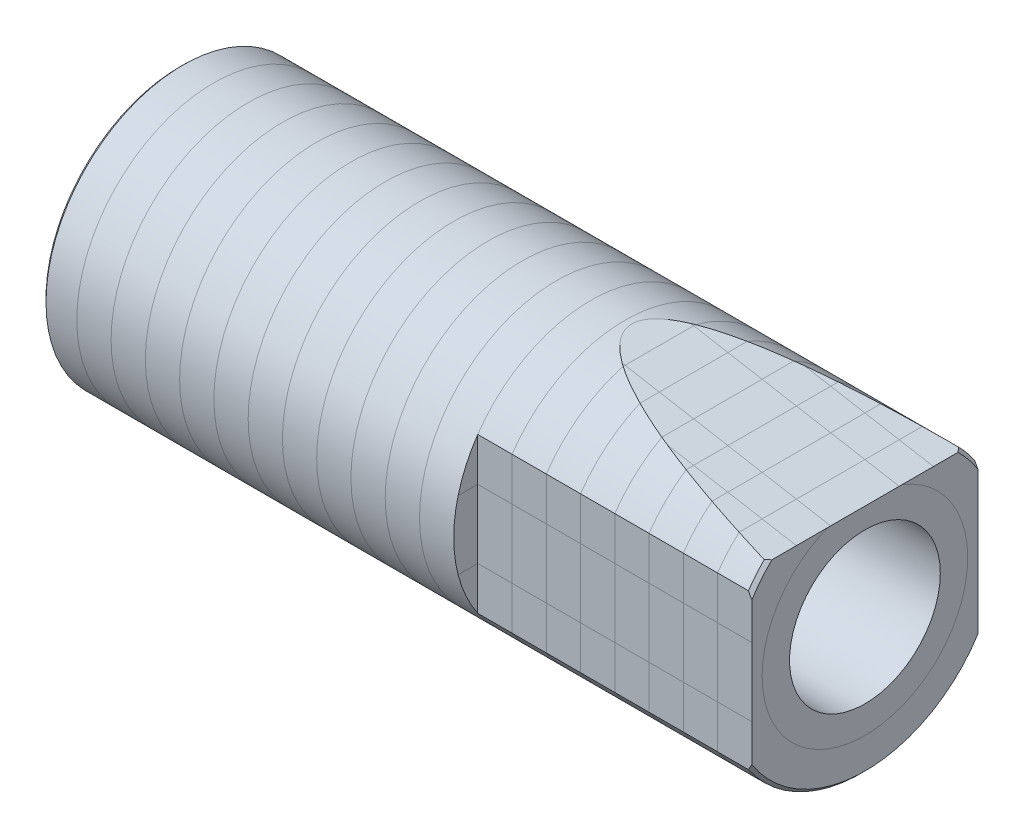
ISO-10303-21;
HEADER;
FILE_DESCRIPTION(('STEP AP214'),'2;1');
FILE_NAME('part.step','',(''),(''),'','','');
FILE_SCHEMA(('AUTOMOTIVE_DESIGN { 1 0 10303 214 1 1 1 1 }'));
ENDSEC;
DATA;
#1=APPLICATION_CONTEXT('core data for automotive mechanical design processes');
#2=APPLICATION_PROTOCOL_DEFINITION('international standard','automotive_design',2000,#1);
#3=PRODUCT_CONTEXT('',#1,'mechanical');
#4=PRODUCT('Part','Part','',(#3));
#5=PRODUCT_RELATED_PRODUCT_CATEGORY('part','',(#4));
#6=PRODUCT_DEFINITION_FORMATION('','',#4);
#7=PRODUCT_DEFINITION_CONTEXT('part definition',#1,'design');
#8=PRODUCT_DEFINITION('design','',#6,#7);
#9=PRODUCT_DEFINITION_SHAPE('','',#8);
#10=(LENGTH_UNIT() NAMED_UNIT(*) SI_UNIT(.MILLI.,.METRE.));
#11=(NAMED_UNIT(*) PLANE_ANGLE_UNIT() SI_UNIT($,.RADIAN.));
#12=(NAMED_UNIT(*) SI_UNIT($,.STERADIAN.) SOLID_ANGLE_UNIT());
#13=UNCERTAINTY_MEASURE_WITH_UNIT(LENGTH_MEASURE(1.E-05),#10,'distance_accuracy_value','');
#14=(GEOMETRIC_REPRESENTATION_CONTEXT(3) GLOBAL_UNCERTAINTY_ASSIGNED_CONTEXT((#13)) GLOBAL_UNIT_ASSIGNED_CONTEXT((#10,
#11,#12)) REPRESENTATION_CONTEXT('',''));
#15=CARTESIAN_POINT('',(0.,0.,0.));
#16=DIRECTION('',(0.,0.,1.));
#17=DIRECTION('',(1.,0.,0.));
#18=AXIS2_PLACEMENT_3D('',#15,#16,#17);
#19=CARTESIAN_POINT('',(10.,2.,0.));
#20=DIRECTION('',(-1.,0.,0.));
#21=DIRECTION('',(0.,0.,1.));
#22=AXIS2_PLACEMENT_3D('',#19,#20,#21);
#23=PLANE('',#22);
#24=CARTESIAN_POINT('',(10.,0.,0.));
#25=DIRECTION('',(-1.,0.,0.));
#26=DIRECTION('',(0.,0.,1.));
#27=AXIS2_PLACEMENT_3D('',#24,#25,#26);
#28=CIRCLE('',#27,1.5);
#29=CARTESIAN_POINT('',(10.,1.39999999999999,0.538516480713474));
#30=VERTEX_POINT('',#29);
#31=CARTESIAN_POINT('',(10.,1.39999999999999,-0.538516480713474));
#32=VERTEX_POINT('',#31);
#33=EDGE_CURVE('E12',#30,#32,#28,.F.);
#34=ORIENTED_EDGE('',*,*,#33,.F.);
#35=DIRECTION('',(0.,0.,1.));
#36=VECTOR('',#35,1.);
#37=CARTESIAN_POINT('',(10.,1.39999999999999,-2.00000000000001));
#38=LINE('',#37,#36);
#39=CARTESIAN_POINT('',(10.,1.39999999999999,1.));
#40=VERTEX_POINT('',#39);
#41=EDGE_CURVE('E1545',#30,#40,#38,.T.);
#42=ORIENTED_EDGE('',*,*,#41,.T.);
#43=CARTESIAN_POINT('',(10.,1.39999999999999,1.35738719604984));
#44=VERTEX_POINT('',#43);
#45=EDGE_CURVE('E1539',#40,#44,#38,.T.);
#46=ORIENTED_EDGE('',*,*,#45,.T.);
#47=CARTESIAN_POINT('',(10.,0.,0.));
#48=DIRECTION('',(-1.,0.,0.));
#49=DIRECTION('',(0.,0.,1.));
#50=AXIS2_PLACEMENT_3D('',#47,#48,#49);
#51=CIRCLE('',#50,1.95);
#52=CARTESIAN_POINT('',(10.,1.03923048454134,1.65));
#53=VERTEX_POINT('',#52);
#54=EDGE_CURVE('E984',#44,#53,#51,.F.);
#55=ORIENTED_EDGE('',*,*,#54,.T.);
#56=DIRECTION('',(0.,1.,0.));
#57=VECTOR('',#56,1.);
#58=CARTESIAN_POINT('',(10.,-2.00000000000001,1.65));
#59=LINE('',#58,#57);
#60=CARTESIAN_POINT('',(10.,0.5,1.65));
#61=VERTEX_POINT('',#60);
#62=EDGE_CURVE('E1122',#61,#53,#59,.T.);
#63=ORIENTED_EDGE('',*,*,#62,.F.);
#64=CARTESIAN_POINT('',(10.,-0.5,1.65));
#65=VERTEX_POINT('',#64);
#66=EDGE_CURVE('E1123',#65,#61,#59,.T.);
#67=ORIENTED_EDGE('',*,*,#66,.F.);
#68=CARTESIAN_POINT('',(10.,-1.03923048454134,1.65));
#69=VERTEX_POINT('',#68);
#70=EDGE_CURVE('E983',#69,#65,#59,.T.);
#71=ORIENTED_EDGE('',*,*,#70,.F.);
#72=CARTESIAN_POINT('',(10.,-1.03923048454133,-1.65));
#73=VERTEX_POINT('',#72);
#74=EDGE_CURVE('E974',#69,#73,#51,.F.);
#75=ORIENTED_EDGE('',*,*,#74,.T.);
#76=DIRECTION('',(0.,1.,0.));
#77=VECTOR('',#76,1.);
#78=CARTESIAN_POINT('',(10.,2.,-1.65));
#79=LINE('',#78,#77);
#80=CARTESIAN_POINT('',(10.,-0.5,-1.65));
#81=VERTEX_POINT('',#80);
#82=EDGE_CURVE('E954',#73,#81,#79,.T.);
#83=ORIENTED_EDGE('',*,*,#82,.T.);
#84=CARTESIAN_POINT('',(10.,0.5,-1.65));
#85=VERTEX_POINT('',#84);
#86=EDGE_CURVE('E967',#81,#85,#79,.T.);
#87=ORIENTED_EDGE('',*,*,#86,.T.);
#88=CARTESIAN_POINT('',(10.,1.03923048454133,-1.65));
#89=VERTEX_POINT('',#88);
#90=EDGE_CURVE('E969',#85,#89,#79,.T.);
#91=ORIENTED_EDGE('',*,*,#90,.T.);
#92=CARTESIAN_POINT('',(10.,1.39999999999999,-1.35738719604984));
#93=VERTEX_POINT('',#92);
#94=EDGE_CURVE('E985',#89,#93,#51,.F.);
#95=ORIENTED_EDGE('',*,*,#94,.T.);
#96=CARTESIAN_POINT('',(10.,1.39999999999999,-1.));
#97=VERTEX_POINT('',#96);
#98=EDGE_CURVE('E1541',#93,#97,#38,.T.);
#99=ORIENTED_EDGE('',*,*,#98,.T.);
#100=EDGE_CURVE('E1544',#97,#32,#38,.T.);
#101=ORIENTED_EDGE('',*,*,#100,.T.);
#102=EDGE_LOOP('',(#34,#42,#46,#55,#63,#67,#71,#75,#83,#87,#91,#95,#99,#101));
#103=FACE_BOUND('',#102,.T.);
#104=ADVANCED_FACE('F459',(#103),#23,.F.);
#105=CARTESIAN_POINT('',(6.,-2.00000000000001,1.65));
#106=DIRECTION('',(-1.,0.,0.));
#107=DIRECTION('',(0.,0.,1.));
#108=AXIS2_PLACEMENT_3D('',#105,#106,#107);
#109=PLANE('',#108);
#110=CARTESIAN_POINT('',(6.,0.,0.));
#111=DIRECTION('',(-1.,0.,0.));
#112=DIRECTION('',(0.,0.,1.));
#113=AXIS2_PLACEMENT_3D('',#110,#111,#112);
#114=CIRCLE('',#113,2.00000000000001);
#115=CARTESIAN_POINT('',(6.,0.5,1.93649167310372));
#116=VERTEX_POINT('',#115);
#117=CARTESIAN_POINT('',(6.,1.13026545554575,1.65));
#118=VERTEX_POINT('',#117);
#119=EDGE_CURVE('E1172',#116,#118,#114,.T.);
#120=ORIENTED_EDGE('',*,*,#119,.F.);
#121=DIRECTION('',(0.,0.,-1.));
#122=VECTOR('',#121,1.);
#123=CARTESIAN_POINT('',(6.,0.5,1.65));
#124=LINE('',#123,#122);
#125=CARTESIAN_POINT('',(6.,0.5,1.65));
#126=VERTEX_POINT('',#125);
#127=EDGE_CURVE('E468',#116,#126,#124,.T.);
#128=ORIENTED_EDGE('',*,*,#127,.T.);
#129=DIRECTION('',(0.,1.,0.));
#130=VECTOR('',#129,1.);
#131=CARTESIAN_POINT('',(6.,-2.00000000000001,1.65));
#132=LINE('',#131,#130);
#133=EDGE_CURVE('E1511',#126,#118,#132,.T.);
#134=ORIENTED_EDGE('',*,*,#133,.T.);
#135=EDGE_LOOP('',(#120,#128,#134));
#136=FACE_BOUND('',#135,.T.);
#137=ADVANCED_FACE('F1050',(#136),#109,.F.);
#138=ORIENTED_EDGE('',*,*,#127,.F.);
#139=CARTESIAN_POINT('',(6.,-0.5,1.93649167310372));
#140=VERTEX_POINT('',#139);
#141=EDGE_CURVE('E1171',#140,#116,#114,.T.);
#142=ORIENTED_EDGE('',*,*,#141,.F.);
#143=DIRECTION('',(0.,0.,-1.));
#144=VECTOR('',#143,1.);
#145=CARTESIAN_POINT('',(6.,-0.5,1.65));
#146=LINE('',#145,#144);
#147=CARTESIAN_POINT('',(6.,-0.5,1.65));
#148=VERTEX_POINT('',#147);
#149=EDGE_CURVE('E1506',#140,#148,#146,.T.);
#150=ORIENTED_EDGE('',*,*,#149,.T.);
#151=EDGE_CURVE('E1521',#148,#126,#132,.T.);
#152=ORIENTED_EDGE('',*,*,#151,.T.);
#153=EDGE_LOOP('',(#138,#142,#150,#152));
#154=FACE_BOUND('',#153,.T.);
#155=ADVANCED_FACE('F1056',(#154),#109,.F.);
#156=CARTESIAN_POINT('',(10.,-2.00000000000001,1.65));
#157=DIRECTION('',(0.,0.,-1.));
#158=DIRECTION('',(-1.,0.,0.));
#159=AXIS2_PLACEMENT_3D('',#156,#157,#158);
#160=PLANE('',#159);
#161=ORIENTED_EDGE('',*,*,#133,.F.);
#162=DIRECTION('',(1.,0.,0.));
#163=VECTOR('',#162,1.);
#164=CARTESIAN_POINT('',(10.,0.5,1.65));
#165=LINE('',#164,#163);
#166=CARTESIAN_POINT('',(6.5,0.5,1.65));
#167=VERTEX_POINT('',#166);
#168=EDGE_CURVE('E1504',#126,#167,#165,.T.);
#169=ORIENTED_EDGE('',*,*,#168,.T.);
#170=DIRECTION('',(0.,1.,0.));
#171=VECTOR('',#170,1.);
#172=CARTESIAN_POINT('',(6.5,-2.00000000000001,1.65));
#173=LINE('',#172,#171);
#174=CARTESIAN_POINT('',(6.5,1.13026545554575,1.65));
#175=VERTEX_POINT('',#174);
#176=EDGE_CURVE('E1177',#167,#175,#173,.T.);
#177=ORIENTED_EDGE('',*,*,#176,.T.);
#178=DIRECTION('',(-1.,0.,0.));
#179=VECTOR('',#178,1.);
#180=CARTESIAN_POINT('',(0.,1.13026545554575,1.65));
#181=LINE('',#180,#179);
#182=EDGE_CURVE('E1528',#118,#175,#181,.F.);
#183=ORIENTED_EDGE('',*,*,#182,.F.);
#184=EDGE_LOOP('',(#161,#169,#177,#183));
#185=FACE_BOUND('',#184,.T.);
#186=ADVANCED_FACE('F1152',(#185),#160,.F.);
#187=ORIENTED_EDGE('',*,*,#168,.F.);
#188=ORIENTED_EDGE('',*,*,#151,.F.);
#189=DIRECTION('',(1.,0.,0.));
#190=VECTOR('',#189,1.);
#191=CARTESIAN_POINT('',(10.,-0.5,1.65));
#192=LINE('',#191,#190);
#193=CARTESIAN_POINT('',(6.5,-0.5,1.65));
#194=VERTEX_POINT('',#193);
#195=EDGE_CURVE('E1502',#148,#194,#192,.T.);
#196=ORIENTED_EDGE('',*,*,#195,.T.);
#197=EDGE_CURVE('E1183',#194,#167,#173,.T.);
#198=ORIENTED_EDGE('',*,*,#197,.T.);
#199=EDGE_LOOP('',(#187,#188,#196,#198));
#200=FACE_BOUND('',#199,.T.);
#201=ADVANCED_FACE('F1520',(#200),#160,.F.);
#202=ORIENTED_EDGE('',*,*,#176,.F.);
#203=DIRECTION('',(1.,0.,0.));
#204=VECTOR('',#203,1.);
#205=CARTESIAN_POINT('',(10.,0.5,1.65));
#206=LINE('',#205,#204);
#207=CARTESIAN_POINT('',(7.,0.5,1.65));
#208=VERTEX_POINT('',#207);
#209=EDGE_CURVE('E1500',#167,#208,#206,.T.);
#210=ORIENTED_EDGE('',*,*,#209,.T.);
#211=DIRECTION('',(0.,1.,0.));
#212=VECTOR('',#211,1.);
#213=CARTESIAN_POINT('',(7.,-2.00000000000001,1.65));
#214=LINE('',#213,#212);
#215=CARTESIAN_POINT('',(7.,1.13026545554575,1.65));
#216=VERTEX_POINT('',#215);
#217=EDGE_CURVE('E1182',#208,#216,#214,.T.);
#218=ORIENTED_EDGE('',*,*,#217,.T.);
#219=EDGE_CURVE('E1535',#175,#216,#181,.F.);
#220=ORIENTED_EDGE('',*,*,#219,.F.);
#221=EDGE_LOOP('',(#202,#210,#218,#220));
#222=FACE_BOUND('',#221,.T.);
#223=ADVANCED_FACE('F2540',(#222),#160,.F.);
#224=ORIENTED_EDGE('',*,*,#209,.F.);
#225=ORIENTED_EDGE('',*,*,#197,.F.);
#226=DIRECTION('',(1.,0.,0.));
#227=VECTOR('',#226,1.);
#228=CARTESIAN_POINT('',(10.,-0.5,1.65));
#229=LINE('',#228,#227);
#230=CARTESIAN_POINT('',(7.,-0.5,1.65));
#231=VERTEX_POINT('',#230);
#232=EDGE_CURVE('E1498',#194,#231,#229,.T.);
#233=ORIENTED_EDGE('',*,*,#232,.T.);
#234=EDGE_CURVE('E1188',#231,#208,#214,.T.);
#235=ORIENTED_EDGE('',*,*,#234,.T.);
#236=EDGE_LOOP('',(#224,#225,#233,#235));
#237=FACE_BOUND('',#236,.T.);
#238=ADVANCED_FACE('F2548',(#237),#160,.F.);
#239=ORIENTED_EDGE('',*,*,#217,.F.);
#240=DIRECTION('',(1.,0.,0.));
#241=VECTOR('',#240,1.);
#242=CARTESIAN_POINT('',(10.,0.5,1.65));
#243=LINE('',#242,#241);
#244=CARTESIAN_POINT('',(7.5,0.5,1.65));
#245=VERTEX_POINT('',#244);
#246=EDGE_CURVE('E1496',#208,#245,#243,.T.);
#247=ORIENTED_EDGE('',*,*,#246,.T.);
#248=DIRECTION('',(0.,1.,0.));
#249=VECTOR('',#248,1.);
#250=CARTESIAN_POINT('',(7.5,-2.00000000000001,1.65));
#251=LINE('',#250,#249);
#252=CARTESIAN_POINT('',(7.5,1.13026545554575,1.65));
#253=VERTEX_POINT('',#252);
#254=EDGE_CURVE('E1187',#245,#253,#251,.T.);
#255=ORIENTED_EDGE('',*,*,#254,.T.);
#256=EDGE_CURVE('E3066',#216,#253,#181,.F.);
#257=ORIENTED_EDGE('',*,*,#256,.F.);
#258=EDGE_LOOP('',(#239,#247,#255,#257));
#259=FACE_BOUND('',#258,.T.);
#260=ADVANCED_FACE('F2557',(#259),#160,.F.);
#261=ORIENTED_EDGE('',*,*,#246,.F.);
#262=ORIENTED_EDGE('',*,*,#234,.F.);
#263=DIRECTION('',(1.,0.,0.));
#264=VECTOR('',#263,1.);
#265=CARTESIAN_POINT('',(10.,-0.5,1.65));
#266=LINE('',#265,#264);
#267=CARTESIAN_POINT('',(7.5,-0.5,1.65));
#268=VERTEX_POINT('',#267);
#269=EDGE_CURVE('E1494',#231,#268,#266,.T.);
#270=ORIENTED_EDGE('',*,*,#269,.T.);
#271=EDGE_CURVE('E1193',#268,#245,#251,.T.);
#272=ORIENTED_EDGE('',*,*,#271,.T.);
#273=EDGE_LOOP('',(#261,#262,#270,#272));
#274=FACE_BOUND('',#273,.T.);
#275=ADVANCED_FACE('F2566',(#274),#160,.F.);
#276=ORIENTED_EDGE('',*,*,#254,.F.);
#277=DIRECTION('',(1.,0.,0.));
#278=VECTOR('',#277,1.);
#279=CARTESIAN_POINT('',(10.,0.5,1.65));
#280=LINE('',#279,#278);
#281=CARTESIAN_POINT('',(8.,0.5,1.65));
#282=VERTEX_POINT('',#281);
#283=EDGE_CURVE('E1492',#245,#282,#280,.T.);
#284=ORIENTED_EDGE('',*,*,#283,.T.);
#285=DIRECTION('',(0.,1.,0.));
#286=VECTOR('',#285,1.);
#287=CARTESIAN_POINT('',(8.,-2.00000000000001,1.65));
#288=LINE('',#287,#286);
#289=CARTESIAN_POINT('',(8.,1.13026545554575,1.65));
#290=VERTEX_POINT('',#289);
#291=EDGE_CURVE('E1192',#282,#290,#288,.T.);
#292=ORIENTED_EDGE('',*,*,#291,.T.);
#293=EDGE_CURVE('E3187',#253,#290,#181,.F.);
#294=ORIENTED_EDGE('',*,*,#293,.F.);
#295=EDGE_LOOP('',(#276,#284,#292,#294));
#296=FACE_BOUND('',#295,.T.);
#297=ADVANCED_FACE('F2575',(#296),#160,.F.);
#298=ORIENTED_EDGE('',*,*,#283,.F.);
#299=ORIENTED_EDGE('',*,*,#271,.F.);
#300=DIRECTION('',(1.,0.,0.));
#301=VECTOR('',#300,1.);
#302=CARTESIAN_POINT('',(10.,-0.5,1.65));
#303=LINE('',#302,#301);
#304=CARTESIAN_POINT('',(8.,-0.5,1.65));
#305=VERTEX_POINT('',#304);
#306=EDGE_CURVE('E1490',#268,#305,#303,.T.);
#307=ORIENTED_EDGE('',*,*,#306,.T.);
#308=EDGE_CURVE('E1198',#305,#282,#288,.T.);
#309=ORIENTED_EDGE('',*,*,#308,.T.);
#310=EDGE_LOOP('',(#298,#299,#307,#309));
#311=FACE_BOUND('',#310,.T.);
#312=ADVANCED_FACE('F2584',(#311),#160,.F.);
#313=ORIENTED_EDGE('',*,*,#291,.F.);
#314=DIRECTION('',(1.,0.,0.));
#315=VECTOR('',#314,1.);
#316=CARTESIAN_POINT('',(10.,0.5,1.65));
#317=LINE('',#316,#315);
#318=CARTESIAN_POINT('',(8.5,0.5,1.65));
#319=VERTEX_POINT('',#318);
#320=EDGE_CURVE('E1488',#282,#319,#317,.T.);
#321=ORIENTED_EDGE('',*,*,#320,.T.);
#322=DIRECTION('',(0.,1.,0.));
#323=VECTOR('',#322,1.);
#324=CARTESIAN_POINT('',(8.5,-2.00000000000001,1.65));
#325=LINE('',#324,#323);
#326=CARTESIAN_POINT('',(8.5,1.13026545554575,1.65));
#327=VERTEX_POINT('',#326);
#328=EDGE_CURVE('E1197',#319,#327,#325,.T.);
#329=ORIENTED_EDGE('',*,*,#328,.T.);
#330=EDGE_CURVE('E3189',#290,#327,#181,.F.);
#331=ORIENTED_EDGE('',*,*,#330,.F.);
#332=EDGE_LOOP('',(#313,#321,#329,#331));
#333=FACE_BOUND('',#332,.T.);
#334=ADVANCED_FACE('F2593',(#333),#160,.F.);
#335=ORIENTED_EDGE('',*,*,#320,.F.);
#336=ORIENTED_EDGE('',*,*,#308,.F.);
#337=DIRECTION('',(1.,0.,0.));
#338=VECTOR('',#337,1.);
#339=CARTESIAN_POINT('',(10.,-0.5,1.65));
#340=LINE('',#339,#338);
#341=CARTESIAN_POINT('',(8.5,-0.5,1.65));
#342=VERTEX_POINT('',#341);
#343=EDGE_CURVE('E1486',#305,#342,#340,.T.);
#344=ORIENTED_EDGE('',*,*,#343,.T.);
#345=EDGE_CURVE('E1203',#342,#319,#325,.T.);
#346=ORIENTED_EDGE('',*,*,#345,.T.);
#347=EDGE_LOOP('',(#335,#336,#344,#346));
#348=FACE_BOUND('',#347,.T.);
#349=ADVANCED_FACE('F2602',(#348),#160,.F.);
#350=ORIENTED_EDGE('',*,*,#328,.F.);
#351=DIRECTION('',(1.,0.,0.));
#352=VECTOR('',#351,1.);
#353=CARTESIAN_POINT('',(10.,0.5,1.65));
#354=LINE('',#353,#352);
#355=CARTESIAN_POINT('',(9.,0.5,1.65));
#356=VERTEX_POINT('',#355);
#357=EDGE_CURVE('E1484',#319,#356,#354,.T.);
#358=ORIENTED_EDGE('',*,*,#357,.T.);
#359=DIRECTION('',(0.,1.,0.));
#360=VECTOR('',#359,1.);
#361=CARTESIAN_POINT('',(9.,-2.00000000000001,1.65));
#362=LINE('',#361,#360);
#363=CARTESIAN_POINT('',(9.,1.13026545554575,1.65));
#364=VERTEX_POINT('',#363);
#365=EDGE_CURVE('E1202',#356,#364,#362,.T.);
#366=ORIENTED_EDGE('',*,*,#365,.T.);
#367=EDGE_CURVE('E3192',#327,#364,#181,.F.);
#368=ORIENTED_EDGE('',*,*,#367,.F.);
#369=EDGE_LOOP('',(#350,#358,#366,#368));
#370=FACE_BOUND('',#369,.T.);
#371=ADVANCED_FACE('F2611',(#370),#160,.F.);
#372=ORIENTED_EDGE('',*,*,#357,.F.);
#373=ORIENTED_EDGE('',*,*,#345,.F.);
#374=DIRECTION('',(1.,0.,0.));
#375=VECTOR('',#374,1.);
#376=CARTESIAN_POINT('',(10.,-0.5,1.65));
#377=LINE('',#376,#375);
#378=CARTESIAN_POINT('',(9.,-0.5,1.65));
#379=VERTEX_POINT('',#378);
#380=EDGE_CURVE('E1482',#342,#379,#377,.T.);
#381=ORIENTED_EDGE('',*,*,#380,.T.);
#382=EDGE_CURVE('E1208',#379,#356,#362,.T.);
#383=ORIENTED_EDGE('',*,*,#382,.T.);
#384=EDGE_LOOP('',(#372,#373,#381,#383));
#385=FACE_BOUND('',#384,.T.);
#386=ADVANCED_FACE('F2620',(#385),#160,.F.);
#387=ORIENTED_EDGE('',*,*,#365,.F.);
#388=DIRECTION('',(1.,0.,0.));
#389=VECTOR('',#388,1.);
#390=CARTESIAN_POINT('',(10.,0.5,1.65));
#391=LINE('',#390,#389);
#392=CARTESIAN_POINT('',(9.5,0.5,1.65));
#393=VERTEX_POINT('',#392);
#394=EDGE_CURVE('E1480',#356,#393,#391,.T.);
#395=ORIENTED_EDGE('',*,*,#394,.T.);
#396=DIRECTION('',(0.,1.,0.));
#397=VECTOR('',#396,1.);
#398=CARTESIAN_POINT('',(9.5,-2.00000000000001,1.65));
#399=LINE('',#398,#397);
#400=CARTESIAN_POINT('',(9.5,1.13026545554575,1.65));
#401=VERTEX_POINT('',#400);
#402=EDGE_CURVE('E1207',#393,#401,#399,.T.);
#403=ORIENTED_EDGE('',*,*,#402,.T.);
#404=EDGE_CURVE('E3196',#364,#401,#181,.F.);
#405=ORIENTED_EDGE('',*,*,#404,.F.);
#406=EDGE_LOOP('',(#387,#395,#403,#405));
#407=FACE_BOUND('',#406,.T.);
#408=ADVANCED_FACE('F2629',(#407),#160,.F.);
#409=ORIENTED_EDGE('',*,*,#394,.F.);
#410=ORIENTED_EDGE('',*,*,#382,.F.);
#411=DIRECTION('',(1.,0.,0.));
#412=VECTOR('',#411,1.);
#413=CARTESIAN_POINT('',(10.,-0.5,1.65));
#414=LINE('',#413,#412);
#415=CARTESIAN_POINT('',(9.5,-0.5,1.65));
#416=VERTEX_POINT('',#415);
#417=EDGE_CURVE('E1478',#379,#416,#414,.T.);
#418=ORIENTED_EDGE('',*,*,#417,.T.);
#419=EDGE_CURVE('E1213',#416,#393,#399,.T.);
#420=ORIENTED_EDGE('',*,*,#419,.T.);
#421=EDGE_LOOP('',(#409,#410,#418,#420));
#422=FACE_BOUND('',#421,.T.);
#423=ADVANCED_FACE('F2638',(#422),#160,.F.);
#424=ORIENTED_EDGE('',*,*,#402,.F.);
#425=DIRECTION('',(1.,0.,0.));
#426=VECTOR('',#425,1.);
#427=CARTESIAN_POINT('',(10.,0.5,1.65));
#428=LINE('',#427,#426);
#429=EDGE_CURVE('E1476',#393,#61,#428,.T.);
#430=ORIENTED_EDGE('',*,*,#429,.T.);
#431=ORIENTED_EDGE('',*,*,#62,.T.);
#432=CARTESIAN_POINT('',(7.90429018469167,-3.69395017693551,1.65));
#433=CARTESIAN_POINT('',(8.00330761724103,-3.58547080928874,1.65));
#434=CARTESIAN_POINT('',(8.10196306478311,-3.47665572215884,1.65));
#435=CARTESIAN_POINT('',(8.29826647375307,-3.25807196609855,1.65));
#436=CARTESIAN_POINT('',(8.39591417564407,-3.1483030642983,1.65));
#437=CARTESIAN_POINT('',(8.59056465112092,-2.92679158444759,1.65));
#438=CARTESIAN_POINT('',(8.68755776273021,-2.81504049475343,1.65));
#439=CARTESIAN_POINT('',(8.87966987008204,-2.58995773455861,1.65));
#440=CARTESIAN_POINT('',(8.97478911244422,-2.47662627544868,1.65));
#441=CARTESIAN_POINT('',(9.14807559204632,-2.26525032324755,1.65));
#442=CARTESIAN_POINT('',(9.22661490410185,-2.16751181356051,1.65));
#443=CARTESIAN_POINT('',(9.3810529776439,-1.96997283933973,1.65));
#444=CARTESIAN_POINT('',(9.45695201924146,-1.87017259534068,1.65));
#445=CARTESIAN_POINT('',(9.60486768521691,-1.66790436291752,1.65));
#446=CARTESIAN_POINT('',(9.67688892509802,-1.56543977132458,1.65));
#447=CARTESIAN_POINT('',(9.81525064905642,-1.3567569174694,1.65));
#448=CARTESIAN_POINT('',(9.88159477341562,-1.25054112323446,1.65));
#449=CARTESIAN_POINT('',(9.97364832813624,-1.08873477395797,1.65));
#450=CARTESIAN_POINT('',(10.0027586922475,-1.03509414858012,1.65));
#451=CARTESIAN_POINT('',(10.0582810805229,-0.926439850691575,1.65));
#452=CARTESIAN_POINT('',(10.0846925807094,-0.871425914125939,1.65));
#453=CARTESIAN_POINT('',(10.1587795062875,-0.704221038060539,1.65));
#454=CARTESIAN_POINT('',(10.201458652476,-0.589613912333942,1.65));
#455=CARTESIAN_POINT('',(10.2468200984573,-0.424737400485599,1.65));
#456=CARTESIAN_POINT('',(10.2581818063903,-0.376822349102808,1.65));
#457=CARTESIAN_POINT('',(10.2770391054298,-0.280245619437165,1.65));
#458=CARTESIAN_POINT('',(10.2845366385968,-0.231584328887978,1.65));
#459=CARTESIAN_POINT('',(10.2952871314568,-0.133888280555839,1.65));
#460=CARTESIAN_POINT('',(10.2985485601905,-0.0848544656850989,1.65));
#461=CARTESIAN_POINT('',(10.3006759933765,0.0133104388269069,1.65));
#462=CARTESIAN_POINT('',(10.2995419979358,0.0624415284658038,1.65));
#463=CARTESIAN_POINT('',(10.292947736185,0.16032328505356,1.65));
#464=CARTESIAN_POINT('',(10.2874948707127,0.209074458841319,1.65));
#465=CARTESIAN_POINT('',(10.2725564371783,0.305956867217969,1.65));
#466=CARTESIAN_POINT('',(10.2630699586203,0.354087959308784,1.65));
#467=CARTESIAN_POINT('',(10.2404697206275,0.449617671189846,1.65));
#468=CARTESIAN_POINT('',(10.2273462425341,0.497013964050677,1.65));
#469=CARTESIAN_POINT('',(10.1979781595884,0.590814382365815,1.65));
#470=CARTESIAN_POINT('',(10.1817336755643,0.637218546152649,1.65));
#471=CARTESIAN_POINT('',(10.1179874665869,0.803910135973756,1.65));
#472=CARTESIAN_POINT('',(10.0627269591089,0.921227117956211,1.65));
#473=CARTESIAN_POINT('',(9.94111797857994,1.15001027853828,1.65));
#474=CARTESIAN_POINT('',(9.8747423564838,1.26146123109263,1.65));
#475=CARTESIAN_POINT('',(9.73440167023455,1.48106408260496,1.65));
#476=CARTESIAN_POINT('',(9.66036484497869,1.58916960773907,1.65));
#477=CARTESIAN_POINT('',(9.50784429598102,1.80197249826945,1.65));
#478=CARTESIAN_POINT('',(9.42936545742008,1.90667341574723,1.65));
#479=CARTESIAN_POINT('',(9.25129511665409,2.13705350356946,1.65));
#480=CARTESIAN_POINT('',(9.15093530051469,2.26213566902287,1.65));
#481=CARTESIAN_POINT('',(8.94716985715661,2.50986430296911,1.65));
#482=CARTESIAN_POINT('',(8.84376293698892,2.63250969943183,1.65));
#483=CARTESIAN_POINT('',(8.63795620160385,2.87242732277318,1.65));
#484=CARTESIAN_POINT('',(8.53561656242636,2.98975136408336,1.65));
#485=CARTESIAN_POINT('',(8.32955924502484,3.22303799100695,1.65));
#486=CARTESIAN_POINT('',(8.22584258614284,3.3390014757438,1.65));
#487=CARTESIAN_POINT('',(8.12165165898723,3.45452616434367,1.65));
#488=B_SPLINE_CURVE_WITH_KNOTS('',3,(#432,#433,#434,#435,#436,#437,#438,#439,#440,#441,#442,
#443,#444,#445,#446,#447,#448,#449,#450,#451,#452,#453,#454,#455,#456,#457,#458,#459,#460,#461,
#462,#463,#464,#465,#466,#467,#468,#469,#470,#471,#472,#473,#474,#475,#476,#477,#478,#479,#480,
#481,#482,#483,#484,#485,#486,#487),.UNSPECIFIED.,.F.,.F.,(4,2,2,2,2,2,2,2,2,2,2,2,2,2,2,2,2,2,
2,2,2,2,2,2,2,2,2,4),(0.,0.44062971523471,0.881370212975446,1.32527467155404,1.76912031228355,
2.14524311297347,2.52132588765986,2.89695066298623,3.27233274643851,3.45535005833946,
3.63840283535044,4.00362727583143,4.1512318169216,4.2987621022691,4.44599698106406,
4.59323185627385,4.74021497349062,4.88723128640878,5.03464430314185,5.18205161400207,
5.56994015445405,5.95879032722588,6.35168517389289,6.74415602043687,7.22518185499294,
7.70641482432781,8.17346127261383,8.6401793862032),.UNSPECIFIED.);
#489=CARTESIAN_POINT('',(9.95,1.13026545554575,1.65));
#490=VERTEX_POINT('',#489);
#491=EDGE_CURVE('E1157',#53,#490,#488,.T.);
#492=ORIENTED_EDGE('',*,*,#491,.T.);
#493=EDGE_CURVE('E1531',#401,#490,#181,.F.);
#494=ORIENTED_EDGE('',*,*,#493,.F.);
#495=EDGE_LOOP('',(#424,#430,#431,#492,#494));
#496=FACE_BOUND('',#495,.T.);
#497=ADVANCED_FACE('F2647',(#496),#160,.F.);
#498=ORIENTED_EDGE('',*,*,#429,.F.);
#499=ORIENTED_EDGE('',*,*,#419,.F.);
#500=DIRECTION('',(1.,0.,0.));
#501=VECTOR('',#500,1.);
#502=CARTESIAN_POINT('',(10.,-0.5,1.65));
#503=LINE('',#502,#501);
#504=EDGE_CURVE('E1474',#416,#65,#503,.T.);
#505=ORIENTED_EDGE('',*,*,#504,.T.);
#506=ORIENTED_EDGE('',*,*,#66,.T.);
#507=EDGE_LOOP('',(#498,#499,#505,#506));
#508=FACE_BOUND('',#507,.T.);
#509=ADVANCED_FACE('F2656',(#508),#160,.F.);
#510=CARTESIAN_POINT('',(6.,-2.00000000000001,-1.65));
#511=DIRECTION('',(-1.,0.,0.));
#512=DIRECTION('',(0.,0.,1.));
#513=AXIS2_PLACEMENT_3D('',#510,#511,#512);
#514=PLANE('',#513);
#515=DIRECTION('',(0.,1.,0.));
#516=VECTOR('',#515,1.);
#517=CARTESIAN_POINT('',(6.,-2.00000000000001,-1.65));
#518=LINE('',#517,#516);
#519=CARTESIAN_POINT('',(6.,0.5,-1.65));
#520=VERTEX_POINT('',#519);
#521=CARTESIAN_POINT('',(6.,1.13026545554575,-1.65));
#522=VERTEX_POINT('',#521);
#523=EDGE_CURVE('E3071',#520,#522,#518,.T.);
#524=ORIENTED_EDGE('',*,*,#523,.F.);
#525=DIRECTION('',(0.,0.,-1.));
#526=VECTOR('',#525,1.);
#527=CARTESIAN_POINT('',(6.,0.5,-1.65));
#528=LINE('',#527,#526);
#529=CARTESIAN_POINT('',(6.,0.5,-1.93649167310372));
#530=VERTEX_POINT('',#529);
#531=EDGE_CURVE('E1472',#520,#530,#528,.T.);
#532=ORIENTED_EDGE('',*,*,#531,.T.);
#533=CARTESIAN_POINT('',(6.,0.,0.));
#534=DIRECTION('',(-1.,0.,0.));
#535=DIRECTION('',(0.,0.,1.));
#536=AXIS2_PLACEMENT_3D('',#533,#534,#535);
#537=CIRCLE('',#536,2.00000000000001);
#538=EDGE_CURVE('E1174',#522,#530,#537,.T.);
#539=ORIENTED_EDGE('',*,*,#538,.F.);
#540=EDGE_LOOP('',(#524,#532,#539));
#541=FACE_BOUND('',#540,.T.);
#542=ADVANCED_FACE('F2665',(#541),#514,.F.);
#543=ORIENTED_EDGE('',*,*,#531,.F.);
#544=CARTESIAN_POINT('',(6.,-0.5,-1.65));
#545=VERTEX_POINT('',#544);
#546=EDGE_CURVE('E3084',#545,#520,#518,.T.);
#547=ORIENTED_EDGE('',*,*,#546,.F.);
#548=DIRECTION('',(0.,0.,-1.));
#549=VECTOR('',#548,1.);
#550=CARTESIAN_POINT('',(6.,-0.5,-1.65));
#551=LINE('',#550,#549);
#552=CARTESIAN_POINT('',(6.,-0.5,-1.93649167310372));
#553=VERTEX_POINT('',#552);
#554=EDGE_CURVE('E1469',#545,#553,#551,.T.);
#555=ORIENTED_EDGE('',*,*,#554,.T.);
#556=EDGE_CURVE('E1178',#530,#553,#537,.T.);
#557=ORIENTED_EDGE('',*,*,#556,.F.);
#558=EDGE_LOOP('',(#543,#547,#555,#557));
#559=FACE_BOUND('',#558,.T.);
#560=ADVANCED_FACE('F2675',(#559),#514,.F.);
#561=CARTESIAN_POINT('',(10.,-2.00000000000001,-1.65));
#562=DIRECTION('',(0.,0.,1.));
#563=DIRECTION('',(1.,0.,0.));
#564=AXIS2_PLACEMENT_3D('',#561,#562,#563);
#565=PLANE('',#564);
#566=DIRECTION('',(0.,-1.,0.));
#567=VECTOR('',#566,1.);
#568=CARTESIAN_POINT('',(6.5,-2.00000000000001,-1.65));
#569=LINE('',#568,#567);
#570=CARTESIAN_POINT('',(6.5,1.13026545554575,-1.65));
#571=VERTEX_POINT('',#570);
#572=CARTESIAN_POINT('',(6.5,0.5,-1.65));
#573=VERTEX_POINT('',#572);
#574=EDGE_CURVE('E1214',#571,#573,#569,.T.);
#575=ORIENTED_EDGE('',*,*,#574,.T.);
#576=DIRECTION('',(-1.,0.,0.));
#577=VECTOR('',#576,1.);
#578=CARTESIAN_POINT('',(10.,0.5,-1.65));
#579=LINE('',#578,#577);
#580=EDGE_CURVE('E1466',#573,#520,#579,.T.);
#581=ORIENTED_EDGE('',*,*,#580,.T.);
#582=ORIENTED_EDGE('',*,*,#523,.T.);
#583=DIRECTION('',(-1.,0.,0.));
#584=VECTOR('',#583,1.);
#585=CARTESIAN_POINT('',(0.,1.13026545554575,-1.65));
#586=LINE('',#585,#584);
#587=EDGE_CURVE('E976',#571,#522,#586,.T.);
#588=ORIENTED_EDGE('',*,*,#587,.F.);
#589=EDGE_LOOP('',(#575,#581,#582,#588));
#590=FACE_BOUND('',#589,.T.);
#591=ADVANCED_FACE('F1141',(#590),#565,.F.);
#592=ORIENTED_EDGE('',*,*,#580,.F.);
#593=CARTESIAN_POINT('',(6.5,-0.5,-1.65));
#594=VERTEX_POINT('',#593);
#595=EDGE_CURVE('E1218',#573,#594,#569,.T.);
#596=ORIENTED_EDGE('',*,*,#595,.T.);
#597=DIRECTION('',(-1.,0.,0.));
#598=VECTOR('',#597,1.);
#599=CARTESIAN_POINT('',(10.,-0.5,-1.65));
#600=LINE('',#599,#598);
#601=EDGE_CURVE('E1463',#594,#545,#600,.T.);
#602=ORIENTED_EDGE('',*,*,#601,.T.);
#603=ORIENTED_EDGE('',*,*,#546,.T.);
#604=EDGE_LOOP('',(#592,#596,#602,#603));
#605=FACE_BOUND('',#604,.T.);
#606=ADVANCED_FACE('F2692',(#605),#565,.F.);
#607=DIRECTION('',(0.,-1.,0.));
#608=VECTOR('',#607,1.);
#609=CARTESIAN_POINT('',(7.,-2.00000000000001,-1.65));
#610=LINE('',#609,#608);
#611=CARTESIAN_POINT('',(7.,1.13026545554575,-1.65));
#612=VERTEX_POINT('',#611);
#613=CARTESIAN_POINT('',(7.,0.5,-1.65));
#614=VERTEX_POINT('',#613);
#615=EDGE_CURVE('E1219',#612,#614,#610,.T.);
#616=ORIENTED_EDGE('',*,*,#615,.T.);
#617=DIRECTION('',(-1.,0.,0.));
#618=VECTOR('',#617,1.);
#619=CARTESIAN_POINT('',(10.,0.5,-1.65));
#620=LINE('',#619,#618);
#621=EDGE_CURVE('E1460',#614,#573,#620,.T.);
#622=ORIENTED_EDGE('',*,*,#621,.T.);
#623=ORIENTED_EDGE('',*,*,#574,.F.);
#624=EDGE_CURVE('E3061',#612,#571,#586,.T.);
#625=ORIENTED_EDGE('',*,*,#624,.F.);
#626=EDGE_LOOP('',(#616,#622,#623,#625));
#627=FACE_BOUND('',#626,.T.);
#628=ADVANCED_FACE('F2701',(#627),#565,.F.);
#629=ORIENTED_EDGE('',*,*,#621,.F.);
#630=CARTESIAN_POINT('',(7.,-0.5,-1.65));
#631=VERTEX_POINT('',#630);
#632=EDGE_CURVE('E1223',#614,#631,#610,.T.);
#633=ORIENTED_EDGE('',*,*,#632,.T.);
#634=DIRECTION('',(-1.,0.,0.));
#635=VECTOR('',#634,1.);
#636=CARTESIAN_POINT('',(10.,-0.5,-1.65));
#637=LINE('',#636,#635);
#638=EDGE_CURVE('E1457',#631,#594,#637,.T.);
#639=ORIENTED_EDGE('',*,*,#638,.T.);
#640=ORIENTED_EDGE('',*,*,#595,.F.);
#641=EDGE_LOOP('',(#629,#633,#639,#640));
#642=FACE_BOUND('',#641,.T.);
#643=ADVANCED_FACE('F2710',(#642),#565,.F.);
#644=DIRECTION('',(0.,-1.,0.));
#645=VECTOR('',#644,1.);
#646=CARTESIAN_POINT('',(7.5,-2.00000000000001,-1.65));
#647=LINE('',#646,#645);
#648=CARTESIAN_POINT('',(7.5,1.13026545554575,-1.65));
#649=VERTEX_POINT('',#648);
#650=CARTESIAN_POINT('',(7.5,0.5,-1.65));
#651=VERTEX_POINT('',#650);
#652=EDGE_CURVE('E1224',#649,#651,#647,.T.);
#653=ORIENTED_EDGE('',*,*,#652,.T.);
#654=DIRECTION('',(-1.,0.,0.));
#655=VECTOR('',#654,1.);
#656=CARTESIAN_POINT('',(10.,0.5,-1.65));
#657=LINE('',#656,#655);
#658=EDGE_CURVE('E1454',#651,#614,#657,.T.);
#659=ORIENTED_EDGE('',*,*,#658,.T.);
#660=ORIENTED_EDGE('',*,*,#615,.F.);
#661=EDGE_CURVE('E3136',#649,#612,#586,.T.);
#662=ORIENTED_EDGE('',*,*,#661,.F.);
#663=EDGE_LOOP('',(#653,#659,#660,#662));
#664=FACE_BOUND('',#663,.T.);
#665=ADVANCED_FACE('F2719',(#664),#565,.F.);
#666=ORIENTED_EDGE('',*,*,#658,.F.);
#667=CARTESIAN_POINT('',(7.5,-0.5,-1.65));
#668=VERTEX_POINT('',#667);
#669=EDGE_CURVE('E1228',#651,#668,#647,.T.);
#670=ORIENTED_EDGE('',*,*,#669,.T.);
#671=DIRECTION('',(-1.,0.,0.));
#672=VECTOR('',#671,1.);
#673=CARTESIAN_POINT('',(10.,-0.5,-1.65));
#674=LINE('',#673,#672);
#675=EDGE_CURVE('E1451',#668,#631,#674,.T.);
#676=ORIENTED_EDGE('',*,*,#675,.T.);
#677=ORIENTED_EDGE('',*,*,#632,.F.);
#678=EDGE_LOOP('',(#666,#670,#676,#677));
#679=FACE_BOUND('',#678,.T.);
#680=ADVANCED_FACE('F2728',(#679),#565,.F.);
#681=DIRECTION('',(0.,-1.,0.));
#682=VECTOR('',#681,1.);
#683=CARTESIAN_POINT('',(8.,-2.00000000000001,-1.65));
#684=LINE('',#683,#682);
#685=CARTESIAN_POINT('',(8.,1.13026545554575,-1.65));
#686=VERTEX_POINT('',#685);
#687=CARTESIAN_POINT('',(8.,0.5,-1.65));
#688=VERTEX_POINT('',#687);
#689=EDGE_CURVE('E1229',#686,#688,#684,.T.);
#690=ORIENTED_EDGE('',*,*,#689,.T.);
#691=DIRECTION('',(-1.,0.,0.));
#692=VECTOR('',#691,1.);
#693=CARTESIAN_POINT('',(10.,0.5,-1.65));
#694=LINE('',#693,#692);
#695=EDGE_CURVE('E1448',#688,#651,#694,.T.);
#696=ORIENTED_EDGE('',*,*,#695,.T.);
#697=ORIENTED_EDGE('',*,*,#652,.F.);
#698=EDGE_CURVE('E3131',#686,#649,#586,.T.);
#699=ORIENTED_EDGE('',*,*,#698,.F.);
#700=EDGE_LOOP('',(#690,#696,#697,#699));
#701=FACE_BOUND('',#700,.T.);
#702=ADVANCED_FACE('F2737',(#701),#565,.F.);
#703=ORIENTED_EDGE('',*,*,#695,.F.);
#704=CARTESIAN_POINT('',(8.,-0.5,-1.65));
#705=VERTEX_POINT('',#704);
#706=EDGE_CURVE('E1233',#688,#705,#684,.T.);
#707=ORIENTED_EDGE('',*,*,#706,.T.);
#708=DIRECTION('',(-1.,0.,0.));
#709=VECTOR('',#708,1.);
#710=CARTESIAN_POINT('',(10.,-0.5,-1.65));
#711=LINE('',#710,#709);
#712=EDGE_CURVE('E1445',#705,#668,#711,.T.);
#713=ORIENTED_EDGE('',*,*,#712,.T.);
#714=ORIENTED_EDGE('',*,*,#669,.F.);
#715=EDGE_LOOP('',(#703,#707,#713,#714));
#716=FACE_BOUND('',#715,.T.);
#717=ADVANCED_FACE('F2746',(#716),#565,.F.);
#718=DIRECTION('',(0.,-1.,0.));
#719=VECTOR('',#718,1.);
#720=CARTESIAN_POINT('',(8.5,-2.00000000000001,-1.65));
#721=LINE('',#720,#719);
#722=CARTESIAN_POINT('',(8.5,1.13026545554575,-1.65));
#723=VERTEX_POINT('',#722);
#724=CARTESIAN_POINT('',(8.5,0.5,-1.65));
#725=VERTEX_POINT('',#724);
#726=EDGE_CURVE('E1234',#723,#725,#721,.T.);
#727=ORIENTED_EDGE('',*,*,#726,.T.);
#728=DIRECTION('',(-1.,0.,0.));
#729=VECTOR('',#728,1.);
#730=CARTESIAN_POINT('',(10.,0.5,-1.65));
#731=LINE('',#730,#729);
#732=EDGE_CURVE('E1442',#725,#688,#731,.T.);
#733=ORIENTED_EDGE('',*,*,#732,.T.);
#734=ORIENTED_EDGE('',*,*,#689,.F.);
#735=EDGE_CURVE('E3127',#723,#686,#586,.T.);
#736=ORIENTED_EDGE('',*,*,#735,.F.);
#737=EDGE_LOOP('',(#727,#733,#734,#736));
#738=FACE_BOUND('',#737,.T.);
#739=ADVANCED_FACE('F2755',(#738),#565,.F.);
#740=ORIENTED_EDGE('',*,*,#732,.F.);
#741=CARTESIAN_POINT('',(8.5,-0.5,-1.65));
#742=VERTEX_POINT('',#741);
#743=EDGE_CURVE('E1238',#725,#742,#721,.T.);
#744=ORIENTED_EDGE('',*,*,#743,.T.);
#745=DIRECTION('',(-1.,0.,0.));
#746=VECTOR('',#745,1.);
#747=CARTESIAN_POINT('',(10.,-0.5,-1.65));
#748=LINE('',#747,#746);
#749=EDGE_CURVE('E1439',#742,#705,#748,.T.);
#750=ORIENTED_EDGE('',*,*,#749,.T.);
#751=ORIENTED_EDGE('',*,*,#706,.F.);
#752=EDGE_LOOP('',(#740,#744,#750,#751));
#753=FACE_BOUND('',#752,.T.);
#754=ADVANCED_FACE('F2764',(#753),#565,.F.);
#755=DIRECTION('',(0.,-1.,0.));
#756=VECTOR('',#755,1.);
#757=CARTESIAN_POINT('',(9.,-2.00000000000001,-1.65));
#758=LINE('',#757,#756);
#759=CARTESIAN_POINT('',(9.,1.13026545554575,-1.65));
#760=VERTEX_POINT('',#759);
#761=CARTESIAN_POINT('',(9.,0.5,-1.65));
#762=VERTEX_POINT('',#761);
#763=EDGE_CURVE('E1239',#760,#762,#758,.T.);
#764=ORIENTED_EDGE('',*,*,#763,.T.);
#765=DIRECTION('',(-1.,0.,0.));
#766=VECTOR('',#765,1.);
#767=CARTESIAN_POINT('',(10.,0.5,-1.65));
#768=LINE('',#767,#766);
#769=EDGE_CURVE('E1436',#762,#725,#768,.T.);
#770=ORIENTED_EDGE('',*,*,#769,.T.);
#771=ORIENTED_EDGE('',*,*,#726,.F.);
#772=EDGE_CURVE('E3125',#760,#723,#586,.T.);
#773=ORIENTED_EDGE('',*,*,#772,.F.);
#774=EDGE_LOOP('',(#764,#770,#771,#773));
#775=FACE_BOUND('',#774,.T.);
#776=ADVANCED_FACE('F2773',(#775),#565,.F.);
#777=ORIENTED_EDGE('',*,*,#769,.F.);
#778=CARTESIAN_POINT('',(9.,-0.5,-1.65));
#779=VERTEX_POINT('',#778);
#780=EDGE_CURVE('E1243',#762,#779,#758,.T.);
#781=ORIENTED_EDGE('',*,*,#780,.T.);
#782=DIRECTION('',(-1.,0.,0.));
#783=VECTOR('',#782,1.);
#784=CARTESIAN_POINT('',(10.,-0.5,-1.65));
#785=LINE('',#784,#783);
#786=EDGE_CURVE('E1433',#779,#742,#785,.T.);
#787=ORIENTED_EDGE('',*,*,#786,.T.);
#788=ORIENTED_EDGE('',*,*,#743,.F.);
#789=EDGE_LOOP('',(#777,#781,#787,#788));
#790=FACE_BOUND('',#789,.T.);
#791=ADVANCED_FACE('F2782',(#790),#565,.F.);
#792=DIRECTION('',(0.,-1.,0.));
#793=VECTOR('',#792,1.);
#794=CARTESIAN_POINT('',(9.5,-2.00000000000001,-1.65));
#795=LINE('',#794,#793);
#796=CARTESIAN_POINT('',(9.5,1.13026545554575,-1.65));
#797=VERTEX_POINT('',#796);
#798=CARTESIAN_POINT('',(9.5,0.5,-1.65));
#799=VERTEX_POINT('',#798);
#800=EDGE_CURVE('E1244',#797,#799,#795,.T.);
#801=ORIENTED_EDGE('',*,*,#800,.T.);
#802=DIRECTION('',(-1.,0.,0.));
#803=VECTOR('',#802,1.);
#804=CARTESIAN_POINT('',(10.,0.5,-1.65));
#805=LINE('',#804,#803);
#806=EDGE_CURVE('E1430',#799,#762,#805,.T.);
#807=ORIENTED_EDGE('',*,*,#806,.T.);
#808=ORIENTED_EDGE('',*,*,#763,.F.);
#809=EDGE_CURVE('E1125',#797,#760,#586,.T.);
#810=ORIENTED_EDGE('',*,*,#809,.F.);
#811=EDGE_LOOP('',(#801,#807,#808,#810));
#812=FACE_BOUND('',#811,.T.);
#813=ADVANCED_FACE('F2791',(#812),#565,.F.);
#814=ORIENTED_EDGE('',*,*,#806,.F.);
#815=CARTESIAN_POINT('',(9.5,-0.5,-1.65));
#816=VERTEX_POINT('',#815);
#817=EDGE_CURVE('E1248',#799,#816,#795,.T.);
#818=ORIENTED_EDGE('',*,*,#817,.T.);
#819=DIRECTION('',(-1.,0.,0.));
#820=VECTOR('',#819,1.);
#821=CARTESIAN_POINT('',(10.,-0.5,-1.65));
#822=LINE('',#821,#820);
#823=EDGE_CURVE('E1427',#816,#779,#822,.T.);
#824=ORIENTED_EDGE('',*,*,#823,.T.);
#825=ORIENTED_EDGE('',*,*,#780,.F.);
#826=EDGE_LOOP('',(#814,#818,#824,#825));
#827=FACE_BOUND('',#826,.T.);
#828=ADVANCED_FACE('F2800',(#827),#565,.F.);
#829=ORIENTED_EDGE('',*,*,#90,.F.);
#830=DIRECTION('',(-1.,0.,0.));
#831=VECTOR('',#830,1.);
#832=CARTESIAN_POINT('',(10.,0.5,-1.65));
#833=LINE('',#832,#831);
#834=EDGE_CURVE('E1424',#85,#799,#833,.T.);
#835=ORIENTED_EDGE('',*,*,#834,.T.);
#836=ORIENTED_EDGE('',*,*,#800,.F.);
#837=CARTESIAN_POINT('',(9.95,1.13026545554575,-1.65));
#838=VERTEX_POINT('',#837);
#839=EDGE_CURVE('E1109',#838,#797,#586,.T.);
#840=ORIENTED_EDGE('',*,*,#839,.F.);
#841=CARTESIAN_POINT('',(8.12165165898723,3.45452616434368,-1.65));
#842=CARTESIAN_POINT('',(8.21253202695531,3.35377931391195,-1.65));
#843=CARTESIAN_POINT('',(8.30303844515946,3.25268943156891,-1.65));
#844=CARTESIAN_POINT('',(8.48302150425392,3.04954375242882,-1.65));
#845=CARTESIAN_POINT('',(8.57249782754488,2.94748767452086,-1.65));
#846=CARTESIAN_POINT('',(8.75095853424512,2.7411788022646,-1.65));
#847=CARTESIAN_POINT('',(8.83992938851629,2.63691427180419,-1.65));
#848=CARTESIAN_POINT('',(9.01596022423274,2.42680672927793,-1.65));
#849=CARTESIAN_POINT('',(9.10302051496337,2.3209639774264,-1.65));
#850=CARTESIAN_POINT('',(9.26577237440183,2.11798794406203,-1.65));
#851=CARTESIAN_POINT('',(9.34172076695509,2.02106144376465,-1.65));
#852=CARTESIAN_POINT('',(9.49058596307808,1.82491243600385,-1.65));
#853=CARTESIAN_POINT('',(9.56350320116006,1.72569026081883,-1.65));
#854=CARTESIAN_POINT('',(9.70479159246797,1.52433944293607,-1.65));
#855=CARTESIAN_POINT('',(9.77317191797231,1.42221729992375,-1.65));
#856=CARTESIAN_POINT('',(9.90323324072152,1.21383151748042,-1.65));
#857=CARTESIAN_POINT('',(9.96492029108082,1.10757174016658,-1.65));
#858=CARTESIAN_POINT('',(10.0745252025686,0.895902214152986,-1.65));
#859=CARTESIAN_POINT('',(10.1230381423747,0.790807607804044,-1.65));
#860=CARTESIAN_POINT('',(10.2054823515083,0.57501325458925,-1.65));
#861=CARTESIAN_POINT('',(10.239455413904,0.464330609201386,-1.65));
#862=CARTESIAN_POINT('',(10.2728691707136,0.304036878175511,-1.65));
#863=CARTESIAN_POINT('',(10.2809134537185,0.256191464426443,-1.65));
#864=CARTESIAN_POINT('',(10.2929449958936,0.160002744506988,-1.65));
#865=CARTESIAN_POINT('',(10.2969341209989,0.111659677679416,-1.65));
#866=CARTESIAN_POINT('',(10.3006411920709,0.0148662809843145,-1.65));
#867=CARTESIAN_POINT('',(10.3003642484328,-0.0335838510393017,-1.65));
#868=CARTESIAN_POINT('',(10.2955701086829,-0.130275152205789,-1.65));
#869=CARTESIAN_POINT('',(10.2910523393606,-0.178516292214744,-1.65));
#870=CARTESIAN_POINT('',(10.2764123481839,-0.286161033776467,-1.65));
#871=CARTESIAN_POINT('',(10.265191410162,-0.345415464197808,-1.65));
#872=CARTESIAN_POINT('',(10.2373167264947,-0.462638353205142,-1.65));
#873=CARTESIAN_POINT('',(10.220659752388,-0.520606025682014,-1.65));
#874=CARTESIAN_POINT('',(10.1827454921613,-0.635324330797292,-1.65));
#875=CARTESIAN_POINT('',(10.1614651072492,-0.69206722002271,-1.65));
#876=CARTESIAN_POINT('',(10.1152430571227,-0.804008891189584,-1.65));
#877=CARTESIAN_POINT('',(10.0903020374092,-0.859207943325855,-1.65));
#878=CARTESIAN_POINT('',(10.0220803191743,-1.00004914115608,-1.65));
#879=CARTESIAN_POINT('',(9.97660257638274,-1.08462188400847,-1.65));
#880=CARTESIAN_POINT('',(9.88057074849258,-1.25085398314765,-1.65));
#881=CARTESIAN_POINT('',(9.83001296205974,-1.33251115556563,-1.65));
#882=CARTESIAN_POINT('',(9.72517858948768,-1.4936807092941,-1.65));
#883=CARTESIAN_POINT('',(9.67089285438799,-1.57318709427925,-1.65));
#884=CARTESIAN_POINT('',(9.55972497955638,-1.73031556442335,-1.65));
#885=CARTESIAN_POINT('',(9.50284358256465,-1.80793817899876,-1.65));
#886=CARTESIAN_POINT('',(9.3868134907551,-1.96214621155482,-1.65));
#887=CARTESIAN_POINT('',(9.32765387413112,-2.0387233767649,-1.65));
#888=CARTESIAN_POINT('',(9.20783362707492,-2.19069671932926,-1.65));
#889=CARTESIAN_POINT('',(9.14717291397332,-2.26609283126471,-1.65));
#890=CARTESIAN_POINT('',(8.96363635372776,-2.49065350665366,-1.65));
#891=CARTESIAN_POINT('',(8.83903864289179,-2.63840864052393,-1.65));
#892=CARTESIAN_POINT('',(8.58006024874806,-2.93941270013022,-1.65));
#893=CARTESIAN_POINT('',(8.44551702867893,-3.09252063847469,-1.65));
#894=CARTESIAN_POINT('',(8.24275863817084,-3.31998343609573,-1.65));
#895=CARTESIAN_POINT('',(8.17535653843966,-3.39506568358,-1.65));
#896=CARTESIAN_POINT('',(8.04012699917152,-3.54480414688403,-1.65));
#897=CARTESIAN_POINT('',(7.97229969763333,-3.61946048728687,-1.65));
#898=CARTESIAN_POINT('',(7.90429018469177,-3.69395017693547,-1.65));
#899=B_SPLINE_CURVE_WITH_KNOTS('',3,(#841,#842,#843,#844,#845,#846,#847,#848,#849,#850,#851,
#852,#853,#854,#855,#856,#857,#858,#859,#860,#861,#862,#863,#864,#865,#866,#867,#868,#869,#870,
#871,#872,#873,#874,#875,#876,#877,#878,#879,#880,#881,#882,#883,#884,#885,#886,#887,#888,#889,
#890,#891,#892,#893,#894,#895,#896,#897,#898),.UNSPECIFIED.,.F.,.F.,(4,2,2,2,2,2,2,2,2,2,2,2,2,
2,2,2,2,2,2,2,2,2,2,2,2,2,2,2,4),(0.,0.407046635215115,0.814215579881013,1.22539555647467,
1.63650847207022,2.00588139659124,2.37520118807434,2.74375001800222,3.11196272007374,
3.45859618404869,3.80422649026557,3.94963004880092,4.09496667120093,4.24012920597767,
4.3853113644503,4.56592649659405,4.74664909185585,4.92829624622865,5.10991140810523,
5.39770818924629,5.68571620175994,5.97445819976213,6.26311808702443,6.55339601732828,
6.84368996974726,7.4234530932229,8.03489669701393,8.33758896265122,8.64018761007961),.UNSPECIFIED.);
#900=EDGE_CURVE('E979',#838,#89,#899,.T.);
#901=ORIENTED_EDGE('',*,*,#900,.T.);
#902=EDGE_LOOP('',(#829,#835,#836,#840,#901));
#903=FACE_BOUND('',#902,.T.);
#904=ADVANCED_FACE('F2809',(#903),#565,.F.);
#905=ORIENTED_EDGE('',*,*,#834,.F.);
#906=ORIENTED_EDGE('',*,*,#86,.F.);
#907=DIRECTION('',(-1.,0.,0.));
#908=VECTOR('',#907,1.);
#909=CARTESIAN_POINT('',(10.,-0.5,-1.65));
#910=LINE('',#909,#908);
#911=EDGE_CURVE('E962',#81,#816,#910,.T.);
#912=ORIENTED_EDGE('',*,*,#911,.T.);
#913=ORIENTED_EDGE('',*,*,#817,.F.);
#914=EDGE_LOOP('',(#905,#906,#912,#913));
#915=FACE_BOUND('',#914,.T.);
#916=ADVANCED_FACE('F2256',(#915),#565,.F.);
#917=CARTESIAN_POINT('',(10.,1.39999999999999,-2.00000000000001));
#918=DIRECTION('',(-0.17364817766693,-0.984807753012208,0.));
#919=DIRECTION('',(0.984807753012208,-0.17364817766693,0.));
#920=AXIS2_PLACEMENT_3D('',#917,#918,#919);
#921=PLANE('',#920);
#922=DIRECTION('',(0.,0.,-1.));
#923=VECTOR('',#922,1.);
#924=CARTESIAN_POINT('',(7.,1.92898094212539,-2.00000000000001));
#925=LINE('',#924,#923);
#926=CARTESIAN_POINT('',(7.,1.92898094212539,0.528235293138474));
#927=VERTEX_POINT('',#926);
#928=CARTESIAN_POINT('',(7.,1.92898094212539,0.5));
#929=VERTEX_POINT('',#928);
#930=EDGE_CURVE('E1249',#927,#929,#925,.T.);
#931=ORIENTED_EDGE('',*,*,#930,.T.);
#932=DIRECTION('',(-0.984807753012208,0.17364817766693,0.));
#933=VECTOR('',#932,1.);
#934=CARTESIAN_POINT('',(10.,1.39999999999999,0.5));
#935=LINE('',#934,#933);
#936=CARTESIAN_POINT('',(6.95740452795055,1.93649167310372,0.5));
#937=VERTEX_POINT('',#936);
#938=EDGE_CURVE('E1421',#929,#937,#935,.T.);
#939=ORIENTED_EDGE('',*,*,#938,.T.);
#940=CARTESIAN_POINT('',(17.9397945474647,0.,0.));
#941=DIRECTION('',(-0.17364817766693,-0.984807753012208,0.));
#942=DIRECTION('',(-0.984807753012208,0.17364817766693,0.));
#943=AXIS2_PLACEMENT_3D('',#940,#941,#942);
#944=ELLIPSE('',#943,11.5175409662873,2.00000000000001);
#945=EDGE_CURVE('E1551',#927,#937,#944,.T.);
#946=ORIENTED_EDGE('',*,*,#945,.F.);
#947=EDGE_LOOP('',(#931,#939,#946));
#948=FACE_BOUND('',#947,.T.);
#949=ADVANCED_FACE('F2251',(#948),#921,.F.);
#950=ORIENTED_EDGE('',*,*,#938,.F.);
#951=CARTESIAN_POINT('',(7.,1.92898094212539,-0.5));
#952=VERTEX_POINT('',#951);
#953=EDGE_CURVE('E1253',#929,#952,#925,.T.);
#954=ORIENTED_EDGE('',*,*,#953,.T.);
#955=DIRECTION('',(-0.984807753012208,0.17364817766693,0.));
#956=VECTOR('',#955,1.);
#957=CARTESIAN_POINT('',(10.,1.39999999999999,-0.5));
#958=LINE('',#957,#956);
#959=CARTESIAN_POINT('',(6.95740452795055,1.93649167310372,-0.5));
#960=VERTEX_POINT('',#959);
#961=EDGE_CURVE('E1418',#952,#960,#958,.T.);
#962=ORIENTED_EDGE('',*,*,#961,.T.);
#963=EDGE_CURVE('E1550',#937,#960,#944,.T.);
#964=ORIENTED_EDGE('',*,*,#963,.F.);
#965=EDGE_LOOP('',(#950,#954,#962,#964));
#966=FACE_BOUND('',#965,.T.);
#967=ADVANCED_FACE('F2255',(#966),#921,.F.);
#968=DIRECTION('',(0.,0.,-1.));
#969=VECTOR('',#968,1.);
#970=CARTESIAN_POINT('',(7.5,1.84081745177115,-2.00000000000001));
#971=LINE('',#970,#969);
#972=CARTESIAN_POINT('',(7.5,1.84081745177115,0.781915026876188));
#973=VERTEX_POINT('',#972);
#974=CARTESIAN_POINT('',(7.5,1.84081745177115,0.5));
#975=VERTEX_POINT('',#974);
#976=EDGE_CURVE('E1254',#973,#975,#971,.T.);
#977=ORIENTED_EDGE('',*,*,#976,.T.);
#978=DIRECTION('',(-0.984807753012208,0.17364817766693,0.));
#979=VECTOR('',#978,1.);
#980=CARTESIAN_POINT('',(10.,1.39999999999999,0.5));
#981=LINE('',#980,#979);
#982=EDGE_CURVE('E1415',#975,#929,#981,.T.);
#983=ORIENTED_EDGE('',*,*,#982,.T.);
#984=ORIENTED_EDGE('',*,*,#930,.F.);
#985=EDGE_CURVE('E3253',#973,#927,#944,.T.);
#986=ORIENTED_EDGE('',*,*,#985,.F.);
#987=EDGE_LOOP('',(#977,#983,#984,#986));
#988=FACE_BOUND('',#987,.T.);
#989=ADVANCED_FACE('F2266',(#988),#921,.F.);
#990=ORIENTED_EDGE('',*,*,#982,.F.);
#991=CARTESIAN_POINT('',(7.5,1.84081745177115,-0.5));
#992=VERTEX_POINT('',#991);
#993=EDGE_CURVE('E1258',#975,#992,#971,.T.);
#994=ORIENTED_EDGE('',*,*,#993,.T.);
#995=DIRECTION('',(-0.984807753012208,0.17364817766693,0.));
#996=VECTOR('',#995,1.);
#997=CARTESIAN_POINT('',(10.,1.39999999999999,-0.5));
#998=LINE('',#997,#996);
#999=EDGE_CURVE('E1412',#992,#952,#998,.T.);
#1000=ORIENTED_EDGE('',*,*,#999,.T.);
#1001=ORIENTED_EDGE('',*,*,#953,.F.);
#1002=EDGE_LOOP('',(#990,#994,#1000,#1001));
#1003=FACE_BOUND('',#1002,.T.);
#1004=ADVANCED_FACE('F2275',(#1003),#921,.F.);
#1005=DIRECTION('',(0.,0.,-1.));
#1006=VECTOR('',#1005,1.);
#1007=CARTESIAN_POINT('',(8.,1.75265396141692,-2.00000000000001));
#1008=LINE('',#1007,#1006);
#1009=CARTESIAN_POINT('',(8.,1.75265396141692,0.963433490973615));
#1010=VERTEX_POINT('',#1009);
#1011=CARTESIAN_POINT('',(8.,1.75265396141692,0.5));
#1012=VERTEX_POINT('',#1011);
#1013=EDGE_CURVE('E1259',#1010,#1012,#1008,.T.);
#1014=ORIENTED_EDGE('',*,*,#1013,.T.);
#1015=DIRECTION('',(-0.984807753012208,0.17364817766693,0.));
#1016=VECTOR('',#1015,1.);
#1017=CARTESIAN_POINT('',(10.,1.39999999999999,0.5));
#1018=LINE('',#1017,#1016);
#1019=EDGE_CURVE('E1409',#1012,#975,#1018,.T.);
#1020=ORIENTED_EDGE('',*,*,#1019,.T.);
#1021=ORIENTED_EDGE('',*,*,#976,.F.);
#1022=EDGE_CURVE('E3228',#1010,#973,#944,.T.);
#1023=ORIENTED_EDGE('',*,*,#1022,.F.);
#1024=EDGE_LOOP('',(#1014,#1020,#1021,#1023));
#1025=FACE_BOUND('',#1024,.T.);
#1026=ADVANCED_FACE('F2284',(#1025),#921,.F.);
#1027=ORIENTED_EDGE('',*,*,#1019,.F.);
#1028=CARTESIAN_POINT('',(8.,1.75265396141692,-0.5));
#1029=VERTEX_POINT('',#1028);
#1030=EDGE_CURVE('E1263',#1012,#1029,#1008,.T.);
#1031=ORIENTED_EDGE('',*,*,#1030,.T.);
#1032=DIRECTION('',(-0.984807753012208,0.17364817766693,0.));
#1033=VECTOR('',#1032,1.);
#1034=CARTESIAN_POINT('',(10.,1.39999999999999,-0.5));
#1035=LINE('',#1034,#1033);
#1036=EDGE_CURVE('E1406',#1029,#992,#1035,.T.);
#1037=ORIENTED_EDGE('',*,*,#1036,.T.);
#1038=ORIENTED_EDGE('',*,*,#993,.F.);
#1039=EDGE_LOOP('',(#1027,#1031,#1037,#1038));
#1040=FACE_BOUND('',#1039,.T.);
#1041=ADVANCED_FACE('F2293',(#1040),#921,.F.);
#1042=DIRECTION('',(0.,0.,-1.));
#1043=VECTOR('',#1042,1.);
#1044=CARTESIAN_POINT('',(8.5,1.66449047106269,-2.00000000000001));
#1045=LINE('',#1044,#1043);
#1046=CARTESIAN_POINT('',(8.5,1.66449047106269,1.));
#1047=VERTEX_POINT('',#1046);
#1048=CARTESIAN_POINT('',(8.5,1.66449047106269,0.5));
#1049=VERTEX_POINT('',#1048);
#1050=EDGE_CURVE('E1268',#1047,#1049,#1045,.T.);
#1051=ORIENTED_EDGE('',*,*,#1050,.T.);
#1052=DIRECTION('',(-0.984807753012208,0.17364817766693,0.));
#1053=VECTOR('',#1052,1.);
#1054=CARTESIAN_POINT('',(10.,1.39999999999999,0.5));
#1055=LINE('',#1054,#1053);
#1056=EDGE_CURVE('E1403',#1049,#1012,#1055,.T.);
#1057=ORIENTED_EDGE('',*,*,#1056,.T.);
#1058=ORIENTED_EDGE('',*,*,#1013,.F.);
#1059=CARTESIAN_POINT('',(8.11684629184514,1.73205080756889,1.));
#1060=VERTEX_POINT('',#1059);
#1061=EDGE_CURVE('E3226',#1060,#1010,#944,.T.);
#1062=ORIENTED_EDGE('',*,*,#1061,.F.);
#1063=DIRECTION('',(-0.984807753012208,0.17364817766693,0.));
#1064=VECTOR('',#1063,1.);
#1065=CARTESIAN_POINT('',(10.,1.39999999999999,1.));
#1066=LINE('',#1065,#1064);
#1067=EDGE_CURVE('E1398',#1047,#1060,#1066,.T.);
#1068=ORIENTED_EDGE('',*,*,#1067,.F.);
#1069=EDGE_LOOP('',(#1051,#1057,#1058,#1062,#1068));
#1070=FACE_BOUND('',#1069,.T.);
#1071=ADVANCED_FACE('F2302',(#1070),#921,.F.);
#1072=ORIENTED_EDGE('',*,*,#1056,.F.);
#1073=CARTESIAN_POINT('',(8.5,1.66449047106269,-0.5));
#1074=VERTEX_POINT('',#1073);
#1075=EDGE_CURVE('E1269',#1049,#1074,#1045,.T.);
#1076=ORIENTED_EDGE('',*,*,#1075,.T.);
#1077=DIRECTION('',(-0.984807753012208,0.17364817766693,0.));
#1078=VECTOR('',#1077,1.);
#1079=CARTESIAN_POINT('',(10.,1.39999999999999,-0.5));
#1080=LINE('',#1079,#1078);
#1081=EDGE_CURVE('E1400',#1074,#1029,#1080,.T.);
#1082=ORIENTED_EDGE('',*,*,#1081,.T.);
#1083=ORIENTED_EDGE('',*,*,#1030,.F.);
#1084=EDGE_LOOP('',(#1072,#1076,#1082,#1083));
#1085=FACE_BOUND('',#1084,.T.);
#1086=ADVANCED_FACE('F2311',(#1085),#921,.F.);
#1087=CARTESIAN_POINT('',(8.5,1.66449047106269,1.1088153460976));
#1088=VERTEX_POINT('',#1087);
#1089=EDGE_CURVE('E1264',#1088,#1047,#1045,.T.);
#1090=ORIENTED_EDGE('',*,*,#1089,.T.);
#1091=ORIENTED_EDGE('',*,*,#1067,.T.);
#1092=EDGE_CURVE('E3219',#1088,#1060,#944,.T.);
#1093=ORIENTED_EDGE('',*,*,#1092,.F.);
#1094=EDGE_LOOP('',(#1090,#1091,#1093));
#1095=FACE_BOUND('',#1094,.T.);
#1096=ADVANCED_FACE('F2320',(#1095),#921,.F.);
#1097=ORIENTED_EDGE('',*,*,#1081,.F.);
#1098=CARTESIAN_POINT('',(8.5,1.66449047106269,-1.));
#1099=VERTEX_POINT('',#1098);
#1100=EDGE_CURVE('E3242',#1074,#1099,#1045,.T.);
#1101=ORIENTED_EDGE('',*,*,#1100,.T.);
#1102=DIRECTION('',(-0.984807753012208,0.17364817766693,0.));
#1103=VECTOR('',#1102,1.);
#1104=CARTESIAN_POINT('',(10.,1.39999999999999,-1.));
#1105=LINE('',#1104,#1103);
#1106=CARTESIAN_POINT('',(8.11684629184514,1.73205080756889,-1.));
#1107=VERTEX_POINT('',#1106);
#1108=EDGE_CURVE('E1396',#1099,#1107,#1105,.T.);
#1109=ORIENTED_EDGE('',*,*,#1108,.T.);
#1110=CARTESIAN_POINT('',(8.,1.75265396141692,-0.963433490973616));
#1111=VERTEX_POINT('',#1110);
#1112=EDGE_CURVE('E3227',#1111,#1107,#944,.T.);
#1113=ORIENTED_EDGE('',*,*,#1112,.F.);
#1114=EDGE_CURVE('E1257',#1029,#1111,#1008,.T.);
#1115=ORIENTED_EDGE('',*,*,#1114,.F.);
#1116=EDGE_LOOP('',(#1097,#1101,#1109,#1113,#1115));
#1117=FACE_BOUND('',#1116,.T.);
#1118=ADVANCED_FACE('F2329',(#1117),#921,.F.);
#1119=DIRECTION('',(0.,0.,-1.));
#1120=VECTOR('',#1119,1.);
#1121=CARTESIAN_POINT('',(9.,1.57632698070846,-2.00000000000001));
#1122=LINE('',#1121,#1120);
#1123=CARTESIAN_POINT('',(9.,1.57632698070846,1.));
#1124=VERTEX_POINT('',#1123);
#1125=CARTESIAN_POINT('',(9.,1.57632698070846,0.5));
#1126=VERTEX_POINT('',#1125);
#1127=EDGE_CURVE('E1274',#1124,#1126,#1122,.T.);
#1128=ORIENTED_EDGE('',*,*,#1127,.T.);
#1129=DIRECTION('',(-0.984807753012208,0.17364817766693,0.));
#1130=VECTOR('',#1129,1.);
#1131=CARTESIAN_POINT('',(10.,1.39999999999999,0.5));
#1132=LINE('',#1131,#1130);
#1133=EDGE_CURVE('E1393',#1126,#1049,#1132,.T.);
#1134=ORIENTED_EDGE('',*,*,#1133,.T.);
#1135=ORIENTED_EDGE('',*,*,#1050,.F.);
#1136=DIRECTION('',(-0.984807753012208,0.17364817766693,0.));
#1137=VECTOR('',#1136,1.);
#1138=CARTESIAN_POINT('',(10.,1.39999999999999,1.));
#1139=LINE('',#1138,#1137);
#1140=EDGE_CURVE('E1387',#1124,#1047,#1139,.T.);
#1141=ORIENTED_EDGE('',*,*,#1140,.F.);
#1142=EDGE_LOOP('',(#1128,#1134,#1135,#1141));
#1143=FACE_BOUND('',#1142,.T.);
#1144=ADVANCED_FACE('F2338',(#1143),#921,.F.);
#1145=ORIENTED_EDGE('',*,*,#1133,.F.);
#1146=CARTESIAN_POINT('',(9.,1.57632698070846,-0.5));
#1147=VERTEX_POINT('',#1146);
#1148=EDGE_CURVE('E1275',#1126,#1147,#1122,.T.);
#1149=ORIENTED_EDGE('',*,*,#1148,.T.);
#1150=DIRECTION('',(-0.984807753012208,0.17364817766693,0.));
#1151=VECTOR('',#1150,1.);
#1152=CARTESIAN_POINT('',(10.,1.39999999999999,-0.5));
#1153=LINE('',#1152,#1151);
#1154=EDGE_CURVE('E1390',#1147,#1074,#1153,.T.);
#1155=ORIENTED_EDGE('',*,*,#1154,.T.);
#1156=ORIENTED_EDGE('',*,*,#1075,.F.);
#1157=EDGE_LOOP('',(#1145,#1149,#1155,#1156));
#1158=FACE_BOUND('',#1157,.T.);
#1159=ADVANCED_FACE('F2347',(#1158),#921,.F.);
#1160=CARTESIAN_POINT('',(9.,1.57632698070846,1.23093186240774));
#1161=VERTEX_POINT('',#1160);
#1162=EDGE_CURVE('E1270',#1161,#1124,#1122,.T.);
#1163=ORIENTED_EDGE('',*,*,#1162,.T.);
#1164=ORIENTED_EDGE('',*,*,#1140,.T.);
#1165=ORIENTED_EDGE('',*,*,#1089,.F.);
#1166=EDGE_CURVE('E3217',#1161,#1088,#944,.T.);
#1167=ORIENTED_EDGE('',*,*,#1166,.F.);
#1168=EDGE_LOOP('',(#1163,#1164,#1165,#1167));
#1169=FACE_BOUND('',#1168,.T.);
#1170=ADVANCED_FACE('F2356',(#1169),#921,.F.);
#1171=ORIENTED_EDGE('',*,*,#1154,.F.);
#1172=CARTESIAN_POINT('',(9.,1.57632698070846,-1.));
#1173=VERTEX_POINT('',#1172);
#1174=EDGE_CURVE('E3236',#1147,#1173,#1122,.T.);
#1175=ORIENTED_EDGE('',*,*,#1174,.T.);
#1176=DIRECTION('',(-0.984807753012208,0.17364817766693,0.));
#1177=VECTOR('',#1176,1.);
#1178=CARTESIAN_POINT('',(10.,1.39999999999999,-1.));
#1179=LINE('',#1178,#1177);
#1180=EDGE_CURVE('E1384',#1173,#1099,#1179,.T.);
#1181=ORIENTED_EDGE('',*,*,#1180,.T.);
#1182=ORIENTED_EDGE('',*,*,#1100,.F.);
#1183=EDGE_LOOP('',(#1171,#1175,#1181,#1182));
#1184=FACE_BOUND('',#1183,.T.);
#1185=ADVANCED_FACE('F2365',(#1184),#921,.F.);
#1186=DIRECTION('',(0.,0.,-1.));
#1187=VECTOR('',#1186,1.);
#1188=CARTESIAN_POINT('',(9.5,1.48816349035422,-2.00000000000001));
#1189=LINE('',#1188,#1187);
#1190=CARTESIAN_POINT('',(9.5,1.48816349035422,1.));
#1191=VERTEX_POINT('',#1190);
#1192=CARTESIAN_POINT('',(9.5,1.48816349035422,0.5));
#1193=VERTEX_POINT('',#1192);
#1194=EDGE_CURVE('E1280',#1191,#1193,#1189,.T.);
#1195=ORIENTED_EDGE('',*,*,#1194,.T.);
#1196=DIRECTION('',(-0.984807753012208,0.17364817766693,0.));
#1197=VECTOR('',#1196,1.);
#1198=CARTESIAN_POINT('',(10.,1.39999999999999,0.5));
#1199=LINE('',#1198,#1197);
#1200=EDGE_CURVE('E1381',#1193,#1126,#1199,.T.);
#1201=ORIENTED_EDGE('',*,*,#1200,.T.);
#1202=ORIENTED_EDGE('',*,*,#1127,.F.);
#1203=DIRECTION('',(-0.984807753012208,0.17364817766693,0.));
#1204=VECTOR('',#1203,1.);
#1205=CARTESIAN_POINT('',(10.,1.39999999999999,1.));
#1206=LINE('',#1205,#1204);
#1207=EDGE_CURVE('E1375',#1191,#1124,#1206,.T.);
#1208=ORIENTED_EDGE('',*,*,#1207,.F.);
#1209=EDGE_LOOP('',(#1195,#1201,#1202,#1208));
#1210=FACE_BOUND('',#1209,.T.);
#1211=ADVANCED_FACE('F2374',(#1210),#921,.F.);
#1212=ORIENTED_EDGE('',*,*,#1200,.F.);
#1213=CARTESIAN_POINT('',(9.5,1.48816349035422,-0.5));
#1214=VERTEX_POINT('',#1213);
#1215=EDGE_CURVE('E1281',#1193,#1214,#1189,.T.);
#1216=ORIENTED_EDGE('',*,*,#1215,.T.);
#1217=DIRECTION('',(-0.984807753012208,0.17364817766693,0.));
#1218=VECTOR('',#1217,1.);
#1219=CARTESIAN_POINT('',(10.,1.39999999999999,-0.5));
#1220=LINE('',#1219,#1218);
#1221=EDGE_CURVE('E1378',#1214,#1147,#1220,.T.);
#1222=ORIENTED_EDGE('',*,*,#1221,.T.);
#1223=ORIENTED_EDGE('',*,*,#1148,.F.);
#1224=EDGE_LOOP('',(#1212,#1216,#1222,#1223));
#1225=FACE_BOUND('',#1224,.T.);
#1226=ADVANCED_FACE('F2383',(#1225),#921,.F.);
#1227=CARTESIAN_POINT('',(9.5,1.48816349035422,1.33617716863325));
#1228=VERTEX_POINT('',#1227);
#1229=EDGE_CURVE('E1276',#1228,#1191,#1189,.T.);
#1230=ORIENTED_EDGE('',*,*,#1229,.T.);
#1231=ORIENTED_EDGE('',*,*,#1207,.T.);
#1232=ORIENTED_EDGE('',*,*,#1162,.F.);
#1233=EDGE_CURVE('E1549',#1228,#1161,#944,.T.);
#1234=ORIENTED_EDGE('',*,*,#1233,.F.);
#1235=EDGE_LOOP('',(#1230,#1231,#1232,#1234));
#1236=FACE_BOUND('',#1235,.T.);
#1237=ADVANCED_FACE('F2392',(#1236),#921,.F.);
#1238=ORIENTED_EDGE('',*,*,#1221,.F.);
#1239=CARTESIAN_POINT('',(9.5,1.48816349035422,-1.));
#1240=VERTEX_POINT('',#1239);
#1241=EDGE_CURVE('E3011',#1214,#1240,#1189,.T.);
#1242=ORIENTED_EDGE('',*,*,#1241,.T.);
#1243=DIRECTION('',(-0.984807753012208,0.17364817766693,0.));
#1244=VECTOR('',#1243,1.);
#1245=CARTESIAN_POINT('',(10.,1.39999999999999,-1.));
#1246=LINE('',#1245,#1244);
#1247=EDGE_CURVE('E1372',#1240,#1173,#1246,.T.);
#1248=ORIENTED_EDGE('',*,*,#1247,.T.);
#1249=ORIENTED_EDGE('',*,*,#1174,.F.);
#1250=EDGE_LOOP('',(#1238,#1242,#1248,#1249));
#1251=FACE_BOUND('',#1250,.T.);
#1252=ADVANCED_FACE('F2401',(#1251),#921,.F.);
#1253=CARTESIAN_POINT('',(10.,1.39999999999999,0.5));
#1254=VERTEX_POINT('',#1253);
#1255=EDGE_CURVE('E1078',#1254,#30,#38,.T.);
#1256=ORIENTED_EDGE('',*,*,#1255,.F.);
#1257=DIRECTION('',(-0.984807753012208,0.17364817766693,0.));
#1258=VECTOR('',#1257,1.);
#1259=CARTESIAN_POINT('',(10.,1.39999999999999,0.5));
#1260=LINE('',#1259,#1258);
#1261=EDGE_CURVE('E1369',#1254,#1193,#1260,.T.);
#1262=ORIENTED_EDGE('',*,*,#1261,.T.);
#1263=ORIENTED_EDGE('',*,*,#1194,.F.);
#1264=DIRECTION('',(-0.984807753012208,0.17364817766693,0.));
#1265=VECTOR('',#1264,1.);
#1266=CARTESIAN_POINT('',(10.,1.39999999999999,1.));
#1267=LINE('',#1266,#1265);
#1268=EDGE_CURVE('E1363',#40,#1191,#1267,.T.);
#1269=ORIENTED_EDGE('',*,*,#1268,.F.);
#1270=ORIENTED_EDGE('',*,*,#41,.F.);
#1271=EDGE_LOOP('',(#1256,#1262,#1263,#1269,#1270));
#1272=FACE_BOUND('',#1271,.T.);
#1273=ADVANCED_FACE('F2410',(#1272),#921,.F.);
#1274=ORIENTED_EDGE('',*,*,#1261,.F.);
#1275=CARTESIAN_POINT('',(10.,1.39999999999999,-0.5));
#1276=VERTEX_POINT('',#1275);
#1277=EDGE_CURVE('E3013',#1276,#1254,#38,.T.);
#1278=ORIENTED_EDGE('',*,*,#1277,.F.);
#1279=DIRECTION('',(-0.984807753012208,0.17364817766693,0.));
#1280=VECTOR('',#1279,1.);
#1281=CARTESIAN_POINT('',(10.,1.39999999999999,-0.5));
#1282=LINE('',#1281,#1280);
#1283=EDGE_CURVE('E1366',#1276,#1214,#1282,.T.);
#1284=ORIENTED_EDGE('',*,*,#1283,.T.);
#1285=ORIENTED_EDGE('',*,*,#1215,.F.);
#1286=EDGE_LOOP('',(#1274,#1278,#1284,#1285));
#1287=FACE_BOUND('',#1286,.T.);
#1288=ADVANCED_FACE('F2417',(#1287),#921,.F.);
#1289=ORIENTED_EDGE('',*,*,#45,.F.);
#1290=ORIENTED_EDGE('',*,*,#1268,.T.);
#1291=ORIENTED_EDGE('',*,*,#1229,.F.);
#1292=CARTESIAN_POINT('',(9.95,1.40881634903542,1.41959025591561));
#1293=VERTEX_POINT('',#1292);
#1294=EDGE_CURVE('E1546',#1293,#1228,#944,.T.);
#1295=ORIENTED_EDGE('',*,*,#1294,.F.);
#1296=CARTESIAN_POINT('',(9.94979999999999,1.40885161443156,1.41983702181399));
#1297=CARTESIAN_POINT('',(9.95824256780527,1.40736296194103,1.40942217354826));
#1298=CARTESIAN_POINT('',(9.9666638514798,1.40587806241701,1.3989896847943));
#1299=CARTESIAN_POINT('',(9.98346385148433,1.40291576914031,1.37808942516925));
#1300=CARTESIAN_POINT('',(9.99184256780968,1.40143837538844,1.36762165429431));
#1301=CARTESIAN_POINT('',(10.0001999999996,1.39996473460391,1.35713624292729));
#1302=B_SPLINE_CURVE_WITH_KNOTS('',3,(#1296,#1297,#1298,#1299,#1300,#1301),.UNSPECIFIED.,.F.,
.F.,(4,2,4),(0.,0.0404677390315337,0.0809354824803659),.UNSPECIFIED.);
#1303=EDGE_CURVE('E1679',#1293,#44,#1302,.T.);
#1304=ORIENTED_EDGE('',*,*,#1303,.T.);
#1305=EDGE_LOOP('',(#1289,#1290,#1291,#1295,#1304));
#1306=FACE_BOUND('',#1305,.T.);
#1307=ADVANCED_FACE('F2422',(#1306),#921,.F.);
#1308=ORIENTED_EDGE('',*,*,#1283,.F.);
#1309=EDGE_CURVE('E3009',#32,#1276,#38,.T.);
#1310=ORIENTED_EDGE('',*,*,#1309,.F.);
#1311=ORIENTED_EDGE('',*,*,#100,.F.);
#1312=DIRECTION('',(-0.984807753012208,0.17364817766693,0.));
#1313=VECTOR('',#1312,1.);
#1314=CARTESIAN_POINT('',(10.,1.39999999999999,-1.));
#1315=LINE('',#1314,#1313);
#1316=EDGE_CURVE('E1360',#97,#1240,#1315,.T.);
#1317=ORIENTED_EDGE('',*,*,#1316,.T.);
#1318=ORIENTED_EDGE('',*,*,#1241,.F.);
#1319=EDGE_LOOP('',(#1308,#1310,#1311,#1317,#1318));
#1320=FACE_BOUND('',#1319,.T.);
#1321=ADVANCED_FACE('F1976',(#1320),#921,.F.);
#1322=CARTESIAN_POINT('',(0.,0.,0.));
#1323=DIRECTION('',(-1.,0.,0.));
#1324=DIRECTION('',(0.,0.,1.));
#1325=AXIS2_PLACEMENT_3D('',#1322,#1323,#1324);
#1326=CYLINDRICAL_SURFACE('',#1325,2.00000000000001);
#1327=DIRECTION('',(-1.,0.,0.));
#1328=VECTOR('',#1327,1.);
#1329=CARTESIAN_POINT('',(0.,-1.13026545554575,-1.65));
#1330=LINE('',#1329,#1328);
#1331=CARTESIAN_POINT('',(9.,-1.13026545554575,-1.65));
#1332=VERTEX_POINT('',#1331);
#1333=CARTESIAN_POINT('',(9.5,-1.13026545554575,-1.65));
#1334=VERTEX_POINT('',#1333);
#1335=EDGE_CURVE('E3085',#1332,#1334,#1330,.F.);
#1336=ORIENTED_EDGE('',*,*,#1335,.T.);
#1337=CARTESIAN_POINT('',(9.5,0.,0.));
#1338=DIRECTION('',(-1.,0.,0.));
#1339=DIRECTION('',(0.,0.,1.));
#1340=AXIS2_PLACEMENT_3D('',#1337,#1338,#1339);
#1341=CIRCLE('',#1340,2.00000000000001);
#1342=CARTESIAN_POINT('',(9.5,-1.13026545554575,1.65));
#1343=VERTEX_POINT('',#1342);
#1344=EDGE_CURVE('E1358',#1334,#1343,#1341,.T.);
#1345=ORIENTED_EDGE('',*,*,#1344,.T.);
#1346=DIRECTION('',(-1.,0.,0.));
#1347=VECTOR('',#1346,1.);
#1348=CARTESIAN_POINT('',(0.,-1.13026545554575,1.65));
#1349=LINE('',#1348,#1347);
#1350=CARTESIAN_POINT('',(9.,-1.13026545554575,1.65));
#1351=VERTEX_POINT('',#1350);
#1352=EDGE_CURVE('E1540',#1343,#1351,#1349,.T.);
#1353=ORIENTED_EDGE('',*,*,#1352,.T.);
#1354=CARTESIAN_POINT('',(9.,0.,0.));
#1355=DIRECTION('',(-1.,0.,0.));
#1356=DIRECTION('',(0.,0.,1.));
#1357=AXIS2_PLACEMENT_3D('',#1354,#1355,#1356);
#1358=CIRCLE('',#1357,2.00000000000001);
#1359=EDGE_CURVE('E1352',#1332,#1351,#1358,.T.);
#1360=ORIENTED_EDGE('',*,*,#1359,.F.);
#1361=EDGE_LOOP('',(#1336,#1345,#1353,#1360));
#1362=FACE_BOUND('',#1361,.T.);
#1363=ADVANCED_FACE('F1073',(#1362),#1326,.T.);
#1364=CARTESIAN_POINT('',(9.,1.57632698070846,-1.23093186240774));
#1365=VERTEX_POINT('',#1364);
#1366=CARTESIAN_POINT('',(9.5,1.48816349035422,-1.33617716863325));
#1367=VERTEX_POINT('',#1366);
#1368=EDGE_CURVE('E3221',#1365,#1367,#944,.T.);
#1369=ORIENTED_EDGE('',*,*,#1368,.T.);
#1370=CARTESIAN_POINT('',(9.5,0.,0.));
#1371=DIRECTION('',(-1.,0.,0.));
#1372=DIRECTION('',(0.,0.,1.));
#1373=AXIS2_PLACEMENT_3D('',#1370,#1371,#1372);
#1374=CIRCLE('',#1373,2.00000000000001);
#1375=EDGE_CURVE('E1356',#1367,#797,#1374,.T.);
#1376=ORIENTED_EDGE('',*,*,#1375,.T.);
#1377=ORIENTED_EDGE('',*,*,#809,.T.);
#1378=CARTESIAN_POINT('',(9.,0.,0.));
#1379=DIRECTION('',(-1.,0.,0.));
#1380=DIRECTION('',(0.,0.,1.));
#1381=AXIS2_PLACEMENT_3D('',#1378,#1379,#1380);
#1382=CIRCLE('',#1381,2.00000000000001);
#1383=EDGE_CURVE('E1350',#1365,#760,#1382,.T.);
#1384=ORIENTED_EDGE('',*,*,#1383,.F.);
#1385=EDGE_LOOP('',(#1369,#1376,#1377,#1384));
#1386=FACE_BOUND('',#1385,.T.);
#1387=ADVANCED_FACE('F1975',(#1386),#1326,.T.);
#1388=ORIENTED_EDGE('',*,*,#404,.T.);
#1389=CARTESIAN_POINT('',(9.5,0.,0.));
#1390=DIRECTION('',(-1.,0.,0.));
#1391=DIRECTION('',(0.,0.,1.));
#1392=AXIS2_PLACEMENT_3D('',#1389,#1390,#1391);
#1393=CIRCLE('',#1392,2.00000000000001);
#1394=EDGE_CURVE('E1354',#401,#1228,#1393,.T.);
#1395=ORIENTED_EDGE('',*,*,#1394,.T.);
#1396=ORIENTED_EDGE('',*,*,#1233,.T.);
#1397=CARTESIAN_POINT('',(9.,0.,0.));
#1398=DIRECTION('',(-1.,0.,0.));
#1399=DIRECTION('',(0.,0.,1.));
#1400=AXIS2_PLACEMENT_3D('',#1397,#1398,#1399);
#1401=CIRCLE('',#1400,2.00000000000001);
#1402=EDGE_CURVE('E1348',#364,#1161,#1401,.T.);
#1403=ORIENTED_EDGE('',*,*,#1402,.F.);
#1404=EDGE_LOOP('',(#1388,#1395,#1396,#1403));
#1405=FACE_BOUND('',#1404,.T.);
#1406=ADVANCED_FACE('F1987',(#1405),#1326,.T.);
#1407=CARTESIAN_POINT('',(8.5,-1.13026545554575,-1.65));
#1408=VERTEX_POINT('',#1407);
#1409=EDGE_CURVE('E3104',#1408,#1332,#1330,.F.);
#1410=ORIENTED_EDGE('',*,*,#1409,.T.);
#1411=ORIENTED_EDGE('',*,*,#1359,.T.);
#1412=CARTESIAN_POINT('',(8.5,-1.13026545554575,1.65));
#1413=VERTEX_POINT('',#1412);
#1414=EDGE_CURVE('E3163',#1351,#1413,#1349,.T.);
#1415=ORIENTED_EDGE('',*,*,#1414,.T.);
#1416=CARTESIAN_POINT('',(8.5,0.,0.));
#1417=DIRECTION('',(-1.,0.,0.));
#1418=DIRECTION('',(0.,0.,1.));
#1419=AXIS2_PLACEMENT_3D('',#1416,#1417,#1418);
#1420=CIRCLE('',#1419,2.00000000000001);
#1421=EDGE_CURVE('E1346',#1408,#1413,#1420,.T.);
#1422=ORIENTED_EDGE('',*,*,#1421,.F.);
#1423=EDGE_LOOP('',(#1410,#1411,#1415,#1422));
#1424=FACE_BOUND('',#1423,.T.);
#1425=ADVANCED_FACE('F1996',(#1424),#1326,.T.);
#1426=CARTESIAN_POINT('',(8.5,1.66449047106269,-1.1088153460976));
#1427=VERTEX_POINT('',#1426);
#1428=EDGE_CURVE('E3220',#1427,#1365,#944,.T.);
#1429=ORIENTED_EDGE('',*,*,#1428,.T.);
#1430=ORIENTED_EDGE('',*,*,#1383,.T.);
#1431=ORIENTED_EDGE('',*,*,#772,.T.);
#1432=CARTESIAN_POINT('',(8.5,0.,0.));
#1433=DIRECTION('',(-1.,0.,0.));
#1434=DIRECTION('',(0.,0.,1.));
#1435=AXIS2_PLACEMENT_3D('',#1432,#1433,#1434);
#1436=CIRCLE('',#1435,2.00000000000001);
#1437=EDGE_CURVE('E1344',#1427,#723,#1436,.T.);
#1438=ORIENTED_EDGE('',*,*,#1437,.F.);
#1439=EDGE_LOOP('',(#1429,#1430,#1431,#1438));
#1440=FACE_BOUND('',#1439,.T.);
#1441=ADVANCED_FACE('F2005',(#1440),#1326,.T.);
#1442=ORIENTED_EDGE('',*,*,#367,.T.);
#1443=ORIENTED_EDGE('',*,*,#1402,.T.);
#1444=ORIENTED_EDGE('',*,*,#1166,.T.);
#1445=CARTESIAN_POINT('',(8.5,0.,0.));
#1446=DIRECTION('',(-1.,0.,0.));
#1447=DIRECTION('',(0.,0.,1.));
#1448=AXIS2_PLACEMENT_3D('',#1445,#1446,#1447);
#1449=CIRCLE('',#1448,2.00000000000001);
#1450=EDGE_CURVE('E1342',#327,#1088,#1449,.T.);
#1451=ORIENTED_EDGE('',*,*,#1450,.F.);
#1452=EDGE_LOOP('',(#1442,#1443,#1444,#1451));
#1453=FACE_BOUND('',#1452,.T.);
#1454=ADVANCED_FACE('F2014',(#1453),#1326,.T.);
#1455=CARTESIAN_POINT('',(8.,-1.13026545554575,-1.65));
#1456=VERTEX_POINT('',#1455);
#1457=EDGE_CURVE('E3100',#1456,#1408,#1330,.F.);
#1458=ORIENTED_EDGE('',*,*,#1457,.T.);
#1459=ORIENTED_EDGE('',*,*,#1421,.T.);
#1460=CARTESIAN_POINT('',(8.,-1.13026545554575,1.65));
#1461=VERTEX_POINT('',#1460);
#1462=EDGE_CURVE('E3157',#1413,#1461,#1349,.T.);
#1463=ORIENTED_EDGE('',*,*,#1462,.T.);
#1464=CARTESIAN_POINT('',(8.,0.,0.));
#1465=DIRECTION('',(-1.,0.,0.));
#1466=DIRECTION('',(0.,0.,1.));
#1467=AXIS2_PLACEMENT_3D('',#1464,#1465,#1466);
#1468=CIRCLE('',#1467,2.00000000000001);
#1469=EDGE_CURVE('E1340',#1456,#1461,#1468,.T.);
#1470=ORIENTED_EDGE('',*,*,#1469,.F.);
#1471=EDGE_LOOP('',(#1458,#1459,#1463,#1470));
#1472=FACE_BOUND('',#1471,.T.);
#1473=ADVANCED_FACE('F2023',(#1472),#1326,.T.);
#1474=ORIENTED_EDGE('',*,*,#1112,.T.);
#1475=EDGE_CURVE('E3229',#1107,#1427,#944,.T.);
#1476=ORIENTED_EDGE('',*,*,#1475,.T.);
#1477=ORIENTED_EDGE('',*,*,#1437,.T.);
#1478=ORIENTED_EDGE('',*,*,#735,.T.);
#1479=CARTESIAN_POINT('',(8.,0.,0.));
#1480=DIRECTION('',(-1.,0.,0.));
#1481=DIRECTION('',(0.,0.,1.));
#1482=AXIS2_PLACEMENT_3D('',#1479,#1480,#1481);
#1483=CIRCLE('',#1482,2.00000000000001);
#1484=EDGE_CURVE('E1338',#1111,#686,#1483,.T.);
#1485=ORIENTED_EDGE('',*,*,#1484,.F.);
#1486=EDGE_LOOP('',(#1474,#1476,#1477,#1478,#1485));
#1487=FACE_BOUND('',#1486,.T.);
#1488=ADVANCED_FACE('F2032',(#1487),#1326,.T.);
#1489=ORIENTED_EDGE('',*,*,#330,.T.);
#1490=ORIENTED_EDGE('',*,*,#1450,.T.);
#1491=ORIENTED_EDGE('',*,*,#1092,.T.);
#1492=ORIENTED_EDGE('',*,*,#1061,.T.);
#1493=CARTESIAN_POINT('',(8.,0.,0.));
#1494=DIRECTION('',(-1.,0.,0.));
#1495=DIRECTION('',(0.,0.,1.));
#1496=AXIS2_PLACEMENT_3D('',#1493,#1494,#1495);
#1497=CIRCLE('',#1496,2.00000000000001);
#1498=EDGE_CURVE('E1335',#290,#1010,#1497,.T.);
#1499=ORIENTED_EDGE('',*,*,#1498,.F.);
#1500=EDGE_LOOP('',(#1489,#1490,#1491,#1492,#1499));
#1501=FACE_BOUND('',#1500,.T.);
#1502=ADVANCED_FACE('F2045',(#1501),#1326,.T.);
#1503=CARTESIAN_POINT('',(7.5,-1.13026545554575,-1.65));
#1504=VERTEX_POINT('',#1503);
#1505=EDGE_CURVE('E3097',#1504,#1456,#1330,.F.);
#1506=ORIENTED_EDGE('',*,*,#1505,.T.);
#1507=ORIENTED_EDGE('',*,*,#1469,.T.);
#1508=CARTESIAN_POINT('',(7.5,-1.13026545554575,1.65));
#1509=VERTEX_POINT('',#1508);
#1510=EDGE_CURVE('E3150',#1461,#1509,#1349,.T.);
#1511=ORIENTED_EDGE('',*,*,#1510,.T.);
#1512=CARTESIAN_POINT('',(7.5,0.,0.));
#1513=DIRECTION('',(-1.,0.,0.));
#1514=DIRECTION('',(0.,0.,1.));
#1515=AXIS2_PLACEMENT_3D('',#1512,#1513,#1514);
#1516=CIRCLE('',#1515,2.00000000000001);
#1517=EDGE_CURVE('E1333',#1504,#1509,#1516,.T.);
#1518=ORIENTED_EDGE('',*,*,#1517,.F.);
#1519=EDGE_LOOP('',(#1506,#1507,#1511,#1518));
#1520=FACE_BOUND('',#1519,.T.);
#1521=ADVANCED_FACE('F2039',(#1520),#1326,.T.);
#1522=CARTESIAN_POINT('',(7.5,1.84081745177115,-0.781915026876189));
#1523=VERTEX_POINT('',#1522);
#1524=EDGE_CURVE('E3232',#1523,#1111,#944,.T.);
#1525=ORIENTED_EDGE('',*,*,#1524,.T.);
#1526=ORIENTED_EDGE('',*,*,#1484,.T.);
#1527=ORIENTED_EDGE('',*,*,#698,.T.);
#1528=CARTESIAN_POINT('',(7.5,0.,0.));
#1529=DIRECTION('',(-1.,0.,0.));
#1530=DIRECTION('',(0.,0.,1.));
#1531=AXIS2_PLACEMENT_3D('',#1528,#1529,#1530);
#1532=CIRCLE('',#1531,2.00000000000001);
#1533=EDGE_CURVE('E1331',#1523,#649,#1532,.T.);
#1534=ORIENTED_EDGE('',*,*,#1533,.F.);
#1535=EDGE_LOOP('',(#1525,#1526,#1527,#1534));
#1536=FACE_BOUND('',#1535,.T.);
#1537=ADVANCED_FACE('F2044',(#1536),#1326,.T.);
#1538=ORIENTED_EDGE('',*,*,#293,.T.);
#1539=ORIENTED_EDGE('',*,*,#1498,.T.);
#1540=ORIENTED_EDGE('',*,*,#1022,.T.);
#1541=CARTESIAN_POINT('',(7.5,0.,0.));
#1542=DIRECTION('',(-1.,0.,0.));
#1543=DIRECTION('',(0.,0.,1.));
#1544=AXIS2_PLACEMENT_3D('',#1541,#1542,#1543);
#1545=CIRCLE('',#1544,2.00000000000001);
#1546=EDGE_CURVE('E1329',#253,#973,#1545,.T.);
#1547=ORIENTED_EDGE('',*,*,#1546,.F.);
#1548=EDGE_LOOP('',(#1538,#1539,#1540,#1547));
#1549=FACE_BOUND('',#1548,.T.);
#1550=ADVANCED_FACE('F2056',(#1549),#1326,.T.);
#1551=CARTESIAN_POINT('',(7.,-1.13026545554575,-1.65));
#1552=VERTEX_POINT('',#1551);
#1553=EDGE_CURVE('E3095',#1552,#1504,#1330,.F.);
#1554=ORIENTED_EDGE('',*,*,#1553,.T.);
#1555=ORIENTED_EDGE('',*,*,#1517,.T.);
#1556=CARTESIAN_POINT('',(7.,-1.13026545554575,1.65));
#1557=VERTEX_POINT('',#1556);
#1558=EDGE_CURVE('E3171',#1509,#1557,#1349,.T.);
#1559=ORIENTED_EDGE('',*,*,#1558,.T.);
#1560=CARTESIAN_POINT('',(7.,0.,0.));
#1561=DIRECTION('',(-1.,0.,0.));
#1562=DIRECTION('',(0.,0.,1.));
#1563=AXIS2_PLACEMENT_3D('',#1560,#1561,#1562);
#1564=CIRCLE('',#1563,2.00000000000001);
#1565=EDGE_CURVE('E1327',#1552,#1557,#1564,.T.);
#1566=ORIENTED_EDGE('',*,*,#1565,.F.);
#1567=EDGE_LOOP('',(#1554,#1555,#1559,#1566));
#1568=FACE_BOUND('',#1567,.T.);
#1569=ADVANCED_FACE('F2065',(#1568),#1326,.T.);
#1570=CARTESIAN_POINT('',(7.,1.92898094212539,-0.528235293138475));
#1571=VERTEX_POINT('',#1570);
#1572=EDGE_CURVE('E3252',#1571,#1523,#944,.T.);
#1573=ORIENTED_EDGE('',*,*,#1572,.T.);
#1574=ORIENTED_EDGE('',*,*,#1533,.T.);
#1575=ORIENTED_EDGE('',*,*,#661,.T.);
#1576=CARTESIAN_POINT('',(7.,0.,0.));
#1577=DIRECTION('',(-1.,0.,0.));
#1578=DIRECTION('',(0.,0.,1.));
#1579=AXIS2_PLACEMENT_3D('',#1576,#1577,#1578);
#1580=CIRCLE('',#1579,2.00000000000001);
#1581=EDGE_CURVE('E1325',#1571,#612,#1580,.T.);
#1582=ORIENTED_EDGE('',*,*,#1581,.F.);
#1583=EDGE_LOOP('',(#1573,#1574,#1575,#1582));
#1584=FACE_BOUND('',#1583,.T.);
#1585=ADVANCED_FACE('F2074',(#1584),#1326,.T.);
#1586=ORIENTED_EDGE('',*,*,#256,.T.);
#1587=ORIENTED_EDGE('',*,*,#1546,.T.);
#1588=ORIENTED_EDGE('',*,*,#985,.T.);
#1589=CARTESIAN_POINT('',(7.,0.,0.));
#1590=DIRECTION('',(-1.,0.,0.));
#1591=DIRECTION('',(0.,0.,1.));
#1592=AXIS2_PLACEMENT_3D('',#1589,#1590,#1591);
#1593=CIRCLE('',#1592,2.00000000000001);
#1594=EDGE_CURVE('E1323',#216,#927,#1593,.T.);
#1595=ORIENTED_EDGE('',*,*,#1594,.F.);
#1596=EDGE_LOOP('',(#1586,#1587,#1588,#1595));
#1597=FACE_BOUND('',#1596,.T.);
#1598=ADVANCED_FACE('F2083',(#1597),#1326,.T.);
#1599=CARTESIAN_POINT('',(6.5,-1.13026545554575,-1.65));
#1600=VERTEX_POINT('',#1599);
#1601=EDGE_CURVE('E3082',#1600,#1552,#1330,.F.);
#1602=ORIENTED_EDGE('',*,*,#1601,.T.);
#1603=ORIENTED_EDGE('',*,*,#1565,.T.);
#1604=CARTESIAN_POINT('',(6.5,-1.13026545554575,1.65));
#1605=VERTEX_POINT('',#1604);
#1606=EDGE_CURVE('E3172',#1557,#1605,#1349,.T.);
#1607=ORIENTED_EDGE('',*,*,#1606,.T.);
#1608=CARTESIAN_POINT('',(6.5,0.,0.));
#1609=DIRECTION('',(-1.,0.,0.));
#1610=DIRECTION('',(0.,0.,1.));
#1611=AXIS2_PLACEMENT_3D('',#1608,#1609,#1610);
#1612=CIRCLE('',#1611,2.00000000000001);
#1613=EDGE_CURVE('E1321',#1600,#1605,#1612,.T.);
#1614=ORIENTED_EDGE('',*,*,#1613,.F.);
#1615=EDGE_LOOP('',(#1602,#1603,#1607,#1614));
#1616=FACE_BOUND('',#1615,.T.);
#1617=ADVANCED_FACE('F2092',(#1616),#1326,.T.);
#1618=ORIENTED_EDGE('',*,*,#945,.T.);
#1619=ORIENTED_EDGE('',*,*,#963,.T.);
#1620=EDGE_CURVE('E3230',#960,#1571,#944,.T.);
#1621=ORIENTED_EDGE('',*,*,#1620,.T.);
#1622=ORIENTED_EDGE('',*,*,#1581,.T.);
#1623=ORIENTED_EDGE('',*,*,#624,.T.);
#1624=CARTESIAN_POINT('',(6.5,0.,0.));
#1625=DIRECTION('',(-1.,0.,0.));
#1626=DIRECTION('',(0.,0.,1.));
#1627=AXIS2_PLACEMENT_3D('',#1624,#1625,#1626);
#1628=CIRCLE('',#1627,2.00000000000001);
#1629=EDGE_CURVE('E1319',#175,#571,#1628,.T.);
#1630=ORIENTED_EDGE('',*,*,#1629,.F.);
#1631=ORIENTED_EDGE('',*,*,#219,.T.);
#1632=ORIENTED_EDGE('',*,*,#1594,.T.);
#1633=EDGE_LOOP('',(#1618,#1619,#1621,#1622,#1623,#1630,#1631,#1632));
#1634=FACE_BOUND('',#1633,.T.);
#1635=ADVANCED_FACE('F2101',(#1634),#1326,.T.);
#1636=ORIENTED_EDGE('',*,*,#1375,.F.);
#1637=CARTESIAN_POINT('',(9.95,1.40881634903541,-1.41959025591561));
#1638=VERTEX_POINT('',#1637);
#1639=EDGE_CURVE('E1111',#1367,#1638,#944,.T.);
#1640=ORIENTED_EDGE('',*,*,#1639,.T.);
#1641=CARTESIAN_POINT('',(9.95,0.,0.));
#1642=DIRECTION('',(-1.,0.,0.));
#1643=DIRECTION('',(0.,0.,1.));
#1644=AXIS2_PLACEMENT_3D('',#1641,#1642,#1643);
#1645=CIRCLE('',#1644,2.00000000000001);
#1646=EDGE_CURVE('E989',#1638,#838,#1645,.T.);
#1647=ORIENTED_EDGE('',*,*,#1646,.T.);
#1648=ORIENTED_EDGE('',*,*,#839,.T.);
#1649=EDGE_LOOP('',(#1636,#1640,#1647,#1648));
#1650=FACE_BOUND('',#1649,.T.);
#1651=ADVANCED_FACE('F1108',(#1650),#1326,.T.);
#1652=CARTESIAN_POINT('',(6.,-1.13026545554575,-1.65));
#1653=VERTEX_POINT('',#1652);
#1654=EDGE_CURVE('E977',#1653,#1600,#1330,.F.);
#1655=ORIENTED_EDGE('',*,*,#1654,.T.);
#1656=ORIENTED_EDGE('',*,*,#1613,.T.);
#1657=CARTESIAN_POINT('',(6.,-1.13026545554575,1.65));
#1658=VERTEX_POINT('',#1657);
#1659=EDGE_CURVE('E1534',#1605,#1658,#1349,.T.);
#1660=ORIENTED_EDGE('',*,*,#1659,.T.);
#1661=CARTESIAN_POINT('',(6.,0.,0.));
#1662=DIRECTION('',(-1.,0.,0.));
#1663=DIRECTION('',(0.,0.,1.));
#1664=AXIS2_PLACEMENT_3D('',#1661,#1662,#1663);
#1665=CIRCLE('',#1664,2.00000000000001);
#1666=EDGE_CURVE('E1317',#1653,#1658,#1665,.T.);
#1667=ORIENTED_EDGE('',*,*,#1666,.F.);
#1668=EDGE_LOOP('',(#1655,#1656,#1660,#1667));
#1669=FACE_BOUND('',#1668,.T.);
#1670=ADVANCED_FACE('F2112',(#1669),#1326,.T.);
#1671=ORIENTED_EDGE('',*,*,#182,.T.);
#1672=ORIENTED_EDGE('',*,*,#1629,.T.);
#1673=ORIENTED_EDGE('',*,*,#587,.T.);
#1674=CARTESIAN_POINT('',(6.,0.,0.));
#1675=DIRECTION('',(-1.,0.,0.));
#1676=DIRECTION('',(0.,0.,1.));
#1677=AXIS2_PLACEMENT_3D('',#1674,#1675,#1676);
#1678=CIRCLE('',#1677,2.00000000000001);
#1679=EDGE_CURVE('E1314',#118,#522,#1678,.T.);
#1680=ORIENTED_EDGE('',*,*,#1679,.F.);
#1681=EDGE_LOOP('',(#1671,#1672,#1673,#1680));
#1682=FACE_BOUND('',#1681,.T.);
#1683=ADVANCED_FACE('F2120',(#1682),#1326,.T.);
#1684=CARTESIAN_POINT('',(5.5,0.,0.));
#1685=DIRECTION('',(-1.,0.,0.));
#1686=DIRECTION('',(0.,0.,1.));
#1687=AXIS2_PLACEMENT_3D('',#1684,#1685,#1686);
#1688=CIRCLE('',#1687,2.00000000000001);
#1689=CARTESIAN_POINT('',(5.5,0.,2.00000000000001));
#1690=VERTEX_POINT('',#1689);
#1691=EDGE_CURVE('E1311',#1690,#1690,#1688,.T.);
#1692=ORIENTED_EDGE('',*,*,#1691,.F.);
#1693=EDGE_LOOP('',(#1692));
#1694=FACE_BOUND('',#1693,.T.);
#1695=ORIENTED_EDGE('',*,*,#538,.T.);
#1696=ORIENTED_EDGE('',*,*,#556,.T.);
#1697=EDGE_CURVE('E966',#553,#1653,#537,.T.);
#1698=ORIENTED_EDGE('',*,*,#1697,.T.);
#1699=ORIENTED_EDGE('',*,*,#1666,.T.);
#1700=EDGE_CURVE('E1169',#1658,#140,#114,.T.);
#1701=ORIENTED_EDGE('',*,*,#1700,.T.);
#1702=ORIENTED_EDGE('',*,*,#141,.T.);
#1703=ORIENTED_EDGE('',*,*,#119,.T.);
#1704=ORIENTED_EDGE('',*,*,#1679,.T.);
#1705=EDGE_LOOP('',(#1695,#1696,#1698,#1699,#1701,#1702,#1703,#1704));
#1706=FACE_BOUND('',#1705,.T.);
#1707=ADVANCED_FACE('F2129',(#1694,#1706),#1326,.T.);
#1708=ORIENTED_EDGE('',*,*,#1344,.F.);
#1709=CARTESIAN_POINT('',(9.95,-1.13026545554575,-1.65));
#1710=VERTEX_POINT('',#1709);
#1711=EDGE_CURVE('E3083',#1334,#1710,#1330,.F.);
#1712=ORIENTED_EDGE('',*,*,#1711,.T.);
#1713=CARTESIAN_POINT('',(9.95,-1.13026545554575,1.65));
#1714=VERTEX_POINT('',#1713);
#1715=EDGE_CURVE('E975',#1710,#1714,#1645,.T.);
#1716=ORIENTED_EDGE('',*,*,#1715,.T.);
#1717=EDGE_CURVE('E1536',#1714,#1343,#1349,.T.);
#1718=ORIENTED_EDGE('',*,*,#1717,.T.);
#1719=EDGE_LOOP('',(#1708,#1712,#1716,#1718));
#1720=FACE_BOUND('',#1719,.T.);
#1721=ADVANCED_FACE('F2136',(#1720),#1326,.T.);
#1722=CARTESIAN_POINT('',(5.,0.,0.));
#1723=DIRECTION('',(-1.,0.,0.));
#1724=DIRECTION('',(0.,0.,1.));
#1725=AXIS2_PLACEMENT_3D('',#1722,#1723,#1724);
#1726=CIRCLE('',#1725,2.00000000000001);
#1727=CARTESIAN_POINT('',(5.,0.,2.00000000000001));
#1728=VERTEX_POINT('',#1727);
#1729=EDGE_CURVE('E1308',#1728,#1728,#1726,.T.);
#1730=ORIENTED_EDGE('',*,*,#1729,.F.);
#1731=EDGE_LOOP('',(#1730));
#1732=FACE_BOUND('',#1731,.T.);
#1733=ORIENTED_EDGE('',*,*,#1691,.T.);
#1734=EDGE_LOOP('',(#1733));
#1735=FACE_BOUND('',#1734,.T.);
#1736=ADVANCED_FACE('F2141',(#1732,#1735),#1326,.T.);
#1737=CARTESIAN_POINT('',(4.5,0.,0.));
#1738=DIRECTION('',(-1.,0.,0.));
#1739=DIRECTION('',(0.,0.,1.));
#1740=AXIS2_PLACEMENT_3D('',#1737,#1738,#1739);
#1741=CIRCLE('',#1740,2.00000000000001);
#1742=CARTESIAN_POINT('',(4.5,0.,2.00000000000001));
#1743=VERTEX_POINT('',#1742);
#1744=EDGE_CURVE('E1305',#1743,#1743,#1741,.T.);
#1745=ORIENTED_EDGE('',*,*,#1744,.F.);
#1746=EDGE_LOOP('',(#1745));
#1747=FACE_BOUND('',#1746,.T.);
#1748=ORIENTED_EDGE('',*,*,#1729,.T.);
#1749=EDGE_LOOP('',(#1748));
#1750=FACE_BOUND('',#1749,.T.);
#1751=ADVANCED_FACE('F2150',(#1747,#1750),#1326,.T.);
#1752=CARTESIAN_POINT('',(4.,0.,0.));
#1753=DIRECTION('',(-1.,0.,0.));
#1754=DIRECTION('',(0.,0.,1.));
#1755=AXIS2_PLACEMENT_3D('',#1752,#1753,#1754);
#1756=CIRCLE('',#1755,2.00000000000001);
#1757=CARTESIAN_POINT('',(4.,0.,2.00000000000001));
#1758=VERTEX_POINT('',#1757);
#1759=EDGE_CURVE('E1302',#1758,#1758,#1756,.T.);
#1760=ORIENTED_EDGE('',*,*,#1759,.F.);
#1761=EDGE_LOOP('',(#1760));
#1762=FACE_BOUND('',#1761,.T.);
#1763=ORIENTED_EDGE('',*,*,#1744,.T.);
#1764=EDGE_LOOP('',(#1763));
#1765=FACE_BOUND('',#1764,.T.);
#1766=ADVANCED_FACE('F2159',(#1762,#1765),#1326,.T.);
#1767=CARTESIAN_POINT('',(3.5,0.,0.));
#1768=DIRECTION('',(-1.,0.,0.));
#1769=DIRECTION('',(0.,0.,1.));
#1770=AXIS2_PLACEMENT_3D('',#1767,#1768,#1769);
#1771=CIRCLE('',#1770,2.00000000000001);
#1772=CARTESIAN_POINT('',(3.5,0.,2.00000000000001));
#1773=VERTEX_POINT('',#1772);
#1774=EDGE_CURVE('E1299',#1773,#1773,#1771,.T.);
#1775=ORIENTED_EDGE('',*,*,#1774,.F.);
#1776=EDGE_LOOP('',(#1775));
#1777=FACE_BOUND('',#1776,.T.);
#1778=ORIENTED_EDGE('',*,*,#1759,.T.);
#1779=EDGE_LOOP('',(#1778));
#1780=FACE_BOUND('',#1779,.T.);
#1781=ADVANCED_FACE('F2168',(#1777,#1780),#1326,.T.);
#1782=CARTESIAN_POINT('',(3.,0.,0.));
#1783=DIRECTION('',(-1.,0.,0.));
#1784=DIRECTION('',(0.,0.,1.));
#1785=AXIS2_PLACEMENT_3D('',#1782,#1783,#1784);
#1786=CIRCLE('',#1785,2.00000000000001);
#1787=CARTESIAN_POINT('',(3.,0.,2.00000000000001));
#1788=VERTEX_POINT('',#1787);
#1789=EDGE_CURVE('E1296',#1788,#1788,#1786,.T.);
#1790=ORIENTED_EDGE('',*,*,#1789,.F.);
#1791=EDGE_LOOP('',(#1790));
#1792=FACE_BOUND('',#1791,.T.);
#1793=ORIENTED_EDGE('',*,*,#1774,.T.);
#1794=EDGE_LOOP('',(#1793));
#1795=FACE_BOUND('',#1794,.T.);
#1796=ADVANCED_FACE('F2177',(#1792,#1795),#1326,.T.);
#1797=CARTESIAN_POINT('',(2.5,0.,0.));
#1798=DIRECTION('',(-1.,0.,0.));
#1799=DIRECTION('',(0.,0.,1.));
#1800=AXIS2_PLACEMENT_3D('',#1797,#1798,#1799);
#1801=CIRCLE('',#1800,2.00000000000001);
#1802=CARTESIAN_POINT('',(2.5,0.,2.00000000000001));
#1803=VERTEX_POINT('',#1802);
#1804=EDGE_CURVE('E1293',#1803,#1803,#1801,.T.);
#1805=ORIENTED_EDGE('',*,*,#1804,.F.);
#1806=EDGE_LOOP('',(#1805));
#1807=FACE_BOUND('',#1806,.T.);
#1808=ORIENTED_EDGE('',*,*,#1789,.T.);
#1809=EDGE_LOOP('',(#1808));
#1810=FACE_BOUND('',#1809,.T.);
#1811=ADVANCED_FACE('F2186',(#1807,#1810),#1326,.T.);
#1812=CARTESIAN_POINT('',(2.,0.,0.));
#1813=DIRECTION('',(-1.,0.,0.));
#1814=DIRECTION('',(0.,0.,1.));
#1815=AXIS2_PLACEMENT_3D('',#1812,#1813,#1814);
#1816=CIRCLE('',#1815,2.00000000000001);
#1817=CARTESIAN_POINT('',(2.,0.,2.00000000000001));
#1818=VERTEX_POINT('',#1817);
#1819=EDGE_CURVE('E1290',#1818,#1818,#1816,.T.);
#1820=ORIENTED_EDGE('',*,*,#1819,.F.);
#1821=EDGE_LOOP('',(#1820));
#1822=FACE_BOUND('',#1821,.T.);
#1823=ORIENTED_EDGE('',*,*,#1804,.T.);
#1824=EDGE_LOOP('',(#1823));
#1825=FACE_BOUND('',#1824,.T.);
#1826=ADVANCED_FACE('F2195',(#1822,#1825),#1326,.T.);
#1827=CARTESIAN_POINT('',(1.5,0.,0.));
#1828=DIRECTION('',(-1.,0.,0.));
#1829=DIRECTION('',(0.,0.,1.));
#1830=AXIS2_PLACEMENT_3D('',#1827,#1828,#1829);
#1831=CIRCLE('',#1830,2.00000000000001);
#1832=CARTESIAN_POINT('',(1.5,0.,2.00000000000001));
#1833=VERTEX_POINT('',#1832);
#1834=EDGE_CURVE('E1287',#1833,#1833,#1831,.T.);
#1835=ORIENTED_EDGE('',*,*,#1834,.F.);
#1836=EDGE_LOOP('',(#1835));
#1837=FACE_BOUND('',#1836,.T.);
#1838=ORIENTED_EDGE('',*,*,#1819,.T.);
#1839=EDGE_LOOP('',(#1838));
#1840=FACE_BOUND('',#1839,.T.);
#1841=ADVANCED_FACE('F2204',(#1837,#1840),#1326,.T.);
#1842=CARTESIAN_POINT('',(1.,0.,0.));
#1843=DIRECTION('',(-1.,0.,0.));
#1844=DIRECTION('',(0.,0.,1.));
#1845=AXIS2_PLACEMENT_3D('',#1842,#1843,#1844);
#1846=CIRCLE('',#1845,2.00000000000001);
#1847=CARTESIAN_POINT('',(1.,0.,2.00000000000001));
#1848=VERTEX_POINT('',#1847);
#1849=EDGE_CURVE('E1284',#1848,#1848,#1846,.T.);
#1850=ORIENTED_EDGE('',*,*,#1849,.F.);
#1851=EDGE_LOOP('',(#1850));
#1852=FACE_BOUND('',#1851,.T.);
#1853=ORIENTED_EDGE('',*,*,#1834,.T.);
#1854=EDGE_LOOP('',(#1853));
#1855=FACE_BOUND('',#1854,.T.);
#1856=ADVANCED_FACE('F2213',(#1852,#1855),#1326,.T.);
#1857=CARTESIAN_POINT('',(0.5,0.,0.));
#1858=DIRECTION('',(-1.,0.,0.));
#1859=DIRECTION('',(0.,0.,1.));
#1860=AXIS2_PLACEMENT_3D('',#1857,#1858,#1859);
#1861=CIRCLE('',#1860,2.00000000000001);
#1862=CARTESIAN_POINT('',(0.5,0.,2.00000000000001));
#1863=VERTEX_POINT('',#1862);
#1864=EDGE_CURVE('E1279',#1863,#1863,#1861,.T.);
#1865=ORIENTED_EDGE('',*,*,#1864,.F.);
#1866=EDGE_LOOP('',(#1865));
#1867=FACE_BOUND('',#1866,.T.);
#1868=ORIENTED_EDGE('',*,*,#1849,.T.);
#1869=EDGE_LOOP('',(#1868));
#1870=FACE_BOUND('',#1869,.T.);
#1871=ADVANCED_FACE('F2222',(#1867,#1870),#1326,.T.);
#1872=CARTESIAN_POINT('',(0.049999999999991,0.,0.));
#1873=DIRECTION('',(1.,0.,0.));
#1874=DIRECTION('',(0.,0.,-1.));
#1875=AXIS2_PLACEMENT_3D('',#1872,#1873,#1874);
#1876=CIRCLE('',#1875,2.00000000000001);
#1877=CARTESIAN_POINT('',(0.049999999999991,0.,-2.00000000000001));
#1878=VERTEX_POINT('',#1877);
#1879=EDGE_CURVE('E1095',#1878,#1878,#1876,.T.);
#1880=ORIENTED_EDGE('',*,*,#1879,.T.);
#1881=EDGE_LOOP('',(#1880));
#1882=FACE_BOUND('',#1881,.T.);
#1883=ORIENTED_EDGE('',*,*,#1864,.T.);
#1884=EDGE_LOOP('',(#1883));
#1885=FACE_BOUND('',#1884,.T.);
#1886=ADVANCED_FACE('F1074',(#1882,#1885),#1326,.T.);
#1887=ORIENTED_EDGE('',*,*,#1247,.F.);
#1888=EDGE_CURVE('E1273',#1240,#1367,#1189,.T.);
#1889=ORIENTED_EDGE('',*,*,#1888,.T.);
#1890=ORIENTED_EDGE('',*,*,#1368,.F.);
#1891=EDGE_CURVE('E1267',#1173,#1365,#1122,.T.);
#1892=ORIENTED_EDGE('',*,*,#1891,.F.);
#1893=EDGE_LOOP('',(#1887,#1889,#1890,#1892));
#1894=FACE_BOUND('',#1893,.T.);
#1895=ADVANCED_FACE('F2239',(#1894),#921,.F.);
#1896=ORIENTED_EDGE('',*,*,#1180,.F.);
#1897=ORIENTED_EDGE('',*,*,#1891,.T.);
#1898=ORIENTED_EDGE('',*,*,#1428,.F.);
#1899=EDGE_CURVE('E1262',#1099,#1427,#1045,.T.);
#1900=ORIENTED_EDGE('',*,*,#1899,.F.);
#1901=EDGE_LOOP('',(#1896,#1897,#1898,#1900));
#1902=FACE_BOUND('',#1901,.T.);
#1903=ADVANCED_FACE('F2457',(#1902),#921,.F.);
#1904=ORIENTED_EDGE('',*,*,#1108,.F.);
#1905=ORIENTED_EDGE('',*,*,#1899,.T.);
#1906=ORIENTED_EDGE('',*,*,#1475,.F.);
#1907=EDGE_LOOP('',(#1904,#1905,#1906));
#1908=FACE_BOUND('',#1907,.T.);
#1909=ADVANCED_FACE('F2466',(#1908),#921,.F.);
#1910=ORIENTED_EDGE('',*,*,#1036,.F.);
#1911=ORIENTED_EDGE('',*,*,#1114,.T.);
#1912=ORIENTED_EDGE('',*,*,#1524,.F.);
#1913=EDGE_CURVE('E1252',#992,#1523,#971,.T.);
#1914=ORIENTED_EDGE('',*,*,#1913,.F.);
#1915=EDGE_LOOP('',(#1910,#1911,#1912,#1914));
#1916=FACE_BOUND('',#1915,.T.);
#1917=ADVANCED_FACE('F2475',(#1916),#921,.F.);
#1918=ORIENTED_EDGE('',*,*,#999,.F.);
#1919=ORIENTED_EDGE('',*,*,#1913,.T.);
#1920=ORIENTED_EDGE('',*,*,#1572,.F.);
#1921=EDGE_CURVE('E1247',#952,#1571,#925,.T.);
#1922=ORIENTED_EDGE('',*,*,#1921,.F.);
#1923=EDGE_LOOP('',(#1918,#1919,#1920,#1922));
#1924=FACE_BOUND('',#1923,.T.);
#1925=ADVANCED_FACE('F2484',(#1924),#921,.F.);
#1926=ORIENTED_EDGE('',*,*,#961,.F.);
#1927=ORIENTED_EDGE('',*,*,#1921,.T.);
#1928=ORIENTED_EDGE('',*,*,#1620,.F.);
#1929=EDGE_LOOP('',(#1926,#1927,#1928));
#1930=FACE_BOUND('',#1929,.T.);
#1931=ADVANCED_FACE('F2493',(#1930),#921,.F.);
#1932=ORIENTED_EDGE('',*,*,#823,.F.);
#1933=EDGE_CURVE('E1242',#816,#1334,#795,.T.);
#1934=ORIENTED_EDGE('',*,*,#1933,.T.);
#1935=ORIENTED_EDGE('',*,*,#1335,.F.);
#1936=EDGE_CURVE('E1237',#779,#1332,#758,.T.);
#1937=ORIENTED_EDGE('',*,*,#1936,.F.);
#1938=EDGE_LOOP('',(#1932,#1934,#1935,#1937));
#1939=FACE_BOUND('',#1938,.T.);
#1940=ADVANCED_FACE('F2502',(#1939),#565,.F.);
#1941=ORIENTED_EDGE('',*,*,#786,.F.);
#1942=ORIENTED_EDGE('',*,*,#1936,.T.);
#1943=ORIENTED_EDGE('',*,*,#1409,.F.);
#1944=EDGE_CURVE('E1232',#742,#1408,#721,.T.);
#1945=ORIENTED_EDGE('',*,*,#1944,.F.);
#1946=EDGE_LOOP('',(#1941,#1942,#1943,#1945));
#1947=FACE_BOUND('',#1946,.T.);
#1948=ADVANCED_FACE('F2837',(#1947),#565,.F.);
#1949=ORIENTED_EDGE('',*,*,#749,.F.);
#1950=ORIENTED_EDGE('',*,*,#1944,.T.);
#1951=ORIENTED_EDGE('',*,*,#1457,.F.);
#1952=EDGE_CURVE('E1227',#705,#1456,#684,.T.);
#1953=ORIENTED_EDGE('',*,*,#1952,.F.);
#1954=EDGE_LOOP('',(#1949,#1950,#1951,#1953));
#1955=FACE_BOUND('',#1954,.T.);
#1956=ADVANCED_FACE('F2846',(#1955),#565,.F.);
#1957=ORIENTED_EDGE('',*,*,#712,.F.);
#1958=ORIENTED_EDGE('',*,*,#1952,.T.);
#1959=ORIENTED_EDGE('',*,*,#1505,.F.);
#1960=EDGE_CURVE('E1222',#668,#1504,#647,.T.);
#1961=ORIENTED_EDGE('',*,*,#1960,.F.);
#1962=EDGE_LOOP('',(#1957,#1958,#1959,#1961));
#1963=FACE_BOUND('',#1962,.T.);
#1964=ADVANCED_FACE('F2855',(#1963),#565,.F.);
#1965=ORIENTED_EDGE('',*,*,#675,.F.);
#1966=ORIENTED_EDGE('',*,*,#1960,.T.);
#1967=ORIENTED_EDGE('',*,*,#1553,.F.);
#1968=EDGE_CURVE('E1217',#631,#1552,#610,.T.);
#1969=ORIENTED_EDGE('',*,*,#1968,.F.);
#1970=EDGE_LOOP('',(#1965,#1966,#1967,#1969));
#1971=FACE_BOUND('',#1970,.T.);
#1972=ADVANCED_FACE('F2864',(#1971),#565,.F.);
#1973=ORIENTED_EDGE('',*,*,#638,.F.);
#1974=ORIENTED_EDGE('',*,*,#1968,.T.);
#1975=ORIENTED_EDGE('',*,*,#1601,.F.);
#1976=EDGE_CURVE('E1212',#594,#1600,#569,.T.);
#1977=ORIENTED_EDGE('',*,*,#1976,.F.);
#1978=EDGE_LOOP('',(#1973,#1974,#1975,#1977));
#1979=FACE_BOUND('',#1978,.T.);
#1980=ADVANCED_FACE('F2873',(#1979),#565,.F.);
#1981=ORIENTED_EDGE('',*,*,#601,.F.);
#1982=ORIENTED_EDGE('',*,*,#1976,.T.);
#1983=ORIENTED_EDGE('',*,*,#1654,.F.);
#1984=EDGE_CURVE('E3079',#1653,#545,#518,.T.);
#1985=ORIENTED_EDGE('',*,*,#1984,.T.);
#1986=EDGE_LOOP('',(#1981,#1982,#1983,#1985));
#1987=FACE_BOUND('',#1986,.T.);
#1988=ADVANCED_FACE('F1142',(#1987),#565,.F.);
#1989=ORIENTED_EDGE('',*,*,#417,.F.);
#1990=EDGE_CURVE('E1204',#1351,#379,#362,.T.);
#1991=ORIENTED_EDGE('',*,*,#1990,.F.);
#1992=ORIENTED_EDGE('',*,*,#1352,.F.);
#1993=EDGE_CURVE('E1209',#1343,#416,#399,.T.);
#1994=ORIENTED_EDGE('',*,*,#1993,.T.);
#1995=EDGE_LOOP('',(#1989,#1991,#1992,#1994));
#1996=FACE_BOUND('',#1995,.T.);
#1997=ADVANCED_FACE('F2667',(#1996),#160,.F.);
#1998=ORIENTED_EDGE('',*,*,#380,.F.);
#1999=EDGE_CURVE('E1199',#1413,#342,#325,.T.);
#2000=ORIENTED_EDGE('',*,*,#1999,.F.);
#2001=ORIENTED_EDGE('',*,*,#1414,.F.);
#2002=ORIENTED_EDGE('',*,*,#1990,.T.);
#2003=EDGE_LOOP('',(#1998,#2000,#2001,#2002));
#2004=FACE_BOUND('',#2003,.T.);
#2005=ADVANCED_FACE('F2898',(#2004),#160,.F.);
#2006=ORIENTED_EDGE('',*,*,#343,.F.);
#2007=EDGE_CURVE('E1194',#1461,#305,#288,.T.);
#2008=ORIENTED_EDGE('',*,*,#2007,.F.);
#2009=ORIENTED_EDGE('',*,*,#1462,.F.);
#2010=ORIENTED_EDGE('',*,*,#1999,.T.);
#2011=EDGE_LOOP('',(#2006,#2008,#2009,#2010));
#2012=FACE_BOUND('',#2011,.T.);
#2013=ADVANCED_FACE('F2907',(#2012),#160,.F.);
#2014=ORIENTED_EDGE('',*,*,#306,.F.);
#2015=EDGE_CURVE('E1189',#1509,#268,#251,.T.);
#2016=ORIENTED_EDGE('',*,*,#2015,.F.);
#2017=ORIENTED_EDGE('',*,*,#1510,.F.);
#2018=ORIENTED_EDGE('',*,*,#2007,.T.);
#2019=EDGE_LOOP('',(#2014,#2016,#2017,#2018));
#2020=FACE_BOUND('',#2019,.T.);
#2021=ADVANCED_FACE('F2916',(#2020),#160,.F.);
#2022=ORIENTED_EDGE('',*,*,#269,.F.);
#2023=EDGE_CURVE('E1184',#1557,#231,#214,.T.);
#2024=ORIENTED_EDGE('',*,*,#2023,.F.);
#2025=ORIENTED_EDGE('',*,*,#1558,.F.);
#2026=ORIENTED_EDGE('',*,*,#2015,.T.);
#2027=EDGE_LOOP('',(#2022,#2024,#2025,#2026));
#2028=FACE_BOUND('',#2027,.T.);
#2029=ADVANCED_FACE('F2925',(#2028),#160,.F.);
#2030=ORIENTED_EDGE('',*,*,#232,.F.);
#2031=EDGE_CURVE('E1179',#1605,#194,#173,.T.);
#2032=ORIENTED_EDGE('',*,*,#2031,.F.);
#2033=ORIENTED_EDGE('',*,*,#1606,.F.);
#2034=ORIENTED_EDGE('',*,*,#2023,.T.);
#2035=EDGE_LOOP('',(#2030,#2032,#2033,#2034));
#2036=FACE_BOUND('',#2035,.T.);
#2037=ADVANCED_FACE('F2934',(#2036),#160,.F.);
#2038=ORIENTED_EDGE('',*,*,#195,.F.);
#2039=EDGE_CURVE('E1529',#1658,#148,#132,.T.);
#2040=ORIENTED_EDGE('',*,*,#2039,.F.);
#2041=ORIENTED_EDGE('',*,*,#1659,.F.);
#2042=ORIENTED_EDGE('',*,*,#2031,.T.);
#2043=EDGE_LOOP('',(#2038,#2040,#2041,#2042));
#2044=FACE_BOUND('',#2043,.T.);
#2045=ADVANCED_FACE('F1153',(#2044),#160,.F.);
#2046=CARTESIAN_POINT('',(9.95,0.,0.));
#2047=DIRECTION('',(-1.,0.,0.));
#2048=DIRECTION('',(0.,0.,1.));
#2049=AXIS2_PLACEMENT_3D('',#2046,#2047,#2048);
#2050=CONICAL_SURFACE('',#2049,2.00000000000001,0.78539816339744);
#2051=ORIENTED_EDGE('',*,*,#900,.F.);
#2052=ORIENTED_EDGE('',*,*,#1646,.F.);
#2053=CARTESIAN_POINT('',(10.0001999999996,1.39996473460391,-1.35713624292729));
#2054=CARTESIAN_POINT('',(9.99184256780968,1.40143837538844,-1.36762165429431));
#2055=CARTESIAN_POINT('',(9.98346385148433,1.40291576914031,-1.37808942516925));
#2056=CARTESIAN_POINT('',(9.9666638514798,1.40587806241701,-1.3989896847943));
#2057=CARTESIAN_POINT('',(9.95824256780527,1.40736296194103,-1.40942217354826));
#2058=CARTESIAN_POINT('',(9.94979999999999,1.40885161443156,-1.41983702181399));
#2059=B_SPLINE_CURVE_WITH_KNOTS('',3,(#2053,#2054,#2055,#2056,#2057,#2058),.UNSPECIFIED.,.F.,
.F.,(4,2,4),(0.,0.0404677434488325,0.0809354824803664),.UNSPECIFIED.);
#2060=EDGE_CURVE('E1118',#93,#1638,#2059,.T.);
#2061=ORIENTED_EDGE('',*,*,#2060,.F.);
#2062=ORIENTED_EDGE('',*,*,#94,.F.);
#2063=EDGE_LOOP('',(#2051,#2052,#2061,#2062));
#2064=FACE_BOUND('',#2063,.T.);
#2065=ADVANCED_FACE('F1116',(#2064),#2050,.T.);
#2066=EDGE_CURVE('E958',#73,#1710,#899,.T.);
#2067=ORIENTED_EDGE('',*,*,#2066,.F.);
#2068=ORIENTED_EDGE('',*,*,#74,.F.);
#2069=EDGE_CURVE('E1164',#1714,#69,#488,.T.);
#2070=ORIENTED_EDGE('',*,*,#2069,.F.);
#2071=ORIENTED_EDGE('',*,*,#1715,.F.);
#2072=EDGE_LOOP('',(#2067,#2068,#2070,#2071));
#2073=FACE_BOUND('',#2072,.T.);
#2074=ADVANCED_FACE('F972',(#2073),#2050,.T.);
#2075=CARTESIAN_POINT('',(0.,0.,0.));
#2076=DIRECTION('',(1.,0.,0.));
#2077=DIRECTION('',(0.,0.,-1.));
#2078=AXIS2_PLACEMENT_3D('',#2075,#2076,#2077);
#2079=PLANE('',#2078);
#2080=CARTESIAN_POINT('',(0.,0.,0.));
#2081=DIRECTION('',(1.,0.,0.));
#2082=DIRECTION('',(0.,0.,-1.));
#2083=AXIS2_PLACEMENT_3D('',#2080,#2081,#2082);
#2084=CIRCLE('',#2083,1.95000000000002);
#2085=CARTESIAN_POINT('',(0.,0.,-1.95000000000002));
#2086=VERTEX_POINT('',#2085);
#2087=EDGE_CURVE('E988',#2086,#2086,#2084,.F.);
#2088=ORIENTED_EDGE('',*,*,#2087,.T.);
#2089=EDGE_LOOP('',(#2088));
#2090=FACE_BOUND('',#2089,.T.);
#2091=CARTESIAN_POINT('',(0.,0.,0.));
#2092=DIRECTION('',(1.,0.,0.));
#2093=DIRECTION('',(0.,0.,-1.));
#2094=AXIS2_PLACEMENT_3D('',#2091,#2092,#2093);
#2095=CIRCLE('',#2094,1.85);
#2096=CARTESIAN_POINT('',(0.,0.,-1.85));
#2097=VERTEX_POINT('',#2096);
#2098=EDGE_CURVE('E1628',#2097,#2097,#2095,.T.);
#2099=ORIENTED_EDGE('',*,*,#2098,.T.);
#2100=EDGE_LOOP('',(#2099));
#2101=FACE_BOUND('',#2100,.T.);
#2102=ADVANCED_FACE('F1071',(#2090,#2101),#2079,.F.);
#2103=ORIENTED_EDGE('',*,*,#1394,.F.);
#2104=ORIENTED_EDGE('',*,*,#493,.T.);
#2105=EDGE_CURVE('E1097',#490,#1293,#1645,.T.);
#2106=ORIENTED_EDGE('',*,*,#2105,.T.);
#2107=ORIENTED_EDGE('',*,*,#1294,.T.);
#2108=EDGE_LOOP('',(#2103,#2104,#2106,#2107));
#2109=FACE_BOUND('',#2108,.T.);
#2110=ADVANCED_FACE('F1064',(#2109),#1326,.T.);
#2111=ORIENTED_EDGE('',*,*,#1255,.T.);
#2112=ORIENTED_EDGE('',*,*,#33,.T.);
#2113=ORIENTED_EDGE('',*,*,#1309,.T.);
#2114=ORIENTED_EDGE('',*,*,#1277,.T.);
#2115=EDGE_LOOP('',(#2111,#2112,#2113,#2114));
#2116=FACE_BOUND('',#2115,.T.);
#2117=CARTESIAN_POINT('',(10.,0.,0.));
#2118=DIRECTION('',(1.,0.,0.));
#2119=DIRECTION('',(0.,0.,-1.));
#2120=AXIS2_PLACEMENT_3D('',#2117,#2118,#2119);
#2121=CIRCLE('',#2120,1.1);
#2122=CARTESIAN_POINT('',(10.,0.,-1.1));
#2123=VERTEX_POINT('',#2122);
#2124=EDGE_CURVE('E1081',#2123,#2123,#2121,.T.);
#2125=ORIENTED_EDGE('',*,*,#2124,.F.);
#2126=EDGE_LOOP('',(#2125));
#2127=FACE_BOUND('',#2126,.T.);
#2128=ADVANCED_FACE('F1052',(#2116,#2127),#23,.F.);
#2129=CARTESIAN_POINT('',(0.,0.,0.));
#2130=DIRECTION('',(1.,0.,0.));
#2131=DIRECTION('',(0.,0.,-1.));
#2132=AXIS2_PLACEMENT_3D('',#2129,#2130,#2131);
#2133=CYLINDRICAL_SURFACE('',#2132,1.1);
#2134=CARTESIAN_POINT('',(7.6,0.,0.));
#2135=DIRECTION('',(-1.,0.,0.));
#2136=DIRECTION('',(0.,0.,1.));
#2137=AXIS2_PLACEMENT_3D('',#2134,#2135,#2136);
#2138=CIRCLE('',#2137,1.1);
#2139=CARTESIAN_POINT('',(7.6,0.,1.1));
#2140=VERTEX_POINT('',#2139);
#2141=EDGE_CURVE('E1087',#2140,#2140,#2138,.T.);
#2142=ORIENTED_EDGE('',*,*,#2141,.T.);
#2143=EDGE_LOOP('',(#2142));
#2144=FACE_BOUND('',#2143,.T.);
#2145=ORIENTED_EDGE('',*,*,#2124,.T.);
#2146=EDGE_LOOP('',(#2145));
#2147=FACE_BOUND('',#2146,.T.);
#2148=ADVANCED_FACE('F1063',(#2144,#2147),#2133,.F.);
#2149=CARTESIAN_POINT('',(7.5,0.750000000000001,0.));
#2150=DIRECTION('',(-1.,0.,0.));
#2151=DIRECTION('',(0.,0.,1.));
#2152=AXIS2_PLACEMENT_3D('',#2149,#2150,#2151);
#2153=PLANE('',#2152);
#2154=CARTESIAN_POINT('',(7.5,0.,0.));
#2155=DIRECTION('',(-1.,0.,0.));
#2156=DIRECTION('',(0.,0.,1.));
#2157=AXIS2_PLACEMENT_3D('',#2154,#2155,#2156);
#2158=CIRCLE('',#2157,1.);
#2159=CARTESIAN_POINT('',(7.5,0.,1.));
#2160=VERTEX_POINT('',#2159);
#2161=EDGE_CURVE('E1083',#2160,#2160,#2158,.F.);
#2162=ORIENTED_EDGE('',*,*,#2161,.T.);
#2163=EDGE_LOOP('',(#2162));
#2164=FACE_BOUND('',#2163,.T.);
#2165=CARTESIAN_POINT('',(7.5,0.,0.));
#2166=DIRECTION('',(1.,0.,0.));
#2167=DIRECTION('',(0.,0.,-1.));
#2168=AXIS2_PLACEMENT_3D('',#2165,#2166,#2167);
#2169=CIRCLE('',#2168,0.750000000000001);
#2170=CARTESIAN_POINT('',(7.5,0.,-0.750000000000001));
#2171=VERTEX_POINT('',#2170);
#2172=EDGE_CURVE('E1084',#2171,#2171,#2169,.T.);
#2173=ORIENTED_EDGE('',*,*,#2172,.F.);
#2174=EDGE_LOOP('',(#2173));
#2175=FACE_BOUND('',#2174,.T.);
#2176=ADVANCED_FACE('F1069',(#2164,#2175),#2153,.F.);
#2177=CARTESIAN_POINT('',(0.,0.,0.));
#2178=DIRECTION('',(1.,0.,0.));
#2179=DIRECTION('',(0.,0.,-1.));
#2180=AXIS2_PLACEMENT_3D('',#2177,#2178,#2179);
#2181=CYLINDRICAL_SURFACE('',#2180,0.750000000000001);
#2182=CARTESIAN_POINT('',(7.00310889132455,0.,0.));
#2183=DIRECTION('',(1.,0.,0.));
#2184=DIRECTION('',(0.,0.,-1.));
#2185=AXIS2_PLACEMENT_3D('',#2182,#2183,#2184);
#2186=CIRCLE('',#2185,0.750000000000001);
#2187=CARTESIAN_POINT('',(7.00310889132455,0.,-0.750000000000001));
#2188=VERTEX_POINT('',#2187);
#2189=EDGE_CURVE('E1090',#2188,#2188,#2186,.T.);
#2190=ORIENTED_EDGE('',*,*,#2189,.F.);
#2191=EDGE_LOOP('',(#2190));
#2192=FACE_BOUND('',#2191,.T.);
#2193=ORIENTED_EDGE('',*,*,#2172,.T.);
#2194=EDGE_LOOP('',(#2193));
#2195=FACE_BOUND('',#2194,.T.);
#2196=ADVANCED_FACE('F1652',(#2192,#2195),#2181,.F.);
#2197=CARTESIAN_POINT('',(7.00310889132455,0.,0.));
#2198=DIRECTION('',(-1.,0.,0.));
#2199=DIRECTION('',(0.,0.,1.));
#2200=AXIS2_PLACEMENT_3D('',#2197,#2198,#2199);
#2201=CONICAL_SURFACE('',#2200,0.750000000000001,1.0471975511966);
#2202=CARTESIAN_POINT('',(6.7,0.,0.));
#2203=DIRECTION('',(1.,0.,0.));
#2204=DIRECTION('',(0.,0.,-1.));
#2205=AXIS2_PLACEMENT_3D('',#2202,#2203,#2204);
#2206=CIRCLE('',#2205,1.275);
#2207=CARTESIAN_POINT('',(6.7,0.,-1.275));
#2208=VERTEX_POINT('',#2207);
#2209=EDGE_CURVE('E1644',#2208,#2208,#2206,.T.);
#2210=ORIENTED_EDGE('',*,*,#2209,.F.);
#2211=EDGE_LOOP('',(#2210));
#2212=FACE_BOUND('',#2211,.T.);
#2213=ORIENTED_EDGE('',*,*,#2189,.T.);
#2214=EDGE_LOOP('',(#2213));
#2215=FACE_BOUND('',#2214,.T.);
#2216=ADVANCED_FACE('F1650',(#2212,#2215),#2201,.F.);
#2217=CARTESIAN_POINT('',(0.,0.,0.));
#2218=DIRECTION('',(1.,0.,0.));
#2219=DIRECTION('',(0.,0.,-1.));
#2220=AXIS2_PLACEMENT_3D('',#2217,#2218,#2219);
#2221=CYLINDRICAL_SURFACE('',#2220,1.275);
#2222=CARTESIAN_POINT('',(5.6,0.,0.));
#2223=DIRECTION('',(-1.,0.,0.));
#2224=DIRECTION('',(0.,0.,1.));
#2225=AXIS2_PLACEMENT_3D('',#2222,#2223,#2224);
#2226=CIRCLE('',#2225,1.275);
#2227=CARTESIAN_POINT('',(5.6,-0.798874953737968,0.993692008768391));
#2228=VERTEX_POINT('',#2227);
#2229=CARTESIAN_POINT('',(5.6,-1.26,0.195000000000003));
#2230=VERTEX_POINT('',#2229);
#2231=EDGE_CURVE('E1672',#2228,#2230,#2226,.F.);
#2232=ORIENTED_EDGE('',*,*,#2231,.F.);
#2233=DIRECTION('',(1.,0.,0.));
#2234=VECTOR('',#2233,1.);
#2235=CARTESIAN_POINT('',(0.,-0.798874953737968,0.993692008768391));
#2236=LINE('',#2235,#2234);
#2237=CARTESIAN_POINT('',(3.21650635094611,-0.798874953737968,0.993692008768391));
#2238=VERTEX_POINT('',#2237);
#2239=EDGE_CURVE('E1604',#2228,#2238,#2236,.F.);
#2240=ORIENTED_EDGE('',*,*,#2239,.T.);
#2241=CARTESIAN_POINT('',(3.21650635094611,0.,0.));
#2242=DIRECTION('',(1.,0.,0.));
#2243=DIRECTION('',(0.,0.,-1.));
#2244=AXIS2_PLACEMENT_3D('',#2241,#2242,#2243);
#2245=CIRCLE('',#2244,1.275);
#2246=CARTESIAN_POINT('',(3.21650635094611,-0.461125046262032,1.18869200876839));
#2247=VERTEX_POINT('',#2246);
#2248=EDGE_CURVE('E1753',#2247,#2238,#2245,.T.);
#2249=ORIENTED_EDGE('',*,*,#2248,.F.);
#2250=DIRECTION('',(1.,0.,0.));
#2251=VECTOR('',#2250,1.);
#2252=CARTESIAN_POINT('',(0.,-0.461125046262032,1.18869200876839));
#2253=LINE('',#2252,#2251);
#2254=CARTESIAN_POINT('',(5.6,-0.461125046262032,1.18869200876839));
#2255=VERTEX_POINT('',#2254);
#2256=EDGE_CURVE('E1607',#2247,#2255,#2253,.T.);
#2257=ORIENTED_EDGE('',*,*,#2256,.T.);
#2258=CARTESIAN_POINT('',(5.6,0.461125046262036,1.18869200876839));
#2259=VERTEX_POINT('',#2258);
#2260=EDGE_CURVE('E1682',#2259,#2255,#2226,.F.);
#2261=ORIENTED_EDGE('',*,*,#2260,.F.);
#2262=DIRECTION('',(1.,0.,0.));
#2263=VECTOR('',#2262,1.);
#2264=CARTESIAN_POINT('',(0.,0.461125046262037,1.18869200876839));
#2265=LINE('',#2264,#2263);
#2266=CARTESIAN_POINT('',(3.21650635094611,0.461125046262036,1.18869200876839));
#2267=VERTEX_POINT('',#2266);
#2268=EDGE_CURVE('E1610',#2259,#2267,#2265,.F.);
#2269=ORIENTED_EDGE('',*,*,#2268,.T.);
#2270=CARTESIAN_POINT('',(3.21650635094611,0.798874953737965,0.993692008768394));
#2271=VERTEX_POINT('',#2270);
#2272=EDGE_CURVE('E1755',#2271,#2267,#2245,.T.);
#2273=ORIENTED_EDGE('',*,*,#2272,.F.);
#2274=DIRECTION('',(1.,0.,0.));
#2275=VECTOR('',#2274,1.);
#2276=CARTESIAN_POINT('',(0.,0.798874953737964,0.993692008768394));
#2277=LINE('',#2276,#2275);
#2278=CARTESIAN_POINT('',(5.6,0.798874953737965,0.993692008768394));
#2279=VERTEX_POINT('',#2278);
#2280=EDGE_CURVE('E1613',#2271,#2279,#2277,.T.);
#2281=ORIENTED_EDGE('',*,*,#2280,.T.);
#2282=CARTESIAN_POINT('',(5.6,1.26,0.195000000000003));
#2283=VERTEX_POINT('',#2282);
#2284=EDGE_CURVE('E1686',#2283,#2279,#2226,.F.);
#2285=ORIENTED_EDGE('',*,*,#2284,.F.);
#2286=DIRECTION('',(1.,0.,0.));
#2287=VECTOR('',#2286,1.);
#2288=CARTESIAN_POINT('',(0.,1.26,0.195000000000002));
#2289=LINE('',#2288,#2287);
#2290=CARTESIAN_POINT('',(3.21650635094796,1.26,0.195000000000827));
#2291=VERTEX_POINT('',#2290);
#2292=EDGE_CURVE('E1616',#2283,#2291,#2289,.F.);
#2293=ORIENTED_EDGE('',*,*,#2292,.T.);
#2294=CARTESIAN_POINT('',(3.21650635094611,1.26,-0.195000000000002));
#2295=VERTEX_POINT('',#2294);
#2296=EDGE_CURVE('E1645',#2295,#2291,#2245,.T.);
#2297=ORIENTED_EDGE('',*,*,#2296,.F.);
#2298=DIRECTION('',(1.,0.,0.));
#2299=VECTOR('',#2298,1.);
#2300=CARTESIAN_POINT('',(0.,1.26,-0.195000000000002));
#2301=LINE('',#2300,#2299);
#2302=CARTESIAN_POINT('',(5.6,1.26,-0.195000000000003));
#2303=VERTEX_POINT('',#2302);
#2304=EDGE_CURVE('E1619',#2295,#2303,#2301,.T.);
#2305=ORIENTED_EDGE('',*,*,#2304,.T.);
#2306=CARTESIAN_POINT('',(5.6,0.798874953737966,-0.993692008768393));
#2307=VERTEX_POINT('',#2306);
#2308=EDGE_CURVE('E1691',#2307,#2303,#2226,.F.);
#2309=ORIENTED_EDGE('',*,*,#2308,.F.);
#2310=DIRECTION('',(1.,0.,0.));
#2311=VECTOR('',#2310,1.);
#2312=CARTESIAN_POINT('',(0.,0.798874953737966,-0.993692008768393));
#2313=LINE('',#2312,#2311);
#2314=CARTESIAN_POINT('',(3.21650635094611,0.798874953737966,-0.993692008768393));
#2315=VERTEX_POINT('',#2314);
#2316=EDGE_CURVE('E1622',#2307,#2315,#2313,.F.);
#2317=ORIENTED_EDGE('',*,*,#2316,.T.);
#2318=CARTESIAN_POINT('',(3.21650635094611,0.461125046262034,-1.18869200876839));
#2319=VERTEX_POINT('',#2318);
#2320=EDGE_CURVE('E1641',#2319,#2315,#2245,.T.);
#2321=ORIENTED_EDGE('',*,*,#2320,.F.);
#2322=DIRECTION('',(1.,0.,0.));
#2323=VECTOR('',#2322,1.);
#2324=CARTESIAN_POINT('',(0.,0.461125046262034,-1.18869200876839));
#2325=LINE('',#2324,#2323);
#2326=CARTESIAN_POINT('',(5.6,0.461125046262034,-1.18869200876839));
#2327=VERTEX_POINT('',#2326);
#2328=EDGE_CURVE('E1625',#2319,#2327,#2325,.T.);
#2329=ORIENTED_EDGE('',*,*,#2328,.T.);
#2330=CARTESIAN_POINT('',(5.6,-0.461125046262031,-1.18869200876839));
#2331=VERTEX_POINT('',#2330);
#2332=EDGE_CURVE('E1684',#2331,#2327,#2226,.F.);
#2333=ORIENTED_EDGE('',*,*,#2332,.F.);
#2334=DIRECTION('',(1.,0.,0.));
#2335=VECTOR('',#2334,1.);
#2336=CARTESIAN_POINT('',(0.,-0.461125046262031,-1.18869200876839));
#2337=LINE('',#2336,#2335);
#2338=CARTESIAN_POINT('',(3.21650635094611,-0.461125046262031,-1.18869200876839));
#2339=VERTEX_POINT('',#2338);
#2340=EDGE_CURVE('E1579',#2331,#2339,#2337,.F.);
#2341=ORIENTED_EDGE('',*,*,#2340,.T.);
#2342=CARTESIAN_POINT('',(3.21650635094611,-0.798874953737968,-0.993692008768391));
#2343=VERTEX_POINT('',#2342);
#2344=EDGE_CURVE('E1640',#2343,#2339,#2245,.T.);
#2345=ORIENTED_EDGE('',*,*,#2344,.F.);
#2346=DIRECTION('',(1.,0.,0.));
#2347=VECTOR('',#2346,1.);
#2348=CARTESIAN_POINT('',(0.,-0.798874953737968,-0.993692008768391));
#2349=LINE('',#2348,#2347);
#2350=CARTESIAN_POINT('',(5.6,-0.798874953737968,-0.993692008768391));
#2351=VERTEX_POINT('',#2350);
#2352=EDGE_CURVE('E1595',#2343,#2351,#2349,.T.);
#2353=ORIENTED_EDGE('',*,*,#2352,.T.);
#2354=CARTESIAN_POINT('',(5.6,-1.26,-0.195000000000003));
#2355=VERTEX_POINT('',#2354);
#2356=EDGE_CURVE('E1680',#2355,#2351,#2226,.F.);
#2357=ORIENTED_EDGE('',*,*,#2356,.F.);
#2358=DIRECTION('',(1.,0.,0.));
#2359=VECTOR('',#2358,1.);
#2360=CARTESIAN_POINT('',(0.,-1.26,-0.195000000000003));
#2361=LINE('',#2360,#2359);
#2362=CARTESIAN_POINT('',(3.21650635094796,-1.26,-0.195000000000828));
#2363=VERTEX_POINT('',#2362);
#2364=EDGE_CURVE('E1598',#2355,#2363,#2361,.F.);
#2365=ORIENTED_EDGE('',*,*,#2364,.T.);
#2366=CARTESIAN_POINT('',(3.21650635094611,-1.26,0.195000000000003));
#2367=VERTEX_POINT('',#2366);
#2368=EDGE_CURVE('E1756',#2367,#2363,#2245,.T.);
#2369=ORIENTED_EDGE('',*,*,#2368,.F.);
#2370=DIRECTION('',(1.,0.,0.));
#2371=VECTOR('',#2370,1.);
#2372=CARTESIAN_POINT('',(0.,-1.26,0.195000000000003));
#2373=LINE('',#2372,#2371);
#2374=EDGE_CURVE('E1601',#2367,#2230,#2373,.T.);
#2375=ORIENTED_EDGE('',*,*,#2374,.T.);
#2376=EDGE_LOOP('',(#2232,#2240,#2249,#2257,#2261,#2269,#2273,#2281,#2285,#2293,#2297,#2305,
#2309,#2317,#2321,#2329,#2333,#2341,#2345,#2353,#2357,#2365,#2369,#2375));
#2377=FACE_BOUND('',#2376,.T.);
#2378=ORIENTED_EDGE('',*,*,#2209,.T.);
#2379=EDGE_LOOP('',(#2378));
#2380=FACE_BOUND('',#2379,.T.);
#2381=ADVANCED_FACE('F1045',(#2377,#2380),#2221,.F.);
#2382=CARTESIAN_POINT('',(3.21650635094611,0.,0.));
#2383=DIRECTION('',(-1.,0.,0.));
#2384=DIRECTION('',(0.,0.,1.));
#2385=AXIS2_PLACEMENT_3D('',#2382,#2383,#2384);
#2386=CONICAL_SURFACE('',#2385,1.275,1.0471975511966);
#2387=CARTESIAN_POINT('',(3.,0.,0.));
#2388=DIRECTION('',(1.,0.,0.));
#2389=DIRECTION('',(0.,0.,-1.));
#2390=AXIS2_PLACEMENT_3D('',#2387,#2388,#2389);
#2391=CIRCLE('',#2390,1.65);
#2392=CARTESIAN_POINT('',(3.,0.,-1.65));
#2393=VERTEX_POINT('',#2392);
#2394=EDGE_CURVE('E1637',#2393,#2393,#2391,.T.);
#2395=ORIENTED_EDGE('',*,*,#2394,.F.);
#2396=EDGE_LOOP('',(#2395));
#2397=FACE_BOUND('',#2396,.T.);
#2398=ORIENTED_EDGE('',*,*,#2320,.T.);
#2399=CARTESIAN_POINT('',(2.70912725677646,-0.882766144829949,-1.96458794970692));
#2400=CARTESIAN_POINT('',(2.73055539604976,-0.843129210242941,-1.94170355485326));
#2401=CARTESIAN_POINT('',(2.75175223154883,-0.80339863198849,-1.91876509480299));
#2402=CARTESIAN_POINT('',(2.7935815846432,-0.723709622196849,-1.87275662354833));
#2403=CARTESIAN_POINT('',(2.81421403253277,-0.683751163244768,-1.84968659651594));
#2404=CARTESIAN_POINT('',(2.87523018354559,-0.563239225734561,-1.78010899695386));
#2405=CARTESIAN_POINT('',(2.91459852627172,-0.482294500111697,-1.73337553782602));
#2406=CARTESIAN_POINT('',(2.99031733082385,-0.316895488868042,-1.6378823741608));
#2407=CARTESIAN_POINT('',(3.02656270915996,-0.232404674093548,-1.58910157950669));
#2408=CARTESIAN_POINT('',(3.09261215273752,-0.0615876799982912,-1.49048034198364));
#2409=CARTESIAN_POINT('',(3.12242328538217,0.0247363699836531,-1.44064112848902));
#2410=CARTESIAN_POINT('',(3.16455229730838,0.172157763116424,-1.35552734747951));
#2411=CARTESIAN_POINT('',(3.17942515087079,0.232697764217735,-1.32057456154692));
#2412=CARTESIAN_POINT('',(3.20336560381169,0.354639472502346,-1.25017148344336));
#2413=CARTESIAN_POINT('',(3.21243520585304,0.416040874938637,-1.21472136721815));
#2414=CARTESIAN_POINT('',(3.22372519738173,0.538599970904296,-1.14396184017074));
#2415=CARTESIAN_POINT('',(3.22602536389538,0.599751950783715,-1.10865572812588));
#2416=CARTESIAN_POINT('',(3.22372635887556,0.72195580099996,-1.03810130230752));
#2417=CARTESIAN_POINT('',(3.21912675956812,0.783007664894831,-1.00285299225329));
#2418=CARTESIAN_POINT('',(3.2007729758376,0.926199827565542,-0.920180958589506));
#2419=CARTESIAN_POINT('',(3.18433432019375,1.00807810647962,-0.872908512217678));
#2420=CARTESIAN_POINT('',(3.14247379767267,1.1701098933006,-0.779359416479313));
#2421=CARTESIAN_POINT('',(3.11704000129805,1.25026096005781,-0.733084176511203));
#2422=CARTESIAN_POINT('',(3.05963882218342,1.4097935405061,-0.640977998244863));
#2423=CARTESIAN_POINT('',(3.02759705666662,1.48915444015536,-0.595158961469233));
#2424=CARTESIAN_POINT('',(2.95925803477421,1.64642244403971,-0.504360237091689));
#2425=CARTESIAN_POINT('',(2.92296275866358,1.72433020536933,-0.45938017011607));
#2426=CARTESIAN_POINT('',(2.85706979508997,1.8593897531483,-0.381403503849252));
#2427=CARTESIAN_POINT('',(2.8281167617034,1.91678049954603,-0.348268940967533));
#2428=CARTESIAN_POINT('',(2.76928927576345,2.03042722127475,-0.282654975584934));
#2429=CARTESIAN_POINT('',(2.73942899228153,2.08668868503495,-0.250172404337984));
#2430=CARTESIAN_POINT('',(2.70912725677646,2.14276614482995,-0.217796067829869));
#2431=B_SPLINE_CURVE_WITH_KNOTS('',3,(#2399,#2400,#2401,#2402,#2403,#2404,#2405,#2406,#2407,
#2408,#2409,#2410,#2411,#2412,#2413,#2414,#2415,#2416,#2417,#2418,#2419,#2420,#2421,#2422,#2423,
#2424,#2425,#2426,#2427,#2428,#2429,#2430),.UNSPECIFIED.,.F.,.F.,(4,2,2,2,2,2,2,2,2,2,2,2,2,2,2,
4),(0.,0.151608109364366,0.303234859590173,0.607428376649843,0.919531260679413,1.23128956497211,
1.44550843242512,1.65965333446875,1.87126425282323,2.08288829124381,2.37015221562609,
2.65779855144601,2.94887927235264,3.23982501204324,3.45676618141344,3.6712476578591),.UNSPECIFIED.);
#2432=CARTESIAN_POINT('',(3.11262794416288,1.26,-0.727461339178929));
#2433=VERTEX_POINT('',#2432);
#2434=EDGE_CURVE('E1687',#2315,#2433,#2431,.T.);
#2435=ORIENTED_EDGE('',*,*,#2434,.T.);
#2436=CARTESIAN_POINT('',(2.77217145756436,1.26,-1.61022748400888));
#2437=CARTESIAN_POINT('',(2.79288364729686,1.26,-1.56466755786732));
#2438=CARTESIAN_POINT('',(2.81332534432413,1.26,-1.51898489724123));
#2439=CARTESIAN_POINT('',(2.85354517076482,1.26,-1.42731909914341));
#2440=CARTESIAN_POINT('',(2.87332318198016,1.26,-1.38133590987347));
#2441=CARTESIAN_POINT('',(2.93162323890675,1.26,-1.24250486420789));
#2442=CARTESIAN_POINT('',(2.96894208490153,1.26,-1.14914245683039));
#2443=CARTESIAN_POINT('',(3.03866828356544,1.26,-0.961017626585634));
#2444=CARTESIAN_POINT('',(3.07109551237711,1.26,-0.866262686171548));
#2445=CARTESIAN_POINT('',(3.12879278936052,1.26,-0.674657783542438));
#2446=CARTESIAN_POINT('',(3.15407329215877,1.26,-0.577811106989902));
#2447=CARTESIAN_POINT('',(3.18858306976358,1.26,-0.409834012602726));
#2448=CARTESIAN_POINT('',(3.20033304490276,1.26,-0.339232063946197));
#2449=CARTESIAN_POINT('',(3.21739560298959,1.26,-0.197248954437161));
#2450=CARTESIAN_POINT('',(3.22271034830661,1.26,-0.125868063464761));
#2451=CARTESIAN_POINT('',(3.22626659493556,1.26,0.0170328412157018));
#2452=CARTESIAN_POINT('',(3.22451245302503,1.26,0.0885527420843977));
#2453=CARTESIAN_POINT('',(3.21416376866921,1.26,0.23108417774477));
#2454=CARTESIAN_POINT('',(3.20556824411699,1.26,0.302095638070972));
#2455=CARTESIAN_POINT('',(3.17648180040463,1.26,0.479766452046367));
#2456=CARTESIAN_POINT('',(3.15213104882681,1.26,0.58578110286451));
#2457=CARTESIAN_POINT('',(3.09401774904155,1.26,0.795345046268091));
#2458=CARTESIAN_POINT('',(3.0602307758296,1.26,0.898887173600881));
#2459=CARTESIAN_POINT('',(3.00480097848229,1.26,1.05316130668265));
#2460=CARTESIAN_POINT('',(2.98540008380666,1.26,1.10472305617));
#2461=CARTESIAN_POINT('',(2.94534055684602,1.26,1.2073607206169));
#2462=CARTESIAN_POINT('',(2.9246818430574,1.26,1.25843660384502));
#2463=CARTESIAN_POINT('',(2.88249875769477,1.26,1.35983759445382));
#2464=CARTESIAN_POINT('',(2.86098088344,1.26,1.41016542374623));
#2465=CARTESIAN_POINT('',(2.81713813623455,1.26,1.51045367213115));
#2466=CARTESIAN_POINT('',(2.79481346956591,1.26,1.56041418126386));
#2467=CARTESIAN_POINT('',(2.77217145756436,1.26,1.61022748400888));
#2468=B_SPLINE_CURVE_WITH_KNOTS('',3,(#2436,#2437,#2438,#2439,#2440,#2441,#2442,#2443,#2444,
#2445,#2446,#2447,#2448,#2449,#2450,#2451,#2452,#2453,#2454,#2455,#2456,#2457,#2458,#2459,#2460,
#2461,#2462,#2463,#2464,#2465,#2466,#2467),.UNSPECIFIED.,.F.,.F.,(4,2,2,2,2,2,2,2,2,2,2,2,2,2,2,
4),(0.,0.15013863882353,0.300303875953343,0.601846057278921,0.902127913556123,1.20196820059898,
1.41644325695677,1.6308462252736,1.845117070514,2.05941868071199,2.38504544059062,
2.71152300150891,2.87678367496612,3.04205506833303,3.20625253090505,3.37040830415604),.UNSPECIFIED.);
#2469=EDGE_CURVE('E1693',#2433,#2295,#2468,.T.);
#2470=ORIENTED_EDGE('',*,*,#2469,.T.);
#2471=ORIENTED_EDGE('',*,*,#2296,.T.);
#2472=CARTESIAN_POINT('',(3.11262794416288,1.26,0.727461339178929));
#2473=VERTEX_POINT('',#2472);
#2474=EDGE_CURVE('E1696',#2291,#2473,#2468,.T.);
#2475=ORIENTED_EDGE('',*,*,#2474,.T.);
#2476=CARTESIAN_POINT('',(2.70912725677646,2.14276614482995,0.21779606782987));
#2477=CARTESIAN_POINT('',(2.73055539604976,2.10312921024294,0.24068046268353));
#2478=CARTESIAN_POINT('',(2.75175223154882,2.06339863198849,0.263618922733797));
#2479=CARTESIAN_POINT('',(2.7935815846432,1.98370962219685,0.309627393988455));
#2480=CARTESIAN_POINT('',(2.81421403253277,1.94375116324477,0.332697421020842));
#2481=CARTESIAN_POINT('',(2.87523018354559,1.82323922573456,0.402275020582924));
#2482=CARTESIAN_POINT('',(2.91459852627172,1.7422945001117,0.449008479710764));
#2483=CARTESIAN_POINT('',(2.99031733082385,1.57689548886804,0.544501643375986));
#2484=CARTESIAN_POINT('',(3.02656270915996,1.49240467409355,0.593282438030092));
#2485=CARTESIAN_POINT('',(3.09261215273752,1.32158767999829,0.691903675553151));
#2486=CARTESIAN_POINT('',(3.12242328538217,1.23526363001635,0.741742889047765));
#2487=CARTESIAN_POINT('',(3.16455229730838,1.08784223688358,0.82685667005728));
#2488=CARTESIAN_POINT('',(3.17942515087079,1.02730223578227,0.861809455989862));
#2489=CARTESIAN_POINT('',(3.20336560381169,0.905360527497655,0.932212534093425));
#2490=CARTESIAN_POINT('',(3.21243520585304,0.843959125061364,0.967662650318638));
#2491=CARTESIAN_POINT('',(3.22372519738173,0.721400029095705,1.03842217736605));
#2492=CARTESIAN_POINT('',(3.22602536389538,0.660248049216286,1.07372828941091));
#2493=CARTESIAN_POINT('',(3.22372635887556,0.53804419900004,1.14428271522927));
#2494=CARTESIAN_POINT('',(3.21912675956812,0.47699233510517,1.1795310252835));
#2495=CARTESIAN_POINT('',(3.2007729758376,0.333800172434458,1.26220305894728));
#2496=CARTESIAN_POINT('',(3.18433432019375,0.251921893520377,1.30947550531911));
#2497=CARTESIAN_POINT('',(3.14247379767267,0.0898901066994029,1.40302460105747));
#2498=CARTESIAN_POINT('',(3.11704000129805,0.00973903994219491,1.44929984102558));
#2499=CARTESIAN_POINT('',(3.05963882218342,-0.149793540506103,1.54140601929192));
#2500=CARTESIAN_POINT('',(3.02759705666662,-0.229154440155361,1.58722505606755));
#2501=CARTESIAN_POINT('',(2.95925803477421,-0.386422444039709,1.6780237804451));
#2502=CARTESIAN_POINT('',(2.92296275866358,-0.464330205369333,1.72300384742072));
#2503=CARTESIAN_POINT('',(2.85706979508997,-0.599389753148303,1.80098051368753));
#2504=CARTESIAN_POINT('',(2.8281167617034,-0.656780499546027,1.83411507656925));
#2505=CARTESIAN_POINT('',(2.76928927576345,-0.770427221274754,1.89972904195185));
#2506=CARTESIAN_POINT('',(2.73942899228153,-0.826688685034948,1.9322116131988));
#2507=CARTESIAN_POINT('',(2.70912725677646,-0.88276614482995,1.96458794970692));
#2508=B_SPLINE_CURVE_WITH_KNOTS('',3,(#2476,#2477,#2478,#2479,#2480,#2481,#2482,#2483,#2484,
#2485,#2486,#2487,#2488,#2489,#2490,#2491,#2492,#2493,#2494,#2495,#2496,#2497,#2498,#2499,#2500,
#2501,#2502,#2503,#2504,#2505,#2506,#2507),.UNSPECIFIED.,.F.,.F.,(4,2,2,2,2,2,2,2,2,2,2,2,2,2,2,
4),(0.,0.151608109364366,0.303234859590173,0.607428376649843,0.919531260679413,1.23128956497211,
1.44550843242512,1.65965333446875,1.87126425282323,2.08288829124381,2.37015221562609,
2.65779855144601,2.94887927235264,3.23982501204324,3.45676618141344,3.6712476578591),.UNSPECIFIED.);
#2509=EDGE_CURVE('E1746',#2473,#2271,#2508,.T.);
#2510=ORIENTED_EDGE('',*,*,#2509,.T.);
#2511=ORIENTED_EDGE('',*,*,#2272,.T.);
#2512=CARTESIAN_POINT('',(3.11262794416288,0.,1.45492267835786));
#2513=VERTEX_POINT('',#2512);
#2514=EDGE_CURVE('E1719',#2267,#2513,#2508,.T.);
#2515=ORIENTED_EDGE('',*,*,#2514,.T.);
#2516=CARTESIAN_POINT('',(2.70912725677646,0.88276614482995,1.96458794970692));
#2517=CARTESIAN_POINT('',(2.73055539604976,0.843129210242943,1.94170355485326));
#2518=CARTESIAN_POINT('',(2.75175223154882,0.803398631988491,1.91876509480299));
#2519=CARTESIAN_POINT('',(2.7935815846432,0.723709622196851,1.87275662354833));
#2520=CARTESIAN_POINT('',(2.81421403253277,0.68375116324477,1.84968659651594));
#2521=CARTESIAN_POINT('',(2.87523018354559,0.563239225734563,1.78010899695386));
#2522=CARTESIAN_POINT('',(2.91459852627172,0.482294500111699,1.73337553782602));
#2523=CARTESIAN_POINT('',(2.99031733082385,0.316895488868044,1.6378823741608));
#2524=CARTESIAN_POINT('',(3.02656270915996,0.23240467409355,1.58910157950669));
#2525=CARTESIAN_POINT('',(3.09261215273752,0.0615876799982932,1.49048034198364));
#2526=CARTESIAN_POINT('',(3.12242328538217,-0.0247363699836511,1.44064112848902));
#2527=CARTESIAN_POINT('',(3.16455229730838,-0.172157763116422,1.35552734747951));
#2528=CARTESIAN_POINT('',(3.17942515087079,-0.232697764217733,1.32057456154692));
#2529=CARTESIAN_POINT('',(3.20336560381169,-0.354639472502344,1.25017148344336));
#2530=CARTESIAN_POINT('',(3.21243520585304,-0.416040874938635,1.21472136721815));
#2531=CARTESIAN_POINT('',(3.22372519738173,-0.538599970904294,1.14396184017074));
#2532=CARTESIAN_POINT('',(3.22602536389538,-0.599751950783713,1.10865572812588));
#2533=CARTESIAN_POINT('',(3.22372635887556,-0.721955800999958,1.03810130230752));
#2534=CARTESIAN_POINT('',(3.21912675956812,-0.783007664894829,1.00285299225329));
#2535=CARTESIAN_POINT('',(3.2007729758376,-0.92619982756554,0.920180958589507));
#2536=CARTESIAN_POINT('',(3.18433432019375,-1.00807810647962,0.872908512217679));
#2537=CARTESIAN_POINT('',(3.14247379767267,-1.1701098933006,0.779359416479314));
#2538=CARTESIAN_POINT('',(3.11704000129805,-1.2502609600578,0.733084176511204));
#2539=CARTESIAN_POINT('',(3.05963882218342,-1.4097935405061,0.640977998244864));
#2540=CARTESIAN_POINT('',(3.02759705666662,-1.48915444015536,0.595158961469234));
#2541=CARTESIAN_POINT('',(2.95925803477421,-1.64642244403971,0.504360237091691));
#2542=CARTESIAN_POINT('',(2.92296275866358,-1.72433020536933,0.459380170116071));
#2543=CARTESIAN_POINT('',(2.85706979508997,-1.8593897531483,0.381403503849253));
#2544=CARTESIAN_POINT('',(2.82811676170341,-1.91678049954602,0.348268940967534));
#2545=CARTESIAN_POINT('',(2.76928927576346,-2.03042722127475,0.282654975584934));
#2546=CARTESIAN_POINT('',(2.73942899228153,-2.08668868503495,0.250172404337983));
#2547=CARTESIAN_POINT('',(2.70912725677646,-2.14276614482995,0.217796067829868));
#2548=B_SPLINE_CURVE_WITH_KNOTS('',3,(#2516,#2517,#2518,#2519,#2520,#2521,#2522,#2523,#2524,
#2525,#2526,#2527,#2528,#2529,#2530,#2531,#2532,#2533,#2534,#2535,#2536,#2537,#2538,#2539,#2540,
#2541,#2542,#2543,#2544,#2545,#2546,#2547),.UNSPECIFIED.,.F.,.F.,(4,2,2,2,2,2,2,2,2,2,2,2,2,2,2,
4),(0.,0.151608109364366,0.303234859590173,0.607428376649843,0.919531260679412,1.23128956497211,
1.44550843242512,1.65965333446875,1.87126425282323,2.08288829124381,2.37015221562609,
2.65779855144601,2.94887927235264,3.23982501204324,3.45676618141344,3.6712476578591),.UNSPECIFIED.);
#2549=EDGE_CURVE('E1718',#2513,#2247,#2548,.T.);
#2550=ORIENTED_EDGE('',*,*,#2549,.T.);
#2551=ORIENTED_EDGE('',*,*,#2248,.T.);
#2552=CARTESIAN_POINT('',(3.11262794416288,-1.26,0.727461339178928));
#2553=VERTEX_POINT('',#2552);
#2554=EDGE_CURVE('E1708',#2238,#2553,#2548,.T.);
#2555=ORIENTED_EDGE('',*,*,#2554,.T.);
#2556=CARTESIAN_POINT('',(2.77217145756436,-1.26,1.61022748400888));
#2557=CARTESIAN_POINT('',(2.79288364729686,-1.26,1.56466755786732));
#2558=CARTESIAN_POINT('',(2.81332534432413,-1.26,1.51898489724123));
#2559=CARTESIAN_POINT('',(2.85354517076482,-1.26,1.42731909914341));
#2560=CARTESIAN_POINT('',(2.87332318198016,-1.26,1.38133590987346));
#2561=CARTESIAN_POINT('',(2.93162323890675,-1.26,1.24250486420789));
#2562=CARTESIAN_POINT('',(2.96894208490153,-1.26,1.14914245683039));
#2563=CARTESIAN_POINT('',(3.03866828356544,-1.26,0.961017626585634));
#2564=CARTESIAN_POINT('',(3.07109551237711,-1.26,0.866262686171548));
#2565=CARTESIAN_POINT('',(3.12879278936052,-1.26,0.674657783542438));
#2566=CARTESIAN_POINT('',(3.15407329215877,-1.26,0.577811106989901));
#2567=CARTESIAN_POINT('',(3.18858306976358,-1.26,0.409834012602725));
#2568=CARTESIAN_POINT('',(3.20033304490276,-1.26,0.339232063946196));
#2569=CARTESIAN_POINT('',(3.21739560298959,-1.26,0.19724895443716));
#2570=CARTESIAN_POINT('',(3.22271034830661,-1.26,0.12586806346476));
#2571=CARTESIAN_POINT('',(3.22626659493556,-1.26,-0.0170328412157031));
#2572=CARTESIAN_POINT('',(3.22451245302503,-1.26,-0.0885527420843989));
#2573=CARTESIAN_POINT('',(3.21416376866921,-1.26,-0.231084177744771));
#2574=CARTESIAN_POINT('',(3.20556824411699,-1.26,-0.302095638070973));
#2575=CARTESIAN_POINT('',(3.17648180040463,-1.26,-0.479766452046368));
#2576=CARTESIAN_POINT('',(3.15213104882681,-1.26,-0.585781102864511));
#2577=CARTESIAN_POINT('',(3.09401774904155,-1.26,-0.795345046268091));
#2578=CARTESIAN_POINT('',(3.0602307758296,-1.26,-0.898887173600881));
#2579=CARTESIAN_POINT('',(3.00480097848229,-1.26,-1.05316130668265));
#2580=CARTESIAN_POINT('',(2.98540008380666,-1.26,-1.10472305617));
#2581=CARTESIAN_POINT('',(2.94534055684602,-1.26,-1.2073607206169));
#2582=CARTESIAN_POINT('',(2.9246818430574,-1.26,-1.25843660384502));
#2583=CARTESIAN_POINT('',(2.88249875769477,-1.26,-1.35983759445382));
#2584=CARTESIAN_POINT('',(2.86098088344,-1.26,-1.41016542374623));
#2585=CARTESIAN_POINT('',(2.81713813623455,-1.26,-1.51045367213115));
#2586=CARTESIAN_POINT('',(2.79481346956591,-1.26,-1.56041418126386));
#2587=CARTESIAN_POINT('',(2.77217145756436,-1.26,-1.61022748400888));
#2588=B_SPLINE_CURVE_WITH_KNOTS('',3,(#2556,#2557,#2558,#2559,#2560,#2561,#2562,#2563,#2564,
#2565,#2566,#2567,#2568,#2569,#2570,#2571,#2572,#2573,#2574,#2575,#2576,#2577,#2578,#2579,#2580,
#2581,#2582,#2583,#2584,#2585,#2586,#2587),.UNSPECIFIED.,.F.,.F.,(4,2,2,2,2,2,2,2,2,2,2,2,2,2,2,
4),(0.,0.15013863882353,0.300303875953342,0.60184605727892,0.902127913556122,1.20196820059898,
1.41644325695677,1.6308462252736,1.845117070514,2.05941868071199,2.38504544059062,
2.71152300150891,2.87678367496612,3.04205506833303,3.20625253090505,3.37040830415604),.UNSPECIFIED.);
#2589=EDGE_CURVE('E1705',#2553,#2367,#2588,.T.);
#2590=ORIENTED_EDGE('',*,*,#2589,.T.);
#2591=ORIENTED_EDGE('',*,*,#2368,.T.);
#2592=CARTESIAN_POINT('',(3.11262794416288,-1.26,-0.727461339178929));
#2593=VERTEX_POINT('',#2592);
#2594=EDGE_CURVE('E1701',#2363,#2593,#2588,.T.);
#2595=ORIENTED_EDGE('',*,*,#2594,.T.);
#2596=CARTESIAN_POINT('',(2.70912725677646,-2.14276614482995,-0.21779606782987));
#2597=CARTESIAN_POINT('',(2.73055539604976,-2.10312921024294,-0.24068046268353));
#2598=CARTESIAN_POINT('',(2.75175223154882,-2.06339863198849,-0.263618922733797));
#2599=CARTESIAN_POINT('',(2.7935815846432,-1.98370962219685,-0.309627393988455));
#2600=CARTESIAN_POINT('',(2.81421403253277,-1.94375116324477,-0.332697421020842));
#2601=CARTESIAN_POINT('',(2.87523018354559,-1.82323922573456,-0.402275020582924));
#2602=CARTESIAN_POINT('',(2.91459852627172,-1.7422945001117,-0.449008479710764));
#2603=CARTESIAN_POINT('',(2.99031733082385,-1.57689548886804,-0.544501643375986));
#2604=CARTESIAN_POINT('',(3.02656270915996,-1.49240467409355,-0.593282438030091));
#2605=CARTESIAN_POINT('',(3.09261215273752,-1.32158767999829,-0.69190367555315));
#2606=CARTESIAN_POINT('',(3.12242328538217,-1.23526363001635,-0.741742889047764));
#2607=CARTESIAN_POINT('',(3.16455229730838,-1.08784223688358,-0.826856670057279));
#2608=CARTESIAN_POINT('',(3.17942515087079,-1.02730223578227,-0.861809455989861));
#2609=CARTESIAN_POINT('',(3.20336560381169,-0.905360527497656,-0.932212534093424));
#2610=CARTESIAN_POINT('',(3.21243520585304,-0.843959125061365,-0.967662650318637));
#2611=CARTESIAN_POINT('',(3.22372519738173,-0.721400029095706,-1.03842217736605));
#2612=CARTESIAN_POINT('',(3.22602536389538,-0.660248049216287,-1.07372828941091));
#2613=CARTESIAN_POINT('',(3.22372635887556,-0.538044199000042,-1.14428271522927));
#2614=CARTESIAN_POINT('',(3.21912675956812,-0.476992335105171,-1.1795310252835));
#2615=CARTESIAN_POINT('',(3.2007729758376,-0.33380017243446,-1.26220305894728));
#2616=CARTESIAN_POINT('',(3.18433432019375,-0.251921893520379,-1.30947550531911));
#2617=CARTESIAN_POINT('',(3.14247379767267,-0.0898901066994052,-1.40302460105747));
#2618=CARTESIAN_POINT('',(3.11704000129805,-0.00973903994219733,-1.44929984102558));
#2619=CARTESIAN_POINT('',(3.05963882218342,0.1497935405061,-1.54140601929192));
#2620=CARTESIAN_POINT('',(3.02759705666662,0.229154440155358,-1.58722505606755));
#2621=CARTESIAN_POINT('',(2.95925803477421,0.386422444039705,-1.67802378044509));
#2622=CARTESIAN_POINT('',(2.92296275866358,0.464330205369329,-1.72300384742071));
#2623=CARTESIAN_POINT('',(2.85706979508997,0.5993897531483,-1.80098051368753));
#2624=CARTESIAN_POINT('',(2.82811676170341,0.656780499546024,-1.83411507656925));
#2625=CARTESIAN_POINT('',(2.76928927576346,0.770427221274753,-1.89972904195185));
#2626=CARTESIAN_POINT('',(2.73942899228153,0.826688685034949,-1.9322116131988));
#2627=CARTESIAN_POINT('',(2.70912725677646,0.882766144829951,-1.96458794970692));
#2628=B_SPLINE_CURVE_WITH_KNOTS('',3,(#2596,#2597,#2598,#2599,#2600,#2601,#2602,#2603,#2604,
#2605,#2606,#2607,#2608,#2609,#2610,#2611,#2612,#2613,#2614,#2615,#2616,#2617,#2618,#2619,#2620,
#2621,#2622,#2623,#2624,#2625,#2626,#2627),.UNSPECIFIED.,.F.,.F.,(4,2,2,2,2,2,2,2,2,2,2,2,2,2,2,
4),(0.,0.151608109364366,0.303234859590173,0.607428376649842,0.919531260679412,1.23128956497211,
1.44550843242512,1.65965333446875,1.87126425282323,2.08288829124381,2.37015221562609,
2.65779855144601,2.94887927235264,3.23982501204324,3.45676618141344,3.6712476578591),.UNSPECIFIED.);
#2629=EDGE_CURVE('E1004',#2593,#2343,#2628,.T.);
#2630=ORIENTED_EDGE('',*,*,#2629,.T.);
#2631=ORIENTED_EDGE('',*,*,#2344,.T.);
#2632=CARTESIAN_POINT('',(3.11262794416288,0.,-1.45492267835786));
#2633=VERTEX_POINT('',#2632);
#2634=EDGE_CURVE('E995',#2339,#2633,#2628,.T.);
#2635=ORIENTED_EDGE('',*,*,#2634,.T.);
#2636=EDGE_CURVE('E1003',#2633,#2319,#2431,.T.);
#2637=ORIENTED_EDGE('',*,*,#2636,.T.);
#2638=EDGE_LOOP('',(#2398,#2435,#2470,#2471,#2475,#2510,#2511,#2515,#2550,#2551,#2555,#2590,
#2591,#2595,#2630,#2631,#2635,#2637));
#2639=FACE_BOUND('',#2638,.T.);
#2640=ADVANCED_FACE('F1010',(#2397,#2639),#2386,.F.);
#2641=CARTESIAN_POINT('',(0.,0.,0.));
#2642=DIRECTION('',(1.,0.,0.));
#2643=DIRECTION('',(0.,0.,-1.));
#2644=AXIS2_PLACEMENT_3D('',#2641,#2642,#2643);
#2645=CYLINDRICAL_SURFACE('',#2644,1.65);
#2646=CARTESIAN_POINT('',(1.11498323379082,0.,0.));
#2647=DIRECTION('',(1.,0.,0.));
#2648=DIRECTION('',(0.,0.,-1.));
#2649=AXIS2_PLACEMENT_3D('',#2646,#2647,#2648);
#2650=CIRCLE('',#2649,1.65);
#2651=CARTESIAN_POINT('',(1.11498323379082,0.,-1.65));
#2652=VERTEX_POINT('',#2651);
#2653=EDGE_CURVE('E1634',#2652,#2652,#2650,.T.);
#2654=ORIENTED_EDGE('',*,*,#2653,.F.);
#2655=EDGE_LOOP('',(#2654));
#2656=FACE_BOUND('',#2655,.T.);
#2657=ORIENTED_EDGE('',*,*,#2394,.T.);
#2658=EDGE_LOOP('',(#2657));
#2659=FACE_BOUND('',#2658,.T.);
#2660=ADVANCED_FACE('F1038',(#2656,#2659),#2645,.F.);
#2661=CARTESIAN_POINT('',(1.11498323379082,0.,0.));
#2662=DIRECTION('',(-1.,0.,0.));
#2663=DIRECTION('',(0.,0.,1.));
#2664=AXIS2_PLACEMENT_3D('',#2661,#2662,#2663);
#2665=CONICAL_SURFACE('',#2664,1.65,0.0894481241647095);
#2666=CARTESIAN_POINT('',(0.109852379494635,0.,0.));
#2667=DIRECTION('',(1.,0.,0.));
#2668=DIRECTION('',(0.,0.,-1.));
#2669=AXIS2_PLACEMENT_3D('',#2666,#2667,#2668);
#2670=CIRCLE('',#2669,1.74014762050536);
#2671=CARTESIAN_POINT('',(0.109852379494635,0.,-1.74014762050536));
#2672=VERTEX_POINT('',#2671);
#2673=EDGE_CURVE('E1631',#2672,#2672,#2670,.T.);
#2674=ORIENTED_EDGE('',*,*,#2673,.F.);
#2675=EDGE_LOOP('',(#2674));
#2676=FACE_BOUND('',#2675,.T.);
#2677=ORIENTED_EDGE('',*,*,#2653,.T.);
#2678=EDGE_LOOP('',(#2677));
#2679=FACE_BOUND('',#2678,.T.);
#2680=ADVANCED_FACE('F1035',(#2676,#2679),#2665,.F.);
#2681=CARTESIAN_POINT('',(0.109852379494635,0.,0.));
#2682=DIRECTION('',(-1.,0.,0.));
#2683=DIRECTION('',(0.,0.,1.));
#2684=AXIS2_PLACEMENT_3D('',#2681,#2682,#2683);
#2685=CONICAL_SURFACE('',#2684,1.74014762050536,0.78539816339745);
#2686=ORIENTED_EDGE('',*,*,#2098,.F.);
#2687=EDGE_LOOP('',(#2686));
#2688=FACE_BOUND('',#2687,.T.);
#2689=ORIENTED_EDGE('',*,*,#2673,.T.);
#2690=EDGE_LOOP('',(#2689));
#2691=FACE_BOUND('',#2690,.T.);
#2692=ADVANCED_FACE('F1031',(#2688,#2691),#2685,.F.);
#2693=CARTESIAN_POINT('',(7.6,0.,0.));
#2694=DIRECTION('',(-1.,0.,0.));
#2695=DIRECTION('',(0.,0.,1.));
#2696=AXIS2_PLACEMENT_3D('',#2693,#2694,#2695);
#2697=TOROIDAL_SURFACE('',#2696,1.,0.1);
#2698=ORIENTED_EDGE('',*,*,#2141,.F.);
#2699=EDGE_LOOP('',(#2698));
#2700=FACE_BOUND('',#2699,.T.);
#2701=ORIENTED_EDGE('',*,*,#2161,.F.);
#2702=EDGE_LOOP('',(#2701));
#2703=FACE_BOUND('',#2702,.T.);
#2704=ADVANCED_FACE('F1034',(#2700,#2703),#2697,.F.);
#2705=ORIENTED_EDGE('',*,*,#491,.F.);
#2706=ORIENTED_EDGE('',*,*,#54,.F.);
#2707=ORIENTED_EDGE('',*,*,#1303,.F.);
#2708=ORIENTED_EDGE('',*,*,#2105,.F.);
#2709=EDGE_LOOP('',(#2705,#2706,#2707,#2708));
#2710=FACE_BOUND('',#2709,.T.);
#2711=ADVANCED_FACE('F1134',(#2710),#2050,.T.);
#2712=CARTESIAN_POINT('',(0.,0.,0.));
#2713=DIRECTION('',(1.,0.,0.));
#2714=DIRECTION('',(0.,0.,-1.));
#2715=AXIS2_PLACEMENT_3D('',#2712,#2713,#2714);
#2716=CONICAL_SURFACE('',#2715,1.95000000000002,0.785398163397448);
#2717=ORIENTED_EDGE('',*,*,#1879,.F.);
#2718=EDGE_LOOP('',(#2717));
#2719=FACE_BOUND('',#2718,.T.);
#2720=ORIENTED_EDGE('',*,*,#2087,.F.);
#2721=EDGE_LOOP('',(#2720));
#2722=FACE_BOUND('',#2721,.T.);
#2723=ADVANCED_FACE('F461',(#2719,#2722),#2716,.T.);
#2724=CARTESIAN_POINT('',(5.6,0.,-1.45492267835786));
#2725=DIRECTION('',(0.,-0.5,-0.866025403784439));
#2726=DIRECTION('',(0.,0.866025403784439,-0.5));
#2727=AXIS2_PLACEMENT_3D('',#2724,#2725,#2726);
#2728=PLANE('',#2727);
#2729=DIRECTION('',(0.,-0.866025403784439,0.5));
#2730=VECTOR('',#2729,1.);
#2731=CARTESIAN_POINT('',(5.6,0.,-1.45492267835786));
#2732=LINE('',#2731,#2730);
#2733=CARTESIAN_POINT('',(5.6,0.,-1.45492267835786));
#2734=VERTEX_POINT('',#2733);
#2735=EDGE_CURVE('E1556',#2734,#2331,#2732,.T.);
#2736=ORIENTED_EDGE('',*,*,#2735,.F.);
#2737=DIRECTION('',(-1.,0.,0.));
#2738=VECTOR('',#2737,1.);
#2739=CARTESIAN_POINT('',(5.6,0.,-1.45492267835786));
#2740=LINE('',#2739,#2738);
#2741=EDGE_CURVE('E1575',#2734,#2633,#2740,.T.);
#2742=ORIENTED_EDGE('',*,*,#2741,.T.);
#2743=ORIENTED_EDGE('',*,*,#2634,.F.);
#2744=ORIENTED_EDGE('',*,*,#2340,.F.);
#2745=EDGE_LOOP('',(#2736,#2742,#2743,#2744));
#2746=FACE_BOUND('',#2745,.T.);
#2747=ADVANCED_FACE('F1021',(#2746),#2728,.F.);
#2748=CARTESIAN_POINT('',(5.6,1.26,-0.727461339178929));
#2749=DIRECTION('',(0.,0.5,-0.866025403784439));
#2750=DIRECTION('',(0.,0.866025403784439,0.5));
#2751=AXIS2_PLACEMENT_3D('',#2748,#2749,#2750);
#2752=PLANE('',#2751);
#2753=ORIENTED_EDGE('',*,*,#2636,.F.);
#2754=ORIENTED_EDGE('',*,*,#2741,.F.);
#2755=DIRECTION('',(0.,-0.866025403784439,-0.5));
#2756=VECTOR('',#2755,1.);
#2757=CARTESIAN_POINT('',(5.6,1.26,-0.727461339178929));
#2758=LINE('',#2757,#2756);
#2759=EDGE_CURVE('E1548',#2327,#2734,#2758,.T.);
#2760=ORIENTED_EDGE('',*,*,#2759,.F.);
#2761=ORIENTED_EDGE('',*,*,#2328,.F.);
#2762=EDGE_LOOP('',(#2753,#2754,#2760,#2761));
#2763=FACE_BOUND('',#2762,.T.);
#2764=ADVANCED_FACE('F1025',(#2763),#2752,.F.);
#2765=CARTESIAN_POINT('',(5.6,0.,0.));
#2766=DIRECTION('',(-1.,0.,0.));
#2767=DIRECTION('',(0.,0.,1.));
#2768=AXIS2_PLACEMENT_3D('',#2765,#2766,#2767);
#2769=PLANE('',#2768);
#2770=ORIENTED_EDGE('',*,*,#2332,.T.);
#2771=ORIENTED_EDGE('',*,*,#2759,.T.);
#2772=ORIENTED_EDGE('',*,*,#2735,.T.);
#2773=EDGE_LOOP('',(#2770,#2771,#2772));
#2774=FACE_BOUND('',#2773,.T.);
#2775=ADVANCED_FACE('F1019',(#2774),#2769,.T.);
#2776=ORIENTED_EDGE('',*,*,#2629,.F.);
#2777=DIRECTION('',(-1.,0.,0.));
#2778=VECTOR('',#2777,1.);
#2779=CARTESIAN_POINT('',(5.6,-1.26,-0.727461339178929));
#2780=LINE('',#2779,#2778);
#2781=CARTESIAN_POINT('',(5.6,-1.26,-0.727461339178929));
#2782=VERTEX_POINT('',#2781);
#2783=EDGE_CURVE('E1589',#2782,#2593,#2780,.T.);
#2784=ORIENTED_EDGE('',*,*,#2783,.F.);
#2785=EDGE_CURVE('E1555',#2351,#2782,#2732,.T.);
#2786=ORIENTED_EDGE('',*,*,#2785,.F.);
#2787=ORIENTED_EDGE('',*,*,#2352,.F.);
#2788=EDGE_LOOP('',(#2776,#2784,#2786,#2787));
#2789=FACE_BOUND('',#2788,.T.);
#2790=ADVANCED_FACE('F1014',(#2789),#2728,.F.);
#2791=CARTESIAN_POINT('',(5.6,-1.26,-0.727461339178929));
#2792=DIRECTION('',(0.,-1.,0.));
#2793=DIRECTION('',(0.,0.,-1.));
#2794=AXIS2_PLACEMENT_3D('',#2791,#2792,#2793);
#2795=PLANE('',#2794);
#2796=DIRECTION('',(0.,0.,1.));
#2797=VECTOR('',#2796,1.);
#2798=CARTESIAN_POINT('',(5.6,-1.26,-0.727461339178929));
#2799=LINE('',#2798,#2797);
#2800=EDGE_CURVE('E1560',#2782,#2355,#2799,.T.);
#2801=ORIENTED_EDGE('',*,*,#2800,.F.);
#2802=ORIENTED_EDGE('',*,*,#2783,.T.);
#2803=ORIENTED_EDGE('',*,*,#2594,.F.);
#2804=ORIENTED_EDGE('',*,*,#2364,.F.);
#2805=EDGE_LOOP('',(#2801,#2802,#2803,#2804));
#2806=FACE_BOUND('',#2805,.T.);
#2807=ADVANCED_FACE('F1018',(#2806),#2795,.F.);
#2808=ORIENTED_EDGE('',*,*,#2356,.T.);
#2809=ORIENTED_EDGE('',*,*,#2785,.T.);
#2810=ORIENTED_EDGE('',*,*,#2800,.T.);
#2811=EDGE_LOOP('',(#2808,#2809,#2810));
#2812=FACE_BOUND('',#2811,.T.);
#2813=ADVANCED_FACE('F1786',(#2812),#2769,.T.);
#2814=ORIENTED_EDGE('',*,*,#2589,.F.);
#2815=DIRECTION('',(-1.,0.,0.));
#2816=VECTOR('',#2815,1.);
#2817=CARTESIAN_POINT('',(5.6,-1.26,0.727461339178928));
#2818=LINE('',#2817,#2816);
#2819=CARTESIAN_POINT('',(5.6,-1.26,0.727461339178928));
#2820=VERTEX_POINT('',#2819);
#2821=EDGE_CURVE('E1586',#2820,#2553,#2818,.T.);
#2822=ORIENTED_EDGE('',*,*,#2821,.F.);
#2823=EDGE_CURVE('E1559',#2230,#2820,#2799,.T.);
#2824=ORIENTED_EDGE('',*,*,#2823,.F.);
#2825=ORIENTED_EDGE('',*,*,#2374,.F.);
#2826=EDGE_LOOP('',(#2814,#2822,#2824,#2825));
#2827=FACE_BOUND('',#2826,.T.);
#2828=ADVANCED_FACE('F1022',(#2827),#2795,.F.);
#2829=CARTESIAN_POINT('',(5.6,-1.26,0.727461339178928));
#2830=DIRECTION('',(0.,-0.5,0.866025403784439));
#2831=DIRECTION('',(0.,-0.866025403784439,-0.5));
#2832=AXIS2_PLACEMENT_3D('',#2829,#2830,#2831);
#2833=PLANE('',#2832);
#2834=DIRECTION('',(0.,0.866025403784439,0.5));
#2835=VECTOR('',#2834,1.);
#2836=CARTESIAN_POINT('',(5.6,-1.26,0.727461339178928));
#2837=LINE('',#2836,#2835);
#2838=EDGE_CURVE('E1564',#2820,#2228,#2837,.T.);
#2839=ORIENTED_EDGE('',*,*,#2838,.F.);
#2840=ORIENTED_EDGE('',*,*,#2821,.T.);
#2841=ORIENTED_EDGE('',*,*,#2554,.F.);
#2842=ORIENTED_EDGE('',*,*,#2239,.F.);
#2843=EDGE_LOOP('',(#2839,#2840,#2841,#2842));
#2844=FACE_BOUND('',#2843,.T.);
#2845=ADVANCED_FACE('F1730',(#2844),#2833,.F.);
#2846=ORIENTED_EDGE('',*,*,#2231,.T.);
#2847=ORIENTED_EDGE('',*,*,#2823,.T.);
#2848=ORIENTED_EDGE('',*,*,#2838,.T.);
#2849=EDGE_LOOP('',(#2846,#2847,#2848));
#2850=FACE_BOUND('',#2849,.T.);
#2851=ADVANCED_FACE('F1728',(#2850),#2769,.T.);
#2852=ORIENTED_EDGE('',*,*,#2549,.F.);
#2853=DIRECTION('',(-1.,0.,0.));
#2854=VECTOR('',#2853,1.);
#2855=CARTESIAN_POINT('',(5.6,0.,1.45492267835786));
#2856=LINE('',#2855,#2854);
#2857=CARTESIAN_POINT('',(5.6,0.,1.45492267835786));
#2858=VERTEX_POINT('',#2857);
#2859=EDGE_CURVE('E1583',#2858,#2513,#2856,.T.);
#2860=ORIENTED_EDGE('',*,*,#2859,.F.);
#2861=EDGE_CURVE('E1563',#2255,#2858,#2837,.T.);
#2862=ORIENTED_EDGE('',*,*,#2861,.F.);
#2863=ORIENTED_EDGE('',*,*,#2256,.F.);
#2864=EDGE_LOOP('',(#2852,#2860,#2862,#2863));
#2865=FACE_BOUND('',#2864,.T.);
#2866=ADVANCED_FACE('F1724',(#2865),#2833,.F.);
#2867=CARTESIAN_POINT('',(5.6,0.,1.45492267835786));
#2868=DIRECTION('',(0.,0.5,0.866025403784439));
#2869=DIRECTION('',(0.,-0.866025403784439,0.5));
#2870=AXIS2_PLACEMENT_3D('',#2867,#2868,#2869);
#2871=PLANE('',#2870);
#2872=DIRECTION('',(0.,0.866025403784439,-0.5));
#2873=VECTOR('',#2872,1.);
#2874=CARTESIAN_POINT('',(5.6,0.,1.45492267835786));
#2875=LINE('',#2874,#2873);
#2876=EDGE_CURVE('E1568',#2858,#2259,#2875,.T.);
#2877=ORIENTED_EDGE('',*,*,#2876,.F.);
#2878=ORIENTED_EDGE('',*,*,#2859,.T.);
#2879=ORIENTED_EDGE('',*,*,#2514,.F.);
#2880=ORIENTED_EDGE('',*,*,#2268,.F.);
#2881=EDGE_LOOP('',(#2877,#2878,#2879,#2880));
#2882=FACE_BOUND('',#2881,.T.);
#2883=ADVANCED_FACE('F1727',(#2882),#2871,.F.);
#2884=ORIENTED_EDGE('',*,*,#2260,.T.);
#2885=ORIENTED_EDGE('',*,*,#2861,.T.);
#2886=ORIENTED_EDGE('',*,*,#2876,.T.);
#2887=EDGE_LOOP('',(#2884,#2885,#2886));
#2888=FACE_BOUND('',#2887,.T.);
#2889=ADVANCED_FACE('F1736',(#2888),#2769,.T.);
#2890=ORIENTED_EDGE('',*,*,#2509,.F.);
#2891=DIRECTION('',(-1.,0.,0.));
#2892=VECTOR('',#2891,1.);
#2893=CARTESIAN_POINT('',(5.6,1.26,0.727461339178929));
#2894=LINE('',#2893,#2892);
#2895=CARTESIAN_POINT('',(5.6,1.26,0.727461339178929));
#2896=VERTEX_POINT('',#2895);
#2897=EDGE_CURVE('E1580',#2896,#2473,#2894,.T.);
#2898=ORIENTED_EDGE('',*,*,#2897,.F.);
#2899=EDGE_CURVE('E1567',#2279,#2896,#2875,.T.);
#2900=ORIENTED_EDGE('',*,*,#2899,.F.);
#2901=ORIENTED_EDGE('',*,*,#2280,.F.);
#2902=EDGE_LOOP('',(#2890,#2898,#2900,#2901));
#2903=FACE_BOUND('',#2902,.T.);
#2904=ADVANCED_FACE('F1731',(#2903),#2871,.F.);
#2905=CARTESIAN_POINT('',(5.6,1.26,0.727461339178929));
#2906=DIRECTION('',(0.,1.,0.));
#2907=DIRECTION('',(0.,0.,1.));
#2908=AXIS2_PLACEMENT_3D('',#2905,#2906,#2907);
#2909=PLANE('',#2908);
#2910=DIRECTION('',(0.,0.,-1.));
#2911=VECTOR('',#2910,1.);
#2912=CARTESIAN_POINT('',(5.6,1.26,0.727461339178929));
#2913=LINE('',#2912,#2911);
#2914=EDGE_CURVE('E1572',#2896,#2283,#2913,.T.);
#2915=ORIENTED_EDGE('',*,*,#2914,.F.);
#2916=ORIENTED_EDGE('',*,*,#2897,.T.);
#2917=ORIENTED_EDGE('',*,*,#2474,.F.);
#2918=ORIENTED_EDGE('',*,*,#2292,.F.);
#2919=EDGE_LOOP('',(#2915,#2916,#2917,#2918));
#2920=FACE_BOUND('',#2919,.T.);
#2921=ADVANCED_FACE('F1735',(#2920),#2909,.F.);
#2922=ORIENTED_EDGE('',*,*,#2284,.T.);
#2923=ORIENTED_EDGE('',*,*,#2899,.T.);
#2924=ORIENTED_EDGE('',*,*,#2914,.T.);
#2925=EDGE_LOOP('',(#2922,#2923,#2924));
#2926=FACE_BOUND('',#2925,.T.);
#2927=ADVANCED_FACE('F1776',(#2926),#2769,.T.);
#2928=ORIENTED_EDGE('',*,*,#2308,.T.);
#2929=CARTESIAN_POINT('',(5.6,1.26,-0.727461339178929));
#2930=VERTEX_POINT('',#2929);
#2931=EDGE_CURVE('E1571',#2303,#2930,#2913,.T.);
#2932=ORIENTED_EDGE('',*,*,#2931,.T.);
#2933=EDGE_CURVE('E1552',#2930,#2307,#2758,.T.);
#2934=ORIENTED_EDGE('',*,*,#2933,.T.);
#2935=EDGE_LOOP('',(#2928,#2932,#2934));
#2936=FACE_BOUND('',#2935,.T.);
#2937=ADVANCED_FACE('F1768',(#2936),#2769,.T.);
#2938=ORIENTED_EDGE('',*,*,#2933,.F.);
#2939=DIRECTION('',(-1.,0.,0.));
#2940=VECTOR('',#2939,1.);
#2941=CARTESIAN_POINT('',(5.6,1.26,-0.727461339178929));
#2942=LINE('',#2941,#2940);
#2943=EDGE_CURVE('E1576',#2930,#2433,#2942,.T.);
#2944=ORIENTED_EDGE('',*,*,#2943,.T.);
#2945=ORIENTED_EDGE('',*,*,#2434,.F.);
#2946=ORIENTED_EDGE('',*,*,#2316,.F.);
#2947=EDGE_LOOP('',(#2938,#2944,#2945,#2946));
#2948=FACE_BOUND('',#2947,.T.);
#2949=ADVANCED_FACE('F1030',(#2948),#2752,.F.);
#2950=ORIENTED_EDGE('',*,*,#2469,.F.);
#2951=ORIENTED_EDGE('',*,*,#2943,.F.);
#2952=ORIENTED_EDGE('',*,*,#2931,.F.);
#2953=ORIENTED_EDGE('',*,*,#2304,.F.);
#2954=EDGE_LOOP('',(#2950,#2951,#2952,#2953));
#2955=FACE_BOUND('',#2954,.T.);
#2956=ADVANCED_FACE('F1738',(#2955),#2909,.F.);
#2957=ORIENTED_EDGE('',*,*,#1316,.F.);
#2958=ORIENTED_EDGE('',*,*,#98,.F.);
#2959=ORIENTED_EDGE('',*,*,#2060,.T.);
#2960=ORIENTED_EDGE('',*,*,#1639,.F.);
#2961=ORIENTED_EDGE('',*,*,#1888,.F.);
#2962=EDGE_LOOP('',(#2957,#2958,#2959,#2960,#2961));
#2963=FACE_BOUND('',#2962,.T.);
#2964=ADVANCED_FACE('F1146',(#2963),#921,.F.);
#2965=ORIENTED_EDGE('',*,*,#149,.F.);
#2966=ORIENTED_EDGE('',*,*,#1700,.F.);
#2967=ORIENTED_EDGE('',*,*,#2039,.T.);
#2968=EDGE_LOOP('',(#2965,#2966,#2967));
#2969=FACE_BOUND('',#2968,.T.);
#2970=ADVANCED_FACE('F1059',(#2969),#109,.F.);
#2971=ORIENTED_EDGE('',*,*,#504,.F.);
#2972=ORIENTED_EDGE('',*,*,#1993,.F.);
#2973=ORIENTED_EDGE('',*,*,#1717,.F.);
#2974=ORIENTED_EDGE('',*,*,#2069,.T.);
#2975=ORIENTED_EDGE('',*,*,#70,.T.);
#2976=EDGE_LOOP('',(#2971,#2972,#2973,#2974,#2975));
#2977=FACE_BOUND('',#2976,.T.);
#2978=ADVANCED_FACE('F1145',(#2977),#160,.F.);
#2979=ORIENTED_EDGE('',*,*,#554,.F.);
#2980=ORIENTED_EDGE('',*,*,#1984,.F.);
#2981=ORIENTED_EDGE('',*,*,#1697,.F.);
#2982=EDGE_LOOP('',(#2979,#2980,#2981));
#2983=FACE_BOUND('',#2982,.T.);
#2984=ADVANCED_FACE('F1140',(#2983),#514,.F.);
#2985=ORIENTED_EDGE('',*,*,#911,.F.);
#2986=ORIENTED_EDGE('',*,*,#82,.F.);
#2987=ORIENTED_EDGE('',*,*,#2066,.T.);
#2988=ORIENTED_EDGE('',*,*,#1711,.F.);
#2989=ORIENTED_EDGE('',*,*,#1933,.F.);
#2990=EDGE_LOOP('',(#2985,#2986,#2987,#2988,#2989));
#2991=FACE_BOUND('',#2990,.T.);
#2992=ADVANCED_FACE('F956',(#2991),#565,.F.);
#2993=CLOSED_SHELL('',(#104,#137,#155,#186,#201,#223,#238,#260,#275,#297,#312,#334,#349,#371,
#386,#408,#423,#497,#509,#542,#560,#591,#606,#628,#643,#665,#680,#702,#717,#739,#754,#776,#791,
#813,#828,#904,#916,#949,#967,#989,#1004,#1026,#1041,#1071,#1086,#1096,#1118,#1144,#1159,#1170,
#1185,#1211,#1226,#1237,#1252,#1273,#1288,#1307,#1321,#1363,#1387,#1406,#1425,#1441,#1454,#1473,
#1488,#1502,#1521,#1537,#1550,#1569,#1585,#1598,#1617,#1635,#1651,#1670,#1683,#1707,#1721,#1736,
#1751,#1766,#1781,#1796,#1811,#1826,#1841,#1856,#1871,#1886,#1895,#1903,#1909,#1917,#1925,#1931,
#1940,#1948,#1956,#1964,#1972,#1980,#1988,#1997,#2005,#2013,#2021,#2029,#2037,#2045,#2065,#2074,
#2102,#2110,#2128,#2148,#2176,#2196,#2216,#2381,#2640,#2660,#2680,#2692,#2704,#2711,#2723,#2747,
#2764,#2775,#2790,#2807,#2813,#2828,#2845,#2851,#2866,#2883,#2889,#2904,#2921,#2927,#2937,#2949,
#2956,#2964,#2970,#2978,#2984,#2992));
#2994=MANIFOLD_SOLID_BREP('B2',#2993);
#2995=ADVANCED_BREP_SHAPE_REPRESENTATION('',(#18,#2994),#14);
#2996=SHAPE_DEFINITION_REPRESENTATION(#9,#2995);
ENDSEC;
END-ISO-10303-21;
